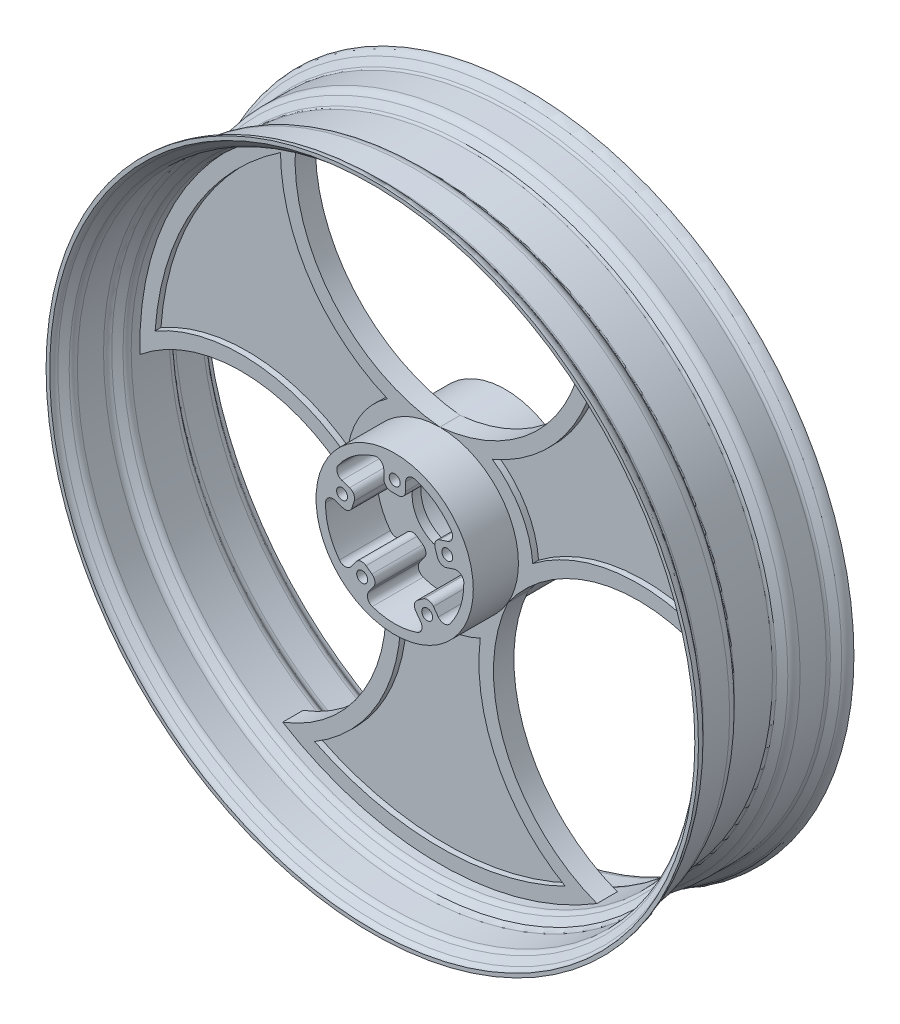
ISO-10303-21;
HEADER;
FILE_DESCRIPTION(('STEP AP214'),'2;1');
FILE_NAME('part.step','',(''),(''),'','','');
FILE_SCHEMA(('AUTOMOTIVE_DESIGN { 1 0 10303 214 1 1 1 1 }'));
ENDSEC;
DATA;
#1=APPLICATION_CONTEXT('core data for automotive mechanical design processes');
#2=APPLICATION_PROTOCOL_DEFINITION('international standard','automotive_design',2000,#1);
#3=PRODUCT_CONTEXT('',#1,'mechanical');
#4=PRODUCT('Part','Part','',(#3));
#5=PRODUCT_RELATED_PRODUCT_CATEGORY('part','',(#4));
#6=PRODUCT_DEFINITION_FORMATION('','',#4);
#7=PRODUCT_DEFINITION_CONTEXT('part definition',#1,'design');
#8=PRODUCT_DEFINITION('design','',#6,#7);
#9=PRODUCT_DEFINITION_SHAPE('','',#8);
#10=(LENGTH_UNIT() NAMED_UNIT(*) SI_UNIT(.MILLI.,.METRE.));
#11=(NAMED_UNIT(*) PLANE_ANGLE_UNIT() SI_UNIT($,.RADIAN.));
#12=(NAMED_UNIT(*) SI_UNIT($,.STERADIAN.) SOLID_ANGLE_UNIT());
#13=UNCERTAINTY_MEASURE_WITH_UNIT(LENGTH_MEASURE(1.E-05),#10,'distance_accuracy_value','');
#14=(GEOMETRIC_REPRESENTATION_CONTEXT(3) GLOBAL_UNCERTAINTY_ASSIGNED_CONTEXT((#13)) GLOBAL_UNIT_ASSIGNED_CONTEXT((#10,
#11,#12)) REPRESENTATION_CONTEXT('',''));
#15=CARTESIAN_POINT('',(0.,0.,0.));
#16=DIRECTION('',(0.,0.,1.));
#17=DIRECTION('',(1.,0.,0.));
#18=AXIS2_PLACEMENT_3D('',#15,#16,#17);
#19=CARTESIAN_POINT('',(0.,0.,-131.350288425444));
#20=DIRECTION('',(0.,0.,1.));
#21=DIRECTION('',(1.,0.,0.));
#22=AXIS2_PLACEMENT_3D('',#19,#20,#21);
#23=CYLINDRICAL_SURFACE('',#22,47.5);
#24=CARTESIAN_POINT('',(0.,0.,3.));
#25=DIRECTION('',(0.,0.,1.));
#26=DIRECTION('',(1.,0.,0.));
#27=AXIS2_PLACEMENT_3D('',#24,#25,#26);
#28=CIRCLE('',#27,47.5);
#29=CARTESIAN_POINT('',(13.9705882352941,45.3990381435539,3.));
#30=VERTEX_POINT('',#29);
#31=CARTESIAN_POINT('',(38.8599018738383,27.3158932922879,3.));
#32=VERTEX_POINT('',#31);
#33=EDGE_CURVE('E551',#30,#32,#28,.F.);
#34=ORIENTED_EDGE('',*,*,#33,.T.);
#35=DIRECTION('',(0.,0.,1.));
#36=VECTOR('',#35,1.);
#37=CARTESIAN_POINT('',(38.8599018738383,27.3158932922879,-131.350288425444));
#38=LINE('',#37,#36);
#39=CARTESIAN_POINT('',(38.8599018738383,27.3158932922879,38.));
#40=VERTEX_POINT('',#39);
#41=EDGE_CURVE('E975',#32,#40,#38,.T.);
#42=ORIENTED_EDGE('',*,*,#41,.T.);
#43=CARTESIAN_POINT('',(0.,0.,38.));
#44=DIRECTION('',(0.,0.,1.));
#45=DIRECTION('',(1.,0.,0.));
#46=AXIS2_PLACEMENT_3D('',#43,#44,#45);
#47=CIRCLE('',#46,47.5);
#48=CARTESIAN_POINT('',(13.9705882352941,45.3990381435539,38.));
#49=VERTEX_POINT('',#48);
#50=EDGE_CURVE('E1094',#40,#49,#47,.T.);
#51=ORIENTED_EDGE('',*,*,#50,.T.);
#52=DIRECTION('',(0.,0.,1.));
#53=VECTOR('',#52,1.);
#54=CARTESIAN_POINT('',(13.9705882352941,45.3990381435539,-131.350288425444));
#55=LINE('',#54,#53);
#56=EDGE_CURVE('E973',#49,#30,#55,.F.);
#57=ORIENTED_EDGE('',*,*,#56,.T.);
#58=EDGE_LOOP('',(#34,#42,#51,#57));
#59=FACE_BOUND('',#58,.T.);
#60=ADVANCED_FACE('F33',(#59),#23,.F.);
#61=CARTESIAN_POINT('',(5.28292906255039,81.7456907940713,3.));
#62=DIRECTION('',(0.,0.,1.));
#63=DIRECTION('',(1.,0.,0.));
#64=AXIS2_PLACEMENT_3D('',#61,#62,#63);
#65=PLANE('',#64);
#66=CARTESIAN_POINT('',(0.,0.,3.));
#67=DIRECTION('',(0.,0.,1.));
#68=DIRECTION('',(1.,0.,0.));
#69=AXIS2_PLACEMENT_3D('',#66,#67,#68);
#70=CIRCLE('',#69,23.);
#71=CARTESIAN_POINT('',(23.,0.,3.));
#72=VERTEX_POINT('',#71);
#73=EDGE_CURVE('E1084',#72,#72,#70,.T.);
#74=ORIENTED_EDGE('',*,*,#73,.F.);
#75=EDGE_LOOP('',(#74));
#76=FACE_BOUND('',#75,.T.);
#77=CARTESIAN_POINT('',(15.3824417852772,-44.940299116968,3.));
#78=VERTEX_POINT('',#77);
#79=CARTESIAN_POINT('',(-15.3824417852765,-44.9402991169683,3.));
#80=VERTEX_POINT('',#79);
#81=EDGE_CURVE('E1122',#78,#80,#28,.F.);
#82=ORIENTED_EDGE('',*,*,#81,.F.);
#83=CARTESIAN_POINT('',(13.763237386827,-40.2097413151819,3.));
#84=DIRECTION('',(0.,0.,1.));
#85=DIRECTION('',(1.,0.,0.));
#86=AXIS2_PLACEMENT_3D('',#83,#84,#85);
#87=CIRCLE('',#86,5.);
#88=CARTESIAN_POINT('',(17.8083223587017,-37.2708150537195,3.));
#89=VERTEX_POINT('',#88);
#90=EDGE_CURVE('E899',#78,#89,#87,.T.);
#91=ORIENTED_EDGE('',*,*,#90,.T.);
#92=DIRECTION('',(-0.58778525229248,0.809016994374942,0.));
#93=VECTOR('',#92,1.);
#94=CARTESIAN_POINT('',(11.5659301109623,-28.6788992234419,3.));
#95=LINE('',#94,#93);
#96=CARTESIAN_POINT('',(14.5048563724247,-32.7239841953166,3.));
#97=VERTEX_POINT('',#96);
#98=EDGE_CURVE('E1157',#89,#97,#95,.T.);
#99=ORIENTED_EDGE('',*,*,#98,.T.);
#100=CARTESIAN_POINT('',(18.5499413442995,-29.7850579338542,3.));
#101=DIRECTION('',(0.,0.,1.));
#102=DIRECTION('',(1.,0.,0.));
#103=AXIS2_PLACEMENT_3D('',#100,#101,#102);
#104=CIRCLE('',#103,5.);
#105=CARTESIAN_POINT('',(15.6110150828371,-25.7399729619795,3.));
#106=VERTEX_POINT('',#105);
#107=EDGE_CURVE('E1016',#97,#106,#104,.F.);
#108=ORIENTED_EDGE('',*,*,#107,.T.);
#109=DIRECTION('',(0.809016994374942,0.58778525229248,0.));
#110=VECTOR('',#109,1.);
#111=CARTESIAN_POINT('',(23.7011850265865,-19.8621204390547,3.));
#112=LINE('',#111,#110);
#113=CARTESIAN_POINT('',(19.6561000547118,-22.8010467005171,3.));
#114=VERTEX_POINT('',#113);
#115=EDGE_CURVE('E2233',#106,#114,#112,.T.);
#116=ORIENTED_EDGE('',*,*,#115,.T.);
#117=CARTESIAN_POINT('',(22.5950263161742,-26.8461316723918,3.));
#118=DIRECTION('',(0.,0.,1.));
#119=DIRECTION('',(1.,0.,0.));
#120=AXIS2_PLACEMENT_3D('',#117,#118,#119);
#121=CIRCLE('',#120,5.);
#122=CARTESIAN_POINT('',(26.6401112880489,-23.9072054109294,3.));
#123=VERTEX_POINT('',#122);
#124=EDGE_CURVE('E1020',#114,#123,#121,.F.);
#125=ORIENTED_EDGE('',*,*,#124,.T.);
#126=DIRECTION('',(-0.58778525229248,0.809016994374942,0.));
#127=VECTOR('',#126,1.);
#128=CARTESIAN_POINT('',(23.7011850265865,-19.8621204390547,3.));
#129=LINE('',#128,#127);
#130=CARTESIAN_POINT('',(29.9435772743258,-28.4540362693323,3.));
#131=VERTEX_POINT('',#130);
#132=EDGE_CURVE('E2230',#131,#123,#129,.T.);
#133=ORIENTED_EDGE('',*,*,#132,.F.);
#134=CARTESIAN_POINT('',(33.9886622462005,-25.5151100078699,3.));
#135=DIRECTION('',(0.,0.,1.));
#136=DIRECTION('',(1.,0.,0.));
#137=AXIS2_PLACEMENT_3D('',#134,#135,#136);
#138=CIRCLE('',#137,5.);
#139=CARTESIAN_POINT('',(37.9873283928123,-28.5168876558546,3.));
#140=VERTEX_POINT('',#139);
#141=EDGE_CURVE('E891',#131,#140,#138,.T.);
#142=ORIENTED_EDGE('',*,*,#141,.T.);
#143=CARTESIAN_POINT('',(47.4942002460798,0.742255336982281,3.));
#144=VERTEX_POINT('',#143);
#145=EDGE_CURVE('E519',#144,#140,#28,.F.);
#146=ORIENTED_EDGE('',*,*,#145,.F.);
#147=CARTESIAN_POINT('',(42.4948107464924,0.664123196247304,3.));
#148=DIRECTION('',(0.,0.,1.));
#149=DIRECTION('',(1.,0.,0.));
#150=AXIS2_PLACEMENT_3D('',#147,#148,#149);
#151=CIRCLE('',#150,5.);
#152=CARTESIAN_POINT('',(40.9497257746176,5.41940577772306,3.));
#153=VERTEX_POINT('',#152);
#154=EDGE_CURVE('E885',#144,#153,#151,.T.);
#155=ORIENTED_EDGE('',*,*,#154,.T.);
#156=DIRECTION('',(-0.95105651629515,-0.309016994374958,0.));
#157=VECTOR('',#156,1.);
#158=CARTESIAN_POINT('',(30.8493229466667,2.13758595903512,3.));
#159=LINE('',#158,#157);
#160=CARTESIAN_POINT('',(35.6046055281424,3.68267093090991,3.));
#161=VERTEX_POINT('',#160);
#162=EDGE_CURVE('E2258',#153,#161,#159,.T.);
#163=ORIENTED_EDGE('',*,*,#162,.T.);
#164=CARTESIAN_POINT('',(34.0595205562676,8.43795351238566,3.));
#165=DIRECTION('',(0.,0.,1.));
#166=DIRECTION('',(1.,0.,0.));
#167=AXIS2_PLACEMENT_3D('',#164,#165,#166);
#168=CIRCLE('',#167,5.);
#169=CARTESIAN_POINT('',(29.3042379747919,6.89286854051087,3.));
#170=VERTEX_POINT('',#169);
#171=EDGE_CURVE('E1036',#161,#170,#168,.F.);
#172=ORIENTED_EDGE('',*,*,#171,.T.);
#173=DIRECTION('',(-0.309016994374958,0.95105651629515,0.));
#174=VECTOR('',#173,1.);
#175=CARTESIAN_POINT('',(26.2140680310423,16.4034337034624,3.));
#176=LINE('',#175,#174);
#177=CARTESIAN_POINT('',(27.7591530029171,11.6481511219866,3.));
#178=VERTEX_POINT('',#177);
#179=EDGE_CURVE('E2261',#170,#178,#176,.T.);
#180=ORIENTED_EDGE('',*,*,#179,.T.);
#181=CARTESIAN_POINT('',(32.5144355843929,13.1932360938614,3.));
#182=DIRECTION('',(0.,0.,1.));
#183=DIRECTION('',(1.,0.,0.));
#184=AXIS2_PLACEMENT_3D('',#181,#182,#183);
#185=CIRCLE('',#184,5.);
#186=CARTESIAN_POINT('',(30.9693506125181,17.9485186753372,3.));
#187=VERTEX_POINT('',#186);
#188=EDGE_CURVE('E1038',#178,#187,#185,.F.);
#189=ORIENTED_EDGE('',*,*,#188,.T.);
#190=DIRECTION('',(-0.95105651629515,-0.309016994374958,0.));
#191=VECTOR('',#190,1.);
#192=CARTESIAN_POINT('',(26.2140680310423,16.4034337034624,3.));
#193=LINE('',#192,#191);
#194=CARTESIAN_POINT('',(36.3144708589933,19.6852535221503,3.));
#195=VERTEX_POINT('',#194);
#196=EDGE_CURVE('E2266',#195,#187,#193,.T.);
#197=ORIENTED_EDGE('',*,*,#196,.F.);
#198=CARTESIAN_POINT('',(34.7693858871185,24.4405361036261,3.));
#199=DIRECTION('',(0.,0.,1.));
#200=DIRECTION('',(1.,0.,0.));
#201=AXIS2_PLACEMENT_3D('',#198,#199,#200);
#202=CIRCLE('',#201,5.);
#203=EDGE_CURVE('E887',#195,#32,#202,.T.);
#204=ORIENTED_EDGE('',*,*,#203,.T.);
#205=ORIENTED_EDGE('',*,*,#33,.F.);
#206=CARTESIAN_POINT('',(12.5,40.6201920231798,3.));
#207=DIRECTION('',(0.,0.,1.));
#208=DIRECTION('',(1.,0.,0.));
#209=AXIS2_PLACEMENT_3D('',#206,#207,#208);
#210=CIRCLE('',#209,5.);
#211=CARTESIAN_POINT('',(7.5,40.6201920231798,3.));
#212=VERTEX_POINT('',#211);
#213=EDGE_CURVE('E881',#30,#212,#210,.T.);
#214=ORIENTED_EDGE('',*,*,#213,.T.);
#215=DIRECTION('',(0.,-1.,0.));
#216=VECTOR('',#215,1.);
#217=CARTESIAN_POINT('',(7.5,30.,3.));
#218=LINE('',#217,#216);
#219=CARTESIAN_POINT('',(7.5,35.,3.));
#220=VERTEX_POINT('',#219);
#221=EDGE_CURVE('E1053',#212,#220,#218,.T.);
#222=ORIENTED_EDGE('',*,*,#221,.T.);
#223=CARTESIAN_POINT('',(2.5,35.,3.));
#224=DIRECTION('',(0.,0.,1.));
#225=DIRECTION('',(1.,0.,0.));
#226=AXIS2_PLACEMENT_3D('',#223,#224,#225);
#227=CIRCLE('',#226,5.);
#228=CARTESIAN_POINT('',(2.5,30.,3.));
#229=VERTEX_POINT('',#228);
#230=EDGE_CURVE('E41',#220,#229,#227,.F.);
#231=ORIENTED_EDGE('',*,*,#230,.T.);
#232=DIRECTION('',(-1.,0.,0.));
#233=VECTOR('',#232,1.);
#234=CARTESIAN_POINT('',(-7.5,30.,3.));
#235=LINE('',#234,#233);
#236=CARTESIAN_POINT('',(-2.5,30.,3.));
#237=VERTEX_POINT('',#236);
#238=EDGE_CURVE('E1050',#229,#237,#235,.T.);
#239=ORIENTED_EDGE('',*,*,#238,.T.);
#240=CARTESIAN_POINT('',(-2.5,35.,3.));
#241=DIRECTION('',(0.,0.,1.));
#242=DIRECTION('',(1.,0.,0.));
#243=AXIS2_PLACEMENT_3D('',#240,#241,#242);
#244=CIRCLE('',#243,5.);
#245=CARTESIAN_POINT('',(-7.5,35.,3.));
#246=VERTEX_POINT('',#245);
#247=EDGE_CURVE('E1040',#237,#246,#244,.F.);
#248=ORIENTED_EDGE('',*,*,#247,.T.);
#249=DIRECTION('',(0.,-1.,0.));
#250=VECTOR('',#249,1.);
#251=CARTESIAN_POINT('',(-7.5,30.,3.));
#252=LINE('',#251,#250);
#253=CARTESIAN_POINT('',(-7.5,40.6201920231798,3.));
#254=VERTEX_POINT('',#253);
#255=EDGE_CURVE('E1062',#254,#246,#252,.T.);
#256=ORIENTED_EDGE('',*,*,#255,.F.);
#257=CARTESIAN_POINT('',(-12.5,40.6201920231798,3.));
#258=DIRECTION('',(0.,0.,1.));
#259=DIRECTION('',(1.,0.,0.));
#260=AXIS2_PLACEMENT_3D('',#257,#258,#259);
#261=CIRCLE('',#260,5.);
#262=CARTESIAN_POINT('',(-13.9705882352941,45.3990381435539,3.));
#263=VERTEX_POINT('',#262);
#264=EDGE_CURVE('E883',#254,#263,#261,.T.);
#265=ORIENTED_EDGE('',*,*,#264,.T.);
#266=CARTESIAN_POINT('',(-38.8599018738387,27.3158932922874,3.));
#267=VERTEX_POINT('',#266);
#268=EDGE_CURVE('E1113',#267,#263,#28,.F.);
#269=ORIENTED_EDGE('',*,*,#268,.F.);
#270=CARTESIAN_POINT('',(-34.7693858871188,24.4405361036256,3.));
#271=DIRECTION('',(0.,0.,1.));
#272=DIRECTION('',(1.,0.,0.));
#273=AXIS2_PLACEMENT_3D('',#270,#271,#272);
#274=CIRCLE('',#273,5.);
#275=CARTESIAN_POINT('',(-36.3144708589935,19.6852535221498,3.));
#276=VERTEX_POINT('',#275);
#277=EDGE_CURVE('E895',#267,#276,#274,.T.);
#278=ORIENTED_EDGE('',*,*,#277,.T.);
#279=DIRECTION('',(0.951056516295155,-0.309016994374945,0.));
#280=VECTOR('',#279,1.);
#281=CARTESIAN_POINT('',(-26.2140680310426,16.403433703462,3.));
#282=LINE('',#281,#280);
#283=CARTESIAN_POINT('',(-30.9693506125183,17.9485186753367,3.));
#284=VERTEX_POINT('',#283);
#285=EDGE_CURVE('E1178',#276,#284,#282,.T.);
#286=ORIENTED_EDGE('',*,*,#285,.T.);
#287=CARTESIAN_POINT('',(-32.514435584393,13.193236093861,3.));
#288=DIRECTION('',(0.,0.,1.));
#289=DIRECTION('',(1.,0.,0.));
#290=AXIS2_PLACEMENT_3D('',#287,#288,#289);
#291=CIRCLE('',#290,5.);
#292=CARTESIAN_POINT('',(-27.7591530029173,11.6481511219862,3.));
#293=VERTEX_POINT('',#292);
#294=EDGE_CURVE('E1030',#284,#293,#291,.F.);
#295=ORIENTED_EDGE('',*,*,#294,.T.);
#296=DIRECTION('',(-0.309016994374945,-0.951056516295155,0.));
#297=VECTOR('',#296,1.);
#298=CARTESIAN_POINT('',(-30.8493229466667,2.13758595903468,3.));
#299=LINE('',#298,#297);
#300=CARTESIAN_POINT('',(-29.304237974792,6.89286854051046,3.));
#301=VERTEX_POINT('',#300);
#302=EDGE_CURVE('E1175',#293,#301,#299,.T.);
#303=ORIENTED_EDGE('',*,*,#302,.T.);
#304=CARTESIAN_POINT('',(-34.0595205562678,8.43795351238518,3.));
#305=DIRECTION('',(0.,0.,1.));
#306=DIRECTION('',(1.,0.,0.));
#307=AXIS2_PLACEMENT_3D('',#304,#305,#306);
#308=CIRCLE('',#307,5.);
#309=CARTESIAN_POINT('',(-35.6046055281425,3.68267093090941,3.));
#310=VERTEX_POINT('',#309);
#311=EDGE_CURVE('E1028',#301,#310,#308,.F.);
#312=ORIENTED_EDGE('',*,*,#311,.T.);
#313=DIRECTION('',(0.951056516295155,-0.309016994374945,0.));
#314=VECTOR('',#313,1.);
#315=CARTESIAN_POINT('',(-30.8493229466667,2.13758595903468,3.));
#316=LINE('',#315,#314);
#317=CARTESIAN_POINT('',(-40.9497257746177,5.41940577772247,3.));
#318=VERTEX_POINT('',#317);
#319=EDGE_CURVE('E1171',#318,#310,#316,.T.);
#320=ORIENTED_EDGE('',*,*,#319,.F.);
#321=CARTESIAN_POINT('',(-42.4948107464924,0.664123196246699,3.));
#322=DIRECTION('',(0.,0.,1.));
#323=DIRECTION('',(1.,0.,0.));
#324=AXIS2_PLACEMENT_3D('',#321,#322,#323);
#325=CIRCLE('',#324,5.);
#326=CARTESIAN_POINT('',(-47.4942002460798,0.742255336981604,3.));
#327=VERTEX_POINT('',#326);
#328=EDGE_CURVE('E889',#318,#327,#325,.T.);
#329=ORIENTED_EDGE('',*,*,#328,.T.);
#330=CARTESIAN_POINT('',(-37.9873283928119,-28.5168876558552,3.));
#331=VERTEX_POINT('',#330);
#332=EDGE_CURVE('E1118',#331,#327,#28,.F.);
#333=ORIENTED_EDGE('',*,*,#332,.F.);
#334=CARTESIAN_POINT('',(-33.9886622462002,-25.5151100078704,3.));
#335=DIRECTION('',(0.,0.,1.));
#336=DIRECTION('',(1.,0.,0.));
#337=AXIS2_PLACEMENT_3D('',#334,#335,#336);
#338=CIRCLE('',#337,5.);
#339=CARTESIAN_POINT('',(-29.9435772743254,-28.4540362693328,3.));
#340=VERTEX_POINT('',#339);
#341=EDGE_CURVE('E893',#331,#340,#338,.T.);
#342=ORIENTED_EDGE('',*,*,#341,.T.);
#343=DIRECTION('',(0.587785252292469,0.809016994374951,0.));
#344=VECTOR('',#343,1.);
#345=CARTESIAN_POINT('',(-23.7011850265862,-19.862120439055,3.));
#346=LINE('',#345,#344);
#347=CARTESIAN_POINT('',(-26.6401112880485,-23.9072054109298,3.));
#348=VERTEX_POINT('',#347);
#349=EDGE_CURVE('E1161',#340,#348,#346,.T.);
#350=ORIENTED_EDGE('',*,*,#349,.T.);
#351=CARTESIAN_POINT('',(-22.5950263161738,-26.8461316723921,3.));
#352=DIRECTION('',(0.,0.,1.));
#353=DIRECTION('',(1.,0.,0.));
#354=AXIS2_PLACEMENT_3D('',#351,#352,#353);
#355=CIRCLE('',#354,5.);
#356=CARTESIAN_POINT('',(-19.6561000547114,-22.8010467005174,3.));
#357=VERTEX_POINT('',#356);
#358=EDGE_CURVE('E1022',#348,#357,#355,.F.);
#359=ORIENTED_EDGE('',*,*,#358,.T.);
#360=DIRECTION('',(0.809016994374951,-0.587785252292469,0.));
#361=VECTOR('',#360,1.);
#362=CARTESIAN_POINT('',(-11.5659301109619,-28.678899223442,3.));
#363=LINE('',#362,#361);
#364=CARTESIAN_POINT('',(-15.6110150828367,-25.7399729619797,3.));
#365=VERTEX_POINT('',#364);
#366=EDGE_CURVE('E1149',#357,#365,#363,.T.);
#367=ORIENTED_EDGE('',*,*,#366,.T.);
#368=CARTESIAN_POINT('',(-18.549941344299,-29.7850579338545,3.));
#369=DIRECTION('',(0.,0.,1.));
#370=DIRECTION('',(1.,0.,0.));
#371=AXIS2_PLACEMENT_3D('',#368,#369,#370);
#372=CIRCLE('',#371,5.);
#373=CARTESIAN_POINT('',(-14.5048563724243,-32.7239841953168,3.));
#374=VERTEX_POINT('',#373);
#375=EDGE_CURVE('E1024',#365,#374,#372,.F.);
#376=ORIENTED_EDGE('',*,*,#375,.T.);
#377=DIRECTION('',(0.587785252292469,0.809016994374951,0.));
#378=VECTOR('',#377,1.);
#379=CARTESIAN_POINT('',(-11.5659301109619,-28.678899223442,3.));
#380=LINE('',#379,#378);
#381=CARTESIAN_POINT('',(-17.8083223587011,-37.2708150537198,3.));
#382=VERTEX_POINT('',#381);
#383=EDGE_CURVE('E1146',#382,#374,#380,.T.);
#384=ORIENTED_EDGE('',*,*,#383,.F.);
#385=CARTESIAN_POINT('',(-13.7632373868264,-40.2097413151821,3.));
#386=DIRECTION('',(0.,0.,1.));
#387=DIRECTION('',(1.,0.,0.));
#388=AXIS2_PLACEMENT_3D('',#385,#386,#387);
#389=CIRCLE('',#388,5.);
#390=EDGE_CURVE('E897',#382,#80,#389,.T.);
#391=ORIENTED_EDGE('',*,*,#390,.T.);
#392=EDGE_LOOP('',(#82,#91,#99,#108,#116,#125,#133,#142,#146,#155,#163,#172,#180,#189,#197,#204,
#205,#214,#222,#231,#239,#248,#256,#265,#269,#278,#286,#295,#303,#312,#320,#329,#333,#342,#350,
#359,#367,#376,#384,#391));
#393=FACE_BOUND('',#392,.T.);
#394=ADVANCED_FACE('F1049',(#76,#393),#65,.T.);
#395=ORIENTED_EDGE('',*,*,#145,.T.);
#396=DIRECTION('',(0.,0.,1.));
#397=VECTOR('',#396,1.);
#398=CARTESIAN_POINT('',(37.9873283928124,-28.5168876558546,-131.350288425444));
#399=LINE('',#398,#397);
#400=CARTESIAN_POINT('',(37.9873283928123,-28.5168876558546,38.));
#401=VERTEX_POINT('',#400);
#402=EDGE_CURVE('E951',#140,#401,#399,.T.);
#403=ORIENTED_EDGE('',*,*,#402,.T.);
#404=CARTESIAN_POINT('',(47.4942002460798,0.742255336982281,38.));
#405=VERTEX_POINT('',#404);
#406=EDGE_CURVE('E1095',#401,#405,#47,.T.);
#407=ORIENTED_EDGE('',*,*,#406,.T.);
#408=DIRECTION('',(0.,0.,1.));
#409=VECTOR('',#408,1.);
#410=CARTESIAN_POINT('',(47.4942002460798,0.742255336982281,-131.350288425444));
#411=LINE('',#410,#409);
#412=EDGE_CURVE('E949',#405,#144,#411,.F.);
#413=ORIENTED_EDGE('',*,*,#412,.T.);
#414=EDGE_LOOP('',(#395,#403,#407,#413));
#415=FACE_BOUND('',#414,.T.);
#416=ADVANCED_FACE('F1256',(#415),#23,.F.);
#417=CARTESIAN_POINT('',(-15.3824417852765,-44.9402991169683,38.));
#418=VERTEX_POINT('',#417);
#419=CARTESIAN_POINT('',(15.3824417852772,-44.940299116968,38.));
#420=VERTEX_POINT('',#419);
#421=EDGE_CURVE('E1097',#418,#420,#47,.T.);
#422=ORIENTED_EDGE('',*,*,#421,.T.);
#423=DIRECTION('',(0.,0.,1.));
#424=VECTOR('',#423,1.);
#425=CARTESIAN_POINT('',(15.3824417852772,-44.940299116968,-131.350288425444));
#426=LINE('',#425,#424);
#427=EDGE_CURVE('E879',#420,#78,#426,.F.);
#428=ORIENTED_EDGE('',*,*,#427,.T.);
#429=ORIENTED_EDGE('',*,*,#81,.T.);
#430=DIRECTION('',(0.,0.,1.));
#431=VECTOR('',#430,1.);
#432=CARTESIAN_POINT('',(-15.3824417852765,-44.9402991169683,-131.350288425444));
#433=LINE('',#432,#431);
#434=EDGE_CURVE('E876',#80,#418,#433,.T.);
#435=ORIENTED_EDGE('',*,*,#434,.T.);
#436=EDGE_LOOP('',(#422,#428,#429,#435));
#437=FACE_BOUND('',#436,.T.);
#438=ADVANCED_FACE('F1130',(#437),#23,.F.);
#439=CARTESIAN_POINT('',(-47.4942002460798,0.742255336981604,38.));
#440=VERTEX_POINT('',#439);
#441=CARTESIAN_POINT('',(-37.9873283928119,-28.5168876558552,38.));
#442=VERTEX_POINT('',#441);
#443=EDGE_CURVE('E1102',#440,#442,#47,.T.);
#444=ORIENTED_EDGE('',*,*,#443,.T.);
#445=DIRECTION('',(0.,0.,1.));
#446=VECTOR('',#445,1.);
#447=CARTESIAN_POINT('',(-37.9873283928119,-28.5168876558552,-131.350288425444));
#448=LINE('',#447,#446);
#449=EDGE_CURVE('E924',#442,#331,#448,.F.);
#450=ORIENTED_EDGE('',*,*,#449,.T.);
#451=ORIENTED_EDGE('',*,*,#332,.T.);
#452=DIRECTION('',(0.,0.,1.));
#453=VECTOR('',#452,1.);
#454=CARTESIAN_POINT('',(-47.4942002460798,0.742255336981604,-131.350288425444));
#455=LINE('',#454,#453);
#456=EDGE_CURVE('E921',#327,#440,#455,.T.);
#457=ORIENTED_EDGE('',*,*,#456,.T.);
#458=EDGE_LOOP('',(#444,#450,#451,#457));
#459=FACE_BOUND('',#458,.T.);
#460=ADVANCED_FACE('F1224',(#459),#23,.F.);
#461=CARTESIAN_POINT('',(-13.9705882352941,45.3990381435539,38.));
#462=VERTEX_POINT('',#461);
#463=CARTESIAN_POINT('',(-38.8599018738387,27.3158932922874,38.));
#464=VERTEX_POINT('',#463);
#465=EDGE_CURVE('E1103',#462,#464,#47,.T.);
#466=ORIENTED_EDGE('',*,*,#465,.T.);
#467=DIRECTION('',(0.,0.,1.));
#468=VECTOR('',#467,1.);
#469=CARTESIAN_POINT('',(-38.8599018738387,27.3158932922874,-131.350288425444));
#470=LINE('',#469,#468);
#471=EDGE_CURVE('E914',#464,#267,#470,.F.);
#472=ORIENTED_EDGE('',*,*,#471,.T.);
#473=ORIENTED_EDGE('',*,*,#268,.T.);
#474=DIRECTION('',(0.,0.,1.));
#475=VECTOR('',#474,1.);
#476=CARTESIAN_POINT('',(-13.9705882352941,45.3990381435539,-131.350288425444));
#477=LINE('',#476,#475);
#478=EDGE_CURVE('E911',#263,#462,#477,.T.);
#479=ORIENTED_EDGE('',*,*,#478,.T.);
#480=EDGE_LOOP('',(#466,#472,#473,#479));
#481=FACE_BOUND('',#480,.T.);
#482=ADVANCED_FACE('F1257',(#481),#23,.F.);
#483=CARTESIAN_POINT('',(0.,206.,-7.));
#484=DIRECTION('',(0.,0.,1.));
#485=DIRECTION('',(1.,0.,0.));
#486=AXIS2_PLACEMENT_3D('',#483,#484,#485);
#487=PLANE('',#486);
#488=CARTESIAN_POINT('',(-146.870618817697,-72.5953892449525,-7.));
#489=DIRECTION('',(0.,0.,1.));
#490=DIRECTION('',(1.,0.,0.));
#491=AXIS2_PLACEMENT_3D('',#488,#489,#490);
#492=CIRCLE('',#491,110.);
#493=CARTESIAN_POINT('',(-107.920361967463,-175.468502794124,-6.99999999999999));
#494=VERTEX_POINT('',#493);
#495=CARTESIAN_POINT('',(-46.7653718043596,-27.0000000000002,-7.00000000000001));
#496=VERTEX_POINT('',#495);
#497=EDGE_CURVE('E694',#494,#496,#492,.T.);
#498=ORIENTED_EDGE('',*,*,#497,.T.);
#499=CARTESIAN_POINT('',(0.,0.,-7.00000000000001));
#500=DIRECTION('',(0.,0.,1.));
#501=DIRECTION('',(1.,0.,0.));
#502=AXIS2_PLACEMENT_3D('',#499,#500,#501);
#503=CIRCLE('',#502,54.);
#504=CARTESIAN_POINT('',(46.7653718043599,-26.9999999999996,-7.00000000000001));
#505=VERTEX_POINT('',#504);
#506=EDGE_CURVE('E760',#496,#505,#503,.T.);
#507=ORIENTED_EDGE('',*,*,#506,.T.);
#508=CARTESIAN_POINT('',(146.870618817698,-72.5953892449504,-7.));
#509=DIRECTION('',(0.,0.,1.));
#510=DIRECTION('',(1.,0.,0.));
#511=AXIS2_PLACEMENT_3D('',#508,#509,#510);
#512=CIRCLE('',#511,110.);
#513=CARTESIAN_POINT('',(107.920361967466,-175.468502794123,-6.99999999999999));
#514=VERTEX_POINT('',#513);
#515=EDGE_CURVE('E716',#514,#505,#512,.F.);
#516=ORIENTED_EDGE('',*,*,#515,.F.);
#517=CARTESIAN_POINT('',(0.,0.,-6.99999999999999));
#518=DIRECTION('',(0.,0.,1.));
#519=DIRECTION('',(1.,0.,0.));
#520=AXIS2_PLACEMENT_3D('',#517,#518,#519);
#521=CIRCLE('',#520,206.);
#522=EDGE_CURVE('E765',#494,#514,#521,.T.);
#523=ORIENTED_EDGE('',*,*,#522,.F.);
#524=EDGE_LOOP('',(#498,#507,#516,#523));
#525=FACE_BOUND('',#524,.T.);
#526=CARTESIAN_POINT('',(-146.870618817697,-72.5953892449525,-7.));
#527=DIRECTION('',(0.,0.,-1.));
#528=DIRECTION('',(-0.500000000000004,0.866025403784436,0.));
#529=AXIS2_PLACEMENT_3D('',#526,#527,#528);
#530=CIRCLE('',#529,120.);
#531=CARTESIAN_POINT('',(-27.8056809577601,-57.644115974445,-7.));
#532=VERTEX_POINT('',#531);
#533=CARTESIAN_POINT('',(-86.1059434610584,-176.073185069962,-7.));
#534=VERTEX_POINT('',#533);
#535=EDGE_CURVE('E509',#532,#534,#530,.T.);
#536=ORIENTED_EDGE('',*,*,#535,.T.);
#537=CARTESIAN_POINT('',(0.,0.,-7.));
#538=DIRECTION('',(0.,0.,1.));
#539=DIRECTION('',(-0.500000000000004,0.866025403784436,0.));
#540=AXIS2_PLACEMENT_3D('',#537,#538,#539);
#541=CIRCLE('',#540,196.);
#542=CARTESIAN_POINT('',(86.1059434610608,-176.073185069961,-7.));
#543=VERTEX_POINT('',#542);
#544=EDGE_CURVE('E513',#534,#543,#541,.T.);
#545=ORIENTED_EDGE('',*,*,#544,.T.);
#546=CARTESIAN_POINT('',(146.870618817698,-72.5953892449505,-7.));
#547=DIRECTION('',(0.,0.,-1.));
#548=DIRECTION('',(-0.500000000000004,0.866025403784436,0.));
#549=AXIS2_PLACEMENT_3D('',#546,#547,#548);
#550=CIRCLE('',#549,120.);
#551=CARTESIAN_POINT('',(27.805680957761,-57.6441159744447,-7.));
#552=VERTEX_POINT('',#551);
#553=EDGE_CURVE('E516',#543,#552,#550,.T.);
#554=ORIENTED_EDGE('',*,*,#553,.T.);
#555=CARTESIAN_POINT('',(0.,0.,-7.));
#556=DIRECTION('',(0.,0.,-1.));
#557=DIRECTION('',(-0.500000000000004,0.866025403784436,0.));
#558=AXIS2_PLACEMENT_3D('',#555,#556,#557);
#559=CIRCLE('',#558,64.0000000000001);
#560=EDGE_CURVE('E525',#552,#532,#559,.T.);
#561=ORIENTED_EDGE('',*,*,#560,.T.);
#562=EDGE_LOOP('',(#536,#545,#554,#561));
#563=FACE_BOUND('',#562,.T.);
#564=ADVANCED_FACE('F1266',(#525,#563),#487,.F.);
#565=CARTESIAN_POINT('',(136.304760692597,-90.8959923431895,-7.));
#566=DIRECTION('',(0.,0.,1.));
#567=DIRECTION('',(1.,0.,0.));
#568=AXIS2_PLACEMENT_3D('',#565,#566,#567);
#569=CIRCLE('',#568,110.);
#570=CARTESIAN_POINT('',(205.920361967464,-5.72752365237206,-6.99999999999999));
#571=VERTEX_POINT('',#570);
#572=EDGE_CURVE('E687',#571,#505,#569,.T.);
#573=ORIENTED_EDGE('',*,*,#572,.T.);
#574=CARTESIAN_POINT('',(0.,54.,-7.));
#575=VERTEX_POINT('',#574);
#576=EDGE_CURVE('E755',#505,#575,#503,.T.);
#577=ORIENTED_EDGE('',*,*,#576,.T.);
#578=CARTESIAN_POINT('',(-10.5658581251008,163.491381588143,-7.));
#579=DIRECTION('',(0.,0.,1.));
#580=DIRECTION('',(1.,0.,0.));
#581=AXIS2_PLACEMENT_3D('',#578,#579,#580);
#582=CIRCLE('',#581,110.);
#583=CARTESIAN_POINT('',(98.,181.196026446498,-6.99999999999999));
#584=VERTEX_POINT('',#583);
#585=EDGE_CURVE('E732',#584,#575,#582,.F.);
#586=ORIENTED_EDGE('',*,*,#585,.F.);
#587=EDGE_CURVE('E759',#571,#584,#521,.T.);
#588=ORIENTED_EDGE('',*,*,#587,.F.);
#589=EDGE_LOOP('',(#573,#577,#586,#588));
#590=FACE_BOUND('',#589,.T.);
#591=CARTESIAN_POINT('',(136.304760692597,-90.8959923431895,-7.));
#592=DIRECTION('',(0.,0.,-1.));
#593=DIRECTION('',(-0.499999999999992,-0.866025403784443,0.));
#594=AXIS2_PLACEMENT_3D('',#591,#592,#593);
#595=CIRCLE('',#594,120.);
#596=CARTESIAN_POINT('',(63.8241092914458,4.7416319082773,-7.));
#597=VERTEX_POINT('',#596);
#598=CARTESIAN_POINT('',(195.536822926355,13.4666580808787,-7.));
#599=VERTEX_POINT('',#598);
#600=EDGE_CURVE('E547',#597,#599,#595,.T.);
#601=ORIENTED_EDGE('',*,*,#600,.T.);
#602=CARTESIAN_POINT('',(0.,0.,-7.));
#603=DIRECTION('',(0.,0.,1.));
#604=DIRECTION('',(-0.499999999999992,-0.866025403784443,0.));
#605=AXIS2_PLACEMENT_3D('',#602,#603,#604);
#606=CIRCLE('',#605,196.);
#607=CARTESIAN_POINT('',(109.430879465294,162.606526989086,-7.));
#608=VERTEX_POINT('',#607);
#609=EDGE_CURVE('E540',#599,#608,#606,.T.);
#610=ORIENTED_EDGE('',*,*,#609,.T.);
#611=CARTESIAN_POINT('',(-10.565858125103,163.491381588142,-7.));
#612=DIRECTION('',(0.,0.,-1.));
#613=DIRECTION('',(-0.499999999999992,-0.866025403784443,0.));
#614=AXIS2_PLACEMENT_3D('',#611,#612,#613);
#615=CIRCLE('',#614,120.);
#616=CARTESIAN_POINT('',(36.0184283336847,52.9024840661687,-7.));
#617=VERTEX_POINT('',#616);
#618=EDGE_CURVE('E554',#608,#617,#615,.T.);
#619=ORIENTED_EDGE('',*,*,#618,.T.);
#620=CARTESIAN_POINT('',(0.,0.,-7.));
#621=DIRECTION('',(0.,0.,-1.));
#622=DIRECTION('',(-0.499999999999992,-0.866025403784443,0.));
#623=AXIS2_PLACEMENT_3D('',#620,#621,#622);
#624=CIRCLE('',#623,64.0000000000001);
#625=EDGE_CURVE('E550',#617,#597,#624,.T.);
#626=ORIENTED_EDGE('',*,*,#625,.T.);
#627=EDGE_LOOP('',(#601,#610,#619,#626));
#628=FACE_BOUND('',#627,.T.);
#629=ADVANCED_FACE('F1271',(#590,#628),#487,.F.);
#630=EDGE_CURVE('E756',#575,#496,#503,.T.);
#631=ORIENTED_EDGE('',*,*,#630,.T.);
#632=CARTESIAN_POINT('',(-136.304760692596,-90.8959923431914,-7.));
#633=DIRECTION('',(0.,0.,1.));
#634=DIRECTION('',(1.,0.,0.));
#635=AXIS2_PLACEMENT_3D('',#632,#633,#634);
#636=CIRCLE('',#635,110.);
#637=CARTESIAN_POINT('',(-205.920361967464,-5.72752365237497,-6.99999999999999));
#638=VERTEX_POINT('',#637);
#639=EDGE_CURVE('E697',#638,#496,#636,.F.);
#640=ORIENTED_EDGE('',*,*,#639,.F.);
#641=CARTESIAN_POINT('',(-98.,181.196026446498,-7.));
#642=VERTEX_POINT('',#641);
#643=EDGE_CURVE('E761',#642,#638,#521,.T.);
#644=ORIENTED_EDGE('',*,*,#643,.F.);
#645=CARTESIAN_POINT('',(10.5658581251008,163.491381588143,-7.));
#646=DIRECTION('',(0.,0.,1.));
#647=DIRECTION('',(1.,0.,0.));
#648=AXIS2_PLACEMENT_3D('',#645,#646,#647);
#649=CIRCLE('',#648,110.);
#650=EDGE_CURVE('E709',#642,#575,#649,.T.);
#651=ORIENTED_EDGE('',*,*,#650,.T.);
#652=EDGE_LOOP('',(#631,#640,#644,#651));
#653=FACE_BOUND('',#652,.T.);
#654=CARTESIAN_POINT('',(10.5658581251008,163.491381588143,-7.));
#655=DIRECTION('',(0.,0.,-1.));
#656=DIRECTION('',(1.,0.,0.));
#657=AXIS2_PLACEMENT_3D('',#654,#655,#656);
#658=CIRCLE('',#657,120.);
#659=CARTESIAN_POINT('',(-36.0184283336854,52.9024840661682,-7.));
#660=VERTEX_POINT('',#659);
#661=CARTESIAN_POINT('',(-109.430879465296,162.606526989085,-7.));
#662=VERTEX_POINT('',#661);
#663=EDGE_CURVE('E532',#660,#662,#658,.T.);
#664=ORIENTED_EDGE('',*,*,#663,.T.);
#665=CARTESIAN_POINT('',(0.,0.,-7.));
#666=DIRECTION('',(0.,0.,1.));
#667=DIRECTION('',(1.,0.,0.));
#668=AXIS2_PLACEMENT_3D('',#665,#666,#667);
#669=CIRCLE('',#668,196.);
#670=CARTESIAN_POINT('',(-195.536822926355,13.466658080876,-7.));
#671=VERTEX_POINT('',#670);
#672=EDGE_CURVE('E571',#662,#671,#669,.T.);
#673=ORIENTED_EDGE('',*,*,#672,.T.);
#674=CARTESIAN_POINT('',(-136.304760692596,-90.8959923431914,-7.));
#675=DIRECTION('',(0.,0.,-1.));
#676=DIRECTION('',(1.,0.,0.));
#677=AXIS2_PLACEMENT_3D('',#674,#675,#676);
#678=CIRCLE('',#677,120.);
#679=CARTESIAN_POINT('',(-63.8241092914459,4.74163190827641,-7.));
#680=VERTEX_POINT('',#679);
#681=EDGE_CURVE('E583',#671,#680,#678,.T.);
#682=ORIENTED_EDGE('',*,*,#681,.T.);
#683=CARTESIAN_POINT('',(0.,0.,-7.));
#684=DIRECTION('',(0.,0.,-1.));
#685=DIRECTION('',(1.,0.,0.));
#686=AXIS2_PLACEMENT_3D('',#683,#684,#685);
#687=CIRCLE('',#686,64.0000000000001);
#688=EDGE_CURVE('E580',#680,#660,#687,.T.);
#689=ORIENTED_EDGE('',*,*,#688,.T.);
#690=EDGE_LOOP('',(#664,#673,#682,#689));
#691=FACE_BOUND('',#690,.T.);
#692=ADVANCED_FACE('F1274',(#653,#691),#487,.F.);
#693=CARTESIAN_POINT('',(0.,206.,7.));
#694=DIRECTION('',(0.,0.,-1.));
#695=DIRECTION('',(-1.,0.,0.));
#696=AXIS2_PLACEMENT_3D('',#693,#694,#695);
#697=PLANE('',#696);
#698=CARTESIAN_POINT('',(0.,0.,7.));
#699=DIRECTION('',(0.,0.,1.));
#700=DIRECTION('',(-0.500000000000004,0.866025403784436,0.));
#701=AXIS2_PLACEMENT_3D('',#698,#699,#700);
#702=CIRCLE('',#701,196.);
#703=CARTESIAN_POINT('',(-86.1059434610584,-176.073185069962,7.));
#704=VERTEX_POINT('',#703);
#705=CARTESIAN_POINT('',(86.1059434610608,-176.073185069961,7.));
#706=VERTEX_POINT('',#705);
#707=EDGE_CURVE('E614',#704,#706,#702,.T.);
#708=ORIENTED_EDGE('',*,*,#707,.F.);
#709=CARTESIAN_POINT('',(-146.870618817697,-72.5953892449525,7.));
#710=DIRECTION('',(0.,0.,-1.));
#711=DIRECTION('',(-0.500000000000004,0.866025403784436,0.));
#712=AXIS2_PLACEMENT_3D('',#709,#710,#711);
#713=CIRCLE('',#712,120.);
#714=CARTESIAN_POINT('',(-27.8056809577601,-57.644115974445,7.));
#715=VERTEX_POINT('',#714);
#716=EDGE_CURVE('E612',#715,#704,#713,.T.);
#717=ORIENTED_EDGE('',*,*,#716,.F.);
#718=CARTESIAN_POINT('',(0.,0.,7.));
#719=DIRECTION('',(0.,0.,-1.));
#720=DIRECTION('',(-0.500000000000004,0.866025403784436,0.));
#721=AXIS2_PLACEMENT_3D('',#718,#719,#720);
#722=CIRCLE('',#721,64.0000000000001);
#723=CARTESIAN_POINT('',(27.805680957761,-57.6441159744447,7.));
#724=VERTEX_POINT('',#723);
#725=EDGE_CURVE('E602',#724,#715,#722,.T.);
#726=ORIENTED_EDGE('',*,*,#725,.F.);
#727=CARTESIAN_POINT('',(146.870618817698,-72.5953892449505,7.));
#728=DIRECTION('',(0.,0.,-1.));
#729=DIRECTION('',(-0.500000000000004,0.866025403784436,0.));
#730=AXIS2_PLACEMENT_3D('',#727,#728,#729);
#731=CIRCLE('',#730,120.);
#732=EDGE_CURVE('E618',#706,#724,#731,.T.);
#733=ORIENTED_EDGE('',*,*,#732,.F.);
#734=EDGE_LOOP('',(#708,#717,#726,#733));
#735=FACE_BOUND('',#734,.T.);
#736=CARTESIAN_POINT('',(-146.870618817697,-72.5953892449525,7.));
#737=DIRECTION('',(0.,0.,-1.));
#738=DIRECTION('',(0.500000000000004,-0.866025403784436,0.));
#739=AXIS2_PLACEMENT_3D('',#736,#737,#738);
#740=CIRCLE('',#739,110.);
#741=CARTESIAN_POINT('',(-46.7653718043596,-27.0000000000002,7.));
#742=VERTEX_POINT('',#741);
#743=CARTESIAN_POINT('',(-107.920361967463,-175.468502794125,7.));
#744=VERTEX_POINT('',#743);
#745=EDGE_CURVE('E703',#742,#744,#740,.T.);
#746=ORIENTED_EDGE('',*,*,#745,.T.);
#747=CARTESIAN_POINT('',(0.,0.,6.99999999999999));
#748=DIRECTION('',(0.,0.,1.));
#749=DIRECTION('',(1.,0.,0.));
#750=AXIS2_PLACEMENT_3D('',#747,#748,#749);
#751=CIRCLE('',#750,206.);
#752=CARTESIAN_POINT('',(107.920361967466,-175.468502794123,6.99999999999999));
#753=VERTEX_POINT('',#752);
#754=EDGE_CURVE('E866',#744,#753,#751,.T.);
#755=ORIENTED_EDGE('',*,*,#754,.T.);
#756=CARTESIAN_POINT('',(146.870618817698,-72.5953892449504,7.));
#757=DIRECTION('',(0.,0.,1.));
#758=DIRECTION('',(-0.499999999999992,-0.866025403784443,0.));
#759=AXIS2_PLACEMENT_3D('',#756,#757,#758);
#760=CIRCLE('',#759,110.);
#761=CARTESIAN_POINT('',(46.7653718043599,-26.9999999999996,7.));
#762=VERTEX_POINT('',#761);
#763=EDGE_CURVE('E719',#762,#753,#760,.T.);
#764=ORIENTED_EDGE('',*,*,#763,.F.);
#765=CARTESIAN_POINT('',(0.,0.,7.00000000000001));
#766=DIRECTION('',(0.,0.,1.));
#767=DIRECTION('',(1.,0.,0.));
#768=AXIS2_PLACEMENT_3D('',#765,#766,#767);
#769=CIRCLE('',#768,54.);
#770=EDGE_CURVE('E871',#742,#762,#769,.T.);
#771=ORIENTED_EDGE('',*,*,#770,.F.);
#772=EDGE_LOOP('',(#746,#755,#764,#771));
#773=FACE_BOUND('',#772,.T.);
#774=ADVANCED_FACE('F1606',(#735,#773),#697,.F.);
#775=CARTESIAN_POINT('',(0.,0.,7.));
#776=DIRECTION('',(0.,0.,1.));
#777=DIRECTION('',(-0.499999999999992,-0.866025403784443,0.));
#778=AXIS2_PLACEMENT_3D('',#775,#776,#777);
#779=CIRCLE('',#778,196.);
#780=CARTESIAN_POINT('',(195.536822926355,13.4666580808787,7.));
#781=VERTEX_POINT('',#780);
#782=CARTESIAN_POINT('',(109.430879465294,162.606526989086,7.));
#783=VERTEX_POINT('',#782);
#784=EDGE_CURVE('E647',#781,#783,#779,.T.);
#785=ORIENTED_EDGE('',*,*,#784,.F.);
#786=CARTESIAN_POINT('',(136.304760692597,-90.8959923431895,7.));
#787=DIRECTION('',(0.,0.,-1.));
#788=DIRECTION('',(-0.499999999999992,-0.866025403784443,0.));
#789=AXIS2_PLACEMENT_3D('',#786,#787,#788);
#790=CIRCLE('',#789,120.);
#791=CARTESIAN_POINT('',(63.8241092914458,4.7416319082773,7.));
#792=VERTEX_POINT('',#791);
#793=EDGE_CURVE('E591',#792,#781,#790,.T.);
#794=ORIENTED_EDGE('',*,*,#793,.F.);
#795=CARTESIAN_POINT('',(0.,0.,7.));
#796=DIRECTION('',(0.,0.,-1.));
#797=DIRECTION('',(-0.499999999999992,-0.866025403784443,0.));
#798=AXIS2_PLACEMENT_3D('',#795,#796,#797);
#799=CIRCLE('',#798,64.0000000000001);
#800=CARTESIAN_POINT('',(36.0184283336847,52.9024840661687,7.));
#801=VERTEX_POINT('',#800);
#802=EDGE_CURVE('E636',#801,#792,#799,.T.);
#803=ORIENTED_EDGE('',*,*,#802,.F.);
#804=CARTESIAN_POINT('',(-10.565858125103,163.491381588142,7.));
#805=DIRECTION('',(0.,0.,-1.));
#806=DIRECTION('',(-0.499999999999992,-0.866025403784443,0.));
#807=AXIS2_PLACEMENT_3D('',#804,#805,#806);
#808=CIRCLE('',#807,120.);
#809=EDGE_CURVE('E650',#783,#801,#808,.T.);
#810=ORIENTED_EDGE('',*,*,#809,.F.);
#811=EDGE_LOOP('',(#785,#794,#803,#810));
#812=FACE_BOUND('',#811,.T.);
#813=CARTESIAN_POINT('',(136.304760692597,-90.8959923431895,7.));
#814=DIRECTION('',(0.,0.,-1.));
#815=DIRECTION('',(0.499999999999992,0.866025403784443,0.));
#816=AXIS2_PLACEMENT_3D('',#813,#814,#815);
#817=CIRCLE('',#816,110.);
#818=CARTESIAN_POINT('',(205.920361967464,-5.7275236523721,7.));
#819=VERTEX_POINT('',#818);
#820=EDGE_CURVE('E721',#762,#819,#817,.T.);
#821=ORIENTED_EDGE('',*,*,#820,.T.);
#822=CARTESIAN_POINT('',(98.,181.196026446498,7.));
#823=VERTEX_POINT('',#822);
#824=EDGE_CURVE('E861',#819,#823,#751,.T.);
#825=ORIENTED_EDGE('',*,*,#824,.T.);
#826=CARTESIAN_POINT('',(-10.5658581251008,163.491381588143,7.));
#827=DIRECTION('',(0.,0.,1.));
#828=DIRECTION('',(1.,0.,0.));
#829=AXIS2_PLACEMENT_3D('',#826,#827,#828);
#830=CIRCLE('',#829,110.);
#831=CARTESIAN_POINT('',(0.,54.,7.));
#832=VERTEX_POINT('',#831);
#833=EDGE_CURVE('E735',#832,#823,#830,.T.);
#834=ORIENTED_EDGE('',*,*,#833,.F.);
#835=EDGE_CURVE('E865',#762,#832,#769,.T.);
#836=ORIENTED_EDGE('',*,*,#835,.F.);
#837=EDGE_LOOP('',(#821,#825,#834,#836));
#838=FACE_BOUND('',#837,.T.);
#839=ADVANCED_FACE('F1726',(#812,#838),#697,.F.);
#840=CARTESIAN_POINT('',(0.,0.,7.));
#841=DIRECTION('',(0.,0.,1.));
#842=DIRECTION('',(1.,0.,0.));
#843=AXIS2_PLACEMENT_3D('',#840,#841,#842);
#844=CIRCLE('',#843,196.);
#845=CARTESIAN_POINT('',(-109.430879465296,162.606526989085,7.));
#846=VERTEX_POINT('',#845);
#847=CARTESIAN_POINT('',(-195.536822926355,13.466658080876,7.));
#848=VERTEX_POINT('',#847);
#849=EDGE_CURVE('E677',#846,#848,#844,.T.);
#850=ORIENTED_EDGE('',*,*,#849,.F.);
#851=CARTESIAN_POINT('',(10.5658581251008,163.491381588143,7.));
#852=DIRECTION('',(0.,0.,-1.));
#853=DIRECTION('',(1.,0.,0.));
#854=AXIS2_PLACEMENT_3D('',#851,#852,#853);
#855=CIRCLE('',#854,120.);
#856=CARTESIAN_POINT('',(-36.0184283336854,52.9024840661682,7.));
#857=VERTEX_POINT('',#856);
#858=EDGE_CURVE('E625',#857,#846,#855,.T.);
#859=ORIENTED_EDGE('',*,*,#858,.F.);
#860=CARTESIAN_POINT('',(0.,0.,7.));
#861=DIRECTION('',(0.,0.,-1.));
#862=DIRECTION('',(1.,0.,0.));
#863=AXIS2_PLACEMENT_3D('',#860,#861,#862);
#864=CIRCLE('',#863,64.0000000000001);
#865=CARTESIAN_POINT('',(-63.8241092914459,4.74163190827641,7.));
#866=VERTEX_POINT('',#865);
#867=EDGE_CURVE('E666',#866,#857,#864,.T.);
#868=ORIENTED_EDGE('',*,*,#867,.F.);
#869=CARTESIAN_POINT('',(-136.304760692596,-90.8959923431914,7.));
#870=DIRECTION('',(0.,0.,-1.));
#871=DIRECTION('',(1.,0.,0.));
#872=AXIS2_PLACEMENT_3D('',#869,#870,#871);
#873=CIRCLE('',#872,120.);
#874=EDGE_CURVE('E680',#848,#866,#873,.T.);
#875=ORIENTED_EDGE('',*,*,#874,.F.);
#876=EDGE_LOOP('',(#850,#859,#868,#875));
#877=FACE_BOUND('',#876,.T.);
#878=CARTESIAN_POINT('',(-98.,181.196026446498,7.));
#879=VERTEX_POINT('',#878);
#880=CARTESIAN_POINT('',(-205.920361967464,-5.72752365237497,6.99999999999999));
#881=VERTEX_POINT('',#880);
#882=EDGE_CURVE('E862',#879,#881,#751,.T.);
#883=ORIENTED_EDGE('',*,*,#882,.T.);
#884=CARTESIAN_POINT('',(-136.304760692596,-90.8959923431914,7.));
#885=DIRECTION('',(0.,0.,1.));
#886=DIRECTION('',(-0.500000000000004,0.866025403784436,0.));
#887=AXIS2_PLACEMENT_3D('',#884,#885,#886);
#888=CIRCLE('',#887,110.);
#889=EDGE_CURVE('E701',#742,#881,#888,.T.);
#890=ORIENTED_EDGE('',*,*,#889,.F.);
#891=EDGE_CURVE('E867',#832,#742,#769,.T.);
#892=ORIENTED_EDGE('',*,*,#891,.F.);
#893=CARTESIAN_POINT('',(10.5658581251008,163.491381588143,7.));
#894=DIRECTION('',(0.,0.,-1.));
#895=DIRECTION('',(-1.,0.,0.));
#896=AXIS2_PLACEMENT_3D('',#893,#894,#895);
#897=CIRCLE('',#896,110.);
#898=EDGE_CURVE('E738',#832,#879,#897,.T.);
#899=ORIENTED_EDGE('',*,*,#898,.T.);
#900=EDGE_LOOP('',(#883,#890,#892,#899));
#901=FACE_BOUND('',#900,.T.);
#902=ADVANCED_FACE('F1731',(#877,#901),#697,.F.);
#903=CARTESIAN_POINT('',(0.,0.,82.2600523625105));
#904=DIRECTION('',(0.,0.,1.));
#905=DIRECTION('',(1.,0.,0.));
#906=AXIS2_PLACEMENT_3D('',#903,#904,#905);
#907=CYLINDRICAL_SURFACE('',#906,54.);
#908=CARTESIAN_POINT('',(0.,0.,38.));
#909=DIRECTION('',(0.,0.,1.));
#910=DIRECTION('',(1.,0.,0.));
#911=AXIS2_PLACEMENT_3D('',#908,#909,#910);
#912=CIRCLE('',#911,54.);
#913=CARTESIAN_POINT('',(54.,0.,38.));
#914=VERTEX_POINT('',#913);
#915=EDGE_CURVE('E745',#914,#914,#912,.T.);
#916=ORIENTED_EDGE('',*,*,#915,.F.);
#917=EDGE_LOOP('',(#916));
#918=FACE_BOUND('',#917,.T.);
#919=ORIENTED_EDGE('',*,*,#891,.T.);
#920=ORIENTED_EDGE('',*,*,#770,.T.);
#921=ORIENTED_EDGE('',*,*,#835,.T.);
#922=EDGE_LOOP('',(#919,#920,#921));
#923=FACE_BOUND('',#922,.T.);
#924=ADVANCED_FACE('F1800',(#918,#923),#907,.T.);
#925=CARTESIAN_POINT('',(0.,0.,13.));
#926=DIRECTION('',(0.,0.,1.));
#927=DIRECTION('',(1.,0.,0.));
#928=AXIS2_PLACEMENT_3D('',#925,#926,#927);
#929=TOROIDAL_SURFACE('',#928,211.,4.99999999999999);
#930=CARTESIAN_POINT('',(0.,0.,13.));
#931=DIRECTION('',(0.,0.,1.));
#932=DIRECTION('',(1.,0.,0.));
#933=AXIS2_PLACEMENT_3D('',#930,#931,#932);
#934=CIRCLE('',#933,206.);
#935=CARTESIAN_POINT('',(206.,0.,13.));
#936=VERTEX_POINT('',#935);
#937=EDGE_CURVE('E858',#936,#936,#934,.T.);
#938=ORIENTED_EDGE('',*,*,#937,.F.);
#939=EDGE_LOOP('',(#938));
#940=FACE_BOUND('',#939,.T.);
#941=CARTESIAN_POINT('',(0.,0.,16.8302222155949));
#942=DIRECTION('',(0.,0.,1.));
#943=DIRECTION('',(1.,0.,0.));
#944=AXIS2_PLACEMENT_3D('',#941,#942,#943);
#945=CIRCLE('',#944,207.786061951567);
#946=CARTESIAN_POINT('',(207.786061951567,0.,16.8302222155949));
#947=VERTEX_POINT('',#946);
#948=EDGE_CURVE('E855',#947,#947,#945,.T.);
#949=ORIENTED_EDGE('',*,*,#948,.T.);
#950=EDGE_LOOP('',(#949));
#951=FACE_BOUND('',#950,.T.);
#952=ADVANCED_FACE('F1869',(#940,#951),#929,.T.);
#953=CARTESIAN_POINT('',(0.,0.,20.3655540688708));
#954=DIRECTION('',(0.,0.,1.));
#955=DIRECTION('',(1.,0.,0.));
#956=AXIS2_PLACEMENT_3D('',#953,#954,#955);
#957=CONICAL_SURFACE('',#956,211.999306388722,0.872664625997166);
#958=ORIENTED_EDGE('',*,*,#948,.F.);
#959=EDGE_LOOP('',(#958));
#960=FACE_BOUND('',#959,.T.);
#961=CARTESIAN_POINT('',(0.,0.,20.3655540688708));
#962=DIRECTION('',(0.,0.,1.));
#963=DIRECTION('',(1.,0.,0.));
#964=AXIS2_PLACEMENT_3D('',#961,#962,#963);
#965=CIRCLE('',#964,211.999306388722);
#966=CARTESIAN_POINT('',(211.999306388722,0.,20.3655540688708));
#967=VERTEX_POINT('',#966);
#968=EDGE_CURVE('E852',#967,#967,#965,.T.);
#969=ORIENTED_EDGE('',*,*,#968,.T.);
#970=EDGE_LOOP('',(#969));
#971=FACE_BOUND('',#970,.T.);
#972=ADVANCED_FACE('F2180',(#960,#971),#957,.F.);
#973=CARTESIAN_POINT('',(0.,0.,24.1957762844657));
#974=DIRECTION('',(0.,0.,1.));
#975=DIRECTION('',(1.,0.,0.));
#976=AXIS2_PLACEMENT_3D('',#973,#974,#975);
#977=TOROIDAL_SURFACE('',#976,208.785368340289,5.00000000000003);
#978=ORIENTED_EDGE('',*,*,#968,.F.);
#979=EDGE_LOOP('',(#978));
#980=FACE_BOUND('',#979,.T.);
#981=CARTESIAN_POINT('',(0.,0.,24.1957762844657));
#982=DIRECTION('',(0.,0.,1.));
#983=DIRECTION('',(1.,0.,0.));
#984=AXIS2_PLACEMENT_3D('',#981,#982,#983);
#985=CIRCLE('',#984,213.785368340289);
#986=CARTESIAN_POINT('',(213.785368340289,0.,24.1957762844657));
#987=VERTEX_POINT('',#986);
#988=EDGE_CURVE('E849',#987,#987,#985,.T.);
#989=ORIENTED_EDGE('',*,*,#988,.T.);
#990=EDGE_LOOP('',(#989));
#991=FACE_BOUND('',#990,.T.);
#992=ADVANCED_FACE('F2170',(#980,#991),#977,.F.);
#993=CARTESIAN_POINT('',(0.,0.,82.2600523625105));
#994=DIRECTION('',(0.,0.,1.));
#995=DIRECTION('',(1.,0.,0.));
#996=AXIS2_PLACEMENT_3D('',#993,#994,#995);
#997=CYLINDRICAL_SURFACE('',#996,213.785368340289);
#998=ORIENTED_EDGE('',*,*,#988,.F.);
#999=EDGE_LOOP('',(#998));
#1000=FACE_BOUND('',#999,.T.);
#1001=CARTESIAN_POINT('',(0.,0.,42.1957762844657));
#1002=DIRECTION('',(0.,0.,1.));
#1003=DIRECTION('',(1.,0.,0.));
#1004=AXIS2_PLACEMENT_3D('',#1001,#1002,#1003);
#1005=CIRCLE('',#1004,213.785368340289);
#1006=CARTESIAN_POINT('',(213.785368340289,0.,42.1957762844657));
#1007=VERTEX_POINT('',#1006);
#1008=EDGE_CURVE('E846',#1007,#1007,#1005,.T.);
#1009=ORIENTED_EDGE('',*,*,#1008,.T.);
#1010=EDGE_LOOP('',(#1009));
#1011=FACE_BOUND('',#1010,.T.);
#1012=ADVANCED_FACE('F2160',(#1000,#1011),#997,.F.);
#1013=CARTESIAN_POINT('',(0.,0.,42.1957762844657));
#1014=DIRECTION('',(0.,0.,1.));
#1015=DIRECTION('',(1.,0.,0.));
#1016=AXIS2_PLACEMENT_3D('',#1013,#1014,#1015);
#1017=TOROIDAL_SURFACE('',#1016,218.785368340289,4.99999999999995);
#1018=ORIENTED_EDGE('',*,*,#1008,.F.);
#1019=EDGE_LOOP('',(#1018));
#1020=FACE_BOUND('',#1019,.T.);
#1021=CARTESIAN_POINT('',(0.,0.,46.0259985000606));
#1022=DIRECTION('',(0.,0.,1.));
#1023=DIRECTION('',(1.,0.,0.));
#1024=AXIS2_PLACEMENT_3D('',#1021,#1022,#1023);
#1025=CIRCLE('',#1024,215.571430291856);
#1026=CARTESIAN_POINT('',(215.571430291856,0.,46.0259985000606));
#1027=VERTEX_POINT('',#1026);
#1028=EDGE_CURVE('E843',#1027,#1027,#1025,.T.);
#1029=ORIENTED_EDGE('',*,*,#1028,.T.);
#1030=EDGE_LOOP('',(#1029));
#1031=FACE_BOUND('',#1030,.T.);
#1032=ADVANCED_FACE('F2150',(#1020,#1031),#1017,.T.);
#1033=CARTESIAN_POINT('',(0.,0.,49.5613303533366));
#1034=DIRECTION('',(0.,0.,1.));
#1035=DIRECTION('',(1.,0.,0.));
#1036=AXIS2_PLACEMENT_3D('',#1033,#1034,#1035);
#1037=CONICAL_SURFACE('',#1036,219.784674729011,0.872664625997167);
#1038=ORIENTED_EDGE('',*,*,#1028,.F.);
#1039=EDGE_LOOP('',(#1038));
#1040=FACE_BOUND('',#1039,.T.);
#1041=CARTESIAN_POINT('',(0.,0.,49.5613303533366));
#1042=DIRECTION('',(0.,0.,1.));
#1043=DIRECTION('',(1.,0.,0.));
#1044=AXIS2_PLACEMENT_3D('',#1041,#1042,#1043);
#1045=CIRCLE('',#1044,219.784674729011);
#1046=CARTESIAN_POINT('',(219.784674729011,0.,49.5613303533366));
#1047=VERTEX_POINT('',#1046);
#1048=EDGE_CURVE('E840',#1047,#1047,#1045,.T.);
#1049=ORIENTED_EDGE('',*,*,#1048,.T.);
#1050=EDGE_LOOP('',(#1049));
#1051=FACE_BOUND('',#1050,.T.);
#1052=ADVANCED_FACE('F2140',(#1040,#1051),#1037,.F.);
#1053=CARTESIAN_POINT('',(0.,0.,53.3915525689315));
#1054=DIRECTION('',(0.,0.,1.));
#1055=DIRECTION('',(1.,0.,0.));
#1056=AXIS2_PLACEMENT_3D('',#1053,#1054,#1055);
#1057=TOROIDAL_SURFACE('',#1056,216.570736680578,5.00000000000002);
#1058=ORIENTED_EDGE('',*,*,#1048,.F.);
#1059=EDGE_LOOP('',(#1058));
#1060=FACE_BOUND('',#1059,.T.);
#1061=CARTESIAN_POINT('',(0.,0.,53.3915525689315));
#1062=DIRECTION('',(0.,0.,1.));
#1063=DIRECTION('',(1.,0.,0.));
#1064=AXIS2_PLACEMENT_3D('',#1061,#1062,#1063);
#1065=CIRCLE('',#1064,221.570736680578);
#1066=CARTESIAN_POINT('',(221.570736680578,0.,53.3915525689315));
#1067=VERTEX_POINT('',#1066);
#1068=EDGE_CURVE('E837',#1067,#1067,#1065,.T.);
#1069=ORIENTED_EDGE('',*,*,#1068,.T.);
#1070=EDGE_LOOP('',(#1069));
#1071=FACE_BOUND('',#1070,.T.);
#1072=ADVANCED_FACE('F2130',(#1060,#1071),#1057,.F.);
#1073=CARTESIAN_POINT('',(0.,221.570736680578,53.3915525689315));
#1074=DIRECTION('',(0.,0.,-1.));
#1075=DIRECTION('',(-1.,0.,0.));
#1076=AXIS2_PLACEMENT_3D('',#1073,#1074,#1075);
#1077=PLANE('',#1076);
#1078=ORIENTED_EDGE('',*,*,#1068,.F.);
#1079=EDGE_LOOP('',(#1078));
#1080=FACE_BOUND('',#1079,.T.);
#1081=CARTESIAN_POINT('',(0.,0.,53.3915525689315));
#1082=DIRECTION('',(0.,0.,1.));
#1083=DIRECTION('',(1.,0.,0.));
#1084=AXIS2_PLACEMENT_3D('',#1081,#1082,#1083);
#1085=CIRCLE('',#1084,224.070736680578);
#1086=CARTESIAN_POINT('',(224.070736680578,0.,53.3915525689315));
#1087=VERTEX_POINT('',#1086);
#1088=EDGE_CURVE('E834',#1087,#1087,#1085,.T.);
#1089=ORIENTED_EDGE('',*,*,#1088,.T.);
#1090=EDGE_LOOP('',(#1089));
#1091=FACE_BOUND('',#1090,.T.);
#1092=ADVANCED_FACE('F2120',(#1080,#1091),#1077,.F.);
#1093=CARTESIAN_POINT('',(0.,0.,53.3915525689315));
#1094=DIRECTION('',(0.,0.,1.));
#1095=DIRECTION('',(1.,0.,0.));
#1096=AXIS2_PLACEMENT_3D('',#1093,#1094,#1095);
#1097=TOROIDAL_SURFACE('',#1096,216.570736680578,7.50000000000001);
#1098=ORIENTED_EDGE('',*,*,#1088,.F.);
#1099=EDGE_LOOP('',(#1098));
#1100=FACE_BOUND('',#1099,.T.);
#1101=CARTESIAN_POINT('',(0.,0.,47.6462192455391));
#1102=DIRECTION('',(0.,0.,1.));
#1103=DIRECTION('',(1.,0.,0.));
#1104=AXIS2_PLACEMENT_3D('',#1101,#1102,#1103);
#1105=CIRCLE('',#1104,221.391643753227);
#1106=CARTESIAN_POINT('',(221.391643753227,0.,47.6462192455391));
#1107=VERTEX_POINT('',#1106);
#1108=EDGE_CURVE('E831',#1107,#1107,#1105,.T.);
#1109=ORIENTED_EDGE('',*,*,#1108,.T.);
#1110=EDGE_LOOP('',(#1109));
#1111=FACE_BOUND('',#1110,.T.);
#1112=ADVANCED_FACE('F2110',(#1100,#1111),#1097,.T.);
#1113=CARTESIAN_POINT('',(0.,0.,44.1108873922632));
#1114=DIRECTION('',(0.,0.,1.));
#1115=DIRECTION('',(1.,0.,0.));
#1116=AXIS2_PLACEMENT_3D('',#1113,#1114,#1115);
#1117=CONICAL_SURFACE('',#1116,217.178399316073,0.872664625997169);
#1118=ORIENTED_EDGE('',*,*,#1108,.F.);
#1119=EDGE_LOOP('',(#1118));
#1120=FACE_BOUND('',#1119,.T.);
#1121=CARTESIAN_POINT('',(0.,0.,44.1108873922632));
#1122=DIRECTION('',(0.,0.,1.));
#1123=DIRECTION('',(1.,0.,0.));
#1124=AXIS2_PLACEMENT_3D('',#1121,#1122,#1123);
#1125=CIRCLE('',#1124,217.178399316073);
#1126=CARTESIAN_POINT('',(217.178399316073,0.,44.1108873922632));
#1127=VERTEX_POINT('',#1126);
#1128=EDGE_CURVE('E828',#1127,#1127,#1125,.T.);
#1129=ORIENTED_EDGE('',*,*,#1128,.T.);
#1130=EDGE_LOOP('',(#1129));
#1131=FACE_BOUND('',#1130,.T.);
#1132=ADVANCED_FACE('F2100',(#1120,#1131),#1117,.T.);
#1133=CARTESIAN_POINT('',(0.,0.,42.1957762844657));
#1134=DIRECTION('',(0.,0.,1.));
#1135=DIRECTION('',(1.,0.,0.));
#1136=AXIS2_PLACEMENT_3D('',#1133,#1134,#1135);
#1137=TOROIDAL_SURFACE('',#1136,218.785368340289,2.49999999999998);
#1138=ORIENTED_EDGE('',*,*,#1128,.F.);
#1139=EDGE_LOOP('',(#1138));
#1140=FACE_BOUND('',#1139,.T.);
#1141=CARTESIAN_POINT('',(0.,0.,42.1957762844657));
#1142=DIRECTION('',(0.,0.,1.));
#1143=DIRECTION('',(1.,0.,0.));
#1144=AXIS2_PLACEMENT_3D('',#1141,#1142,#1143);
#1145=CIRCLE('',#1144,216.285368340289);
#1146=CARTESIAN_POINT('',(216.285368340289,0.,42.1957762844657));
#1147=VERTEX_POINT('',#1146);
#1148=EDGE_CURVE('E825',#1147,#1147,#1145,.T.);
#1149=ORIENTED_EDGE('',*,*,#1148,.T.);
#1150=EDGE_LOOP('',(#1149));
#1151=FACE_BOUND('',#1150,.T.);
#1152=ADVANCED_FACE('F2090',(#1140,#1151),#1137,.F.);
#1153=CARTESIAN_POINT('',(0.,0.,82.2600523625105));
#1154=DIRECTION('',(0.,0.,1.));
#1155=DIRECTION('',(1.,0.,0.));
#1156=AXIS2_PLACEMENT_3D('',#1153,#1154,#1155);
#1157=CYLINDRICAL_SURFACE('',#1156,216.285368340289);
#1158=ORIENTED_EDGE('',*,*,#1148,.F.);
#1159=EDGE_LOOP('',(#1158));
#1160=FACE_BOUND('',#1159,.T.);
#1161=CARTESIAN_POINT('',(0.,0.,24.1957762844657));
#1162=DIRECTION('',(0.,0.,1.));
#1163=DIRECTION('',(1.,0.,0.));
#1164=AXIS2_PLACEMENT_3D('',#1161,#1162,#1163);
#1165=CIRCLE('',#1164,216.285368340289);
#1166=CARTESIAN_POINT('',(216.285368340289,0.,24.1957762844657));
#1167=VERTEX_POINT('',#1166);
#1168=EDGE_CURVE('E822',#1167,#1167,#1165,.T.);
#1169=ORIENTED_EDGE('',*,*,#1168,.T.);
#1170=EDGE_LOOP('',(#1169));
#1171=FACE_BOUND('',#1170,.T.);
#1172=ADVANCED_FACE('F2080',(#1160,#1171),#1157,.T.);
#1173=CARTESIAN_POINT('',(0.,0.,24.1957762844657));
#1174=DIRECTION('',(0.,0.,1.));
#1175=DIRECTION('',(1.,0.,0.));
#1176=AXIS2_PLACEMENT_3D('',#1173,#1174,#1175);
#1177=TOROIDAL_SURFACE('',#1176,208.785368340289,7.50000000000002);
#1178=ORIENTED_EDGE('',*,*,#1168,.F.);
#1179=EDGE_LOOP('',(#1178));
#1180=FACE_BOUND('',#1179,.T.);
#1181=CARTESIAN_POINT('',(0.,0.,18.4504429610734));
#1182=DIRECTION('',(0.,0.,1.));
#1183=DIRECTION('',(1.,0.,0.));
#1184=AXIS2_PLACEMENT_3D('',#1181,#1182,#1183);
#1185=CIRCLE('',#1184,213.606275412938);
#1186=CARTESIAN_POINT('',(213.606275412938,0.,18.4504429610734));
#1187=VERTEX_POINT('',#1186);
#1188=EDGE_CURVE('E819',#1187,#1187,#1185,.T.);
#1189=ORIENTED_EDGE('',*,*,#1188,.T.);
#1190=EDGE_LOOP('',(#1189));
#1191=FACE_BOUND('',#1190,.T.);
#1192=ADVANCED_FACE('F2070',(#1180,#1191),#1177,.T.);
#1193=CARTESIAN_POINT('',(0.,0.,14.9151111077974));
#1194=DIRECTION('',(0.,0.,1.));
#1195=DIRECTION('',(1.,0.,0.));
#1196=AXIS2_PLACEMENT_3D('',#1193,#1194,#1195);
#1197=CONICAL_SURFACE('',#1196,209.393030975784,0.872664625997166);
#1198=ORIENTED_EDGE('',*,*,#1188,.F.);
#1199=EDGE_LOOP('',(#1198));
#1200=FACE_BOUND('',#1199,.T.);
#1201=CARTESIAN_POINT('',(0.,0.,14.9151111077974));
#1202=DIRECTION('',(0.,0.,1.));
#1203=DIRECTION('',(1.,0.,0.));
#1204=AXIS2_PLACEMENT_3D('',#1201,#1202,#1203);
#1205=CIRCLE('',#1204,209.393030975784);
#1206=CARTESIAN_POINT('',(209.393030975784,0.,14.9151111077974));
#1207=VERTEX_POINT('',#1206);
#1208=EDGE_CURVE('E816',#1207,#1207,#1205,.T.);
#1209=ORIENTED_EDGE('',*,*,#1208,.T.);
#1210=EDGE_LOOP('',(#1209));
#1211=FACE_BOUND('',#1210,.T.);
#1212=ADVANCED_FACE('F2059',(#1200,#1211),#1197,.T.);
#1213=CARTESIAN_POINT('',(0.,0.,13.));
#1214=DIRECTION('',(0.,0.,1.));
#1215=DIRECTION('',(1.,0.,0.));
#1216=AXIS2_PLACEMENT_3D('',#1213,#1214,#1215);
#1217=TOROIDAL_SURFACE('',#1216,211.,2.49999999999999);
#1218=ORIENTED_EDGE('',*,*,#1208,.F.);
#1219=EDGE_LOOP('',(#1218));
#1220=FACE_BOUND('',#1219,.T.);
#1221=CARTESIAN_POINT('',(0.,0.,13.));
#1222=DIRECTION('',(0.,0.,1.));
#1223=DIRECTION('',(1.,0.,0.));
#1224=AXIS2_PLACEMENT_3D('',#1221,#1222,#1223);
#1225=CIRCLE('',#1224,208.5);
#1226=CARTESIAN_POINT('',(208.5,0.,13.));
#1227=VERTEX_POINT('',#1226);
#1228=EDGE_CURVE('E813',#1227,#1227,#1225,.T.);
#1229=ORIENTED_EDGE('',*,*,#1228,.T.);
#1230=EDGE_LOOP('',(#1229));
#1231=FACE_BOUND('',#1230,.T.);
#1232=ADVANCED_FACE('F2048',(#1220,#1231),#1217,.F.);
#1233=CARTESIAN_POINT('',(0.,0.,82.2600523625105));
#1234=DIRECTION('',(0.,0.,1.));
#1235=DIRECTION('',(1.,0.,0.));
#1236=AXIS2_PLACEMENT_3D('',#1233,#1234,#1235);
#1237=CYLINDRICAL_SURFACE('',#1236,208.5);
#1238=ORIENTED_EDGE('',*,*,#1228,.F.);
#1239=EDGE_LOOP('',(#1238));
#1240=FACE_BOUND('',#1239,.T.);
#1241=CARTESIAN_POINT('',(0.,0.,-13.));
#1242=DIRECTION('',(0.,0.,1.));
#1243=DIRECTION('',(1.,0.,0.));
#1244=AXIS2_PLACEMENT_3D('',#1241,#1242,#1243);
#1245=CIRCLE('',#1244,208.5);
#1246=CARTESIAN_POINT('',(208.5,0.,-13.));
#1247=VERTEX_POINT('',#1246);
#1248=EDGE_CURVE('E810',#1247,#1247,#1245,.T.);
#1249=ORIENTED_EDGE('',*,*,#1248,.T.);
#1250=EDGE_LOOP('',(#1249));
#1251=FACE_BOUND('',#1250,.T.);
#1252=ADVANCED_FACE('F2038',(#1240,#1251),#1237,.T.);
#1253=CARTESIAN_POINT('',(0.,0.,-13.));
#1254=DIRECTION('',(0.,0.,1.));
#1255=DIRECTION('',(1.,0.,0.));
#1256=AXIS2_PLACEMENT_3D('',#1253,#1254,#1255);
#1257=TOROIDAL_SURFACE('',#1256,211.,2.49999999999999);
#1258=ORIENTED_EDGE('',*,*,#1248,.F.);
#1259=EDGE_LOOP('',(#1258));
#1260=FACE_BOUND('',#1259,.T.);
#1261=CARTESIAN_POINT('',(0.,0.,-14.9151111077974));
#1262=DIRECTION('',(0.,0.,1.));
#1263=DIRECTION('',(1.,0.,0.));
#1264=AXIS2_PLACEMENT_3D('',#1261,#1262,#1263);
#1265=CIRCLE('',#1264,209.393030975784);
#1266=CARTESIAN_POINT('',(209.393030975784,0.,-14.9151111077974));
#1267=VERTEX_POINT('',#1266);
#1268=EDGE_CURVE('E807',#1267,#1267,#1265,.T.);
#1269=ORIENTED_EDGE('',*,*,#1268,.T.);
#1270=EDGE_LOOP('',(#1269));
#1271=FACE_BOUND('',#1270,.T.);
#1272=ADVANCED_FACE('F2028',(#1260,#1271),#1257,.F.);
#1273=CARTESIAN_POINT('',(0.,0.,-18.4504429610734));
#1274=DIRECTION('',(0.,0.,-1.));
#1275=DIRECTION('',(-1.,0.,0.));
#1276=AXIS2_PLACEMENT_3D('',#1273,#1274,#1275);
#1277=CONICAL_SURFACE('',#1276,213.606275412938,0.872664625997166);
#1278=ORIENTED_EDGE('',*,*,#1268,.F.);
#1279=EDGE_LOOP('',(#1278));
#1280=FACE_BOUND('',#1279,.T.);
#1281=CARTESIAN_POINT('',(0.,0.,-18.4504429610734));
#1282=DIRECTION('',(0.,0.,1.));
#1283=DIRECTION('',(1.,0.,0.));
#1284=AXIS2_PLACEMENT_3D('',#1281,#1282,#1283);
#1285=CIRCLE('',#1284,213.606275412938);
#1286=CARTESIAN_POINT('',(213.606275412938,0.,-18.4504429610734));
#1287=VERTEX_POINT('',#1286);
#1288=EDGE_CURVE('E804',#1287,#1287,#1285,.T.);
#1289=ORIENTED_EDGE('',*,*,#1288,.T.);
#1290=EDGE_LOOP('',(#1289));
#1291=FACE_BOUND('',#1290,.T.);
#1292=ADVANCED_FACE('F2018',(#1280,#1291),#1277,.T.);
#1293=CARTESIAN_POINT('',(0.,0.,-24.1957762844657));
#1294=DIRECTION('',(0.,0.,1.));
#1295=DIRECTION('',(1.,0.,0.));
#1296=AXIS2_PLACEMENT_3D('',#1293,#1294,#1295);
#1297=TOROIDAL_SURFACE('',#1296,208.785368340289,7.50000000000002);
#1298=ORIENTED_EDGE('',*,*,#1288,.F.);
#1299=EDGE_LOOP('',(#1298));
#1300=FACE_BOUND('',#1299,.T.);
#1301=CARTESIAN_POINT('',(0.,0.,-24.1957762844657));
#1302=DIRECTION('',(0.,0.,1.));
#1303=DIRECTION('',(1.,0.,0.));
#1304=AXIS2_PLACEMENT_3D('',#1301,#1302,#1303);
#1305=CIRCLE('',#1304,216.285368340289);
#1306=CARTESIAN_POINT('',(216.285368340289,0.,-24.1957762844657));
#1307=VERTEX_POINT('',#1306);
#1308=EDGE_CURVE('E801',#1307,#1307,#1305,.T.);
#1309=ORIENTED_EDGE('',*,*,#1308,.T.);
#1310=EDGE_LOOP('',(#1309));
#1311=FACE_BOUND('',#1310,.T.);
#1312=ADVANCED_FACE('F2008',(#1300,#1311),#1297,.T.);
#1313=CARTESIAN_POINT('',(0.,0.,82.2600523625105));
#1314=DIRECTION('',(0.,0.,1.));
#1315=DIRECTION('',(1.,0.,0.));
#1316=AXIS2_PLACEMENT_3D('',#1313,#1314,#1315);
#1317=CYLINDRICAL_SURFACE('',#1316,216.285368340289);
#1318=ORIENTED_EDGE('',*,*,#1308,.F.);
#1319=EDGE_LOOP('',(#1318));
#1320=FACE_BOUND('',#1319,.T.);
#1321=CARTESIAN_POINT('',(0.,0.,-42.1957762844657));
#1322=DIRECTION('',(0.,0.,1.));
#1323=DIRECTION('',(1.,0.,0.));
#1324=AXIS2_PLACEMENT_3D('',#1321,#1322,#1323);
#1325=CIRCLE('',#1324,216.285368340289);
#1326=CARTESIAN_POINT('',(216.285368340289,0.,-42.1957762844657));
#1327=VERTEX_POINT('',#1326);
#1328=EDGE_CURVE('E798',#1327,#1327,#1325,.T.);
#1329=ORIENTED_EDGE('',*,*,#1328,.T.);
#1330=EDGE_LOOP('',(#1329));
#1331=FACE_BOUND('',#1330,.T.);
#1332=ADVANCED_FACE('F1998',(#1320,#1331),#1317,.T.);
#1333=CARTESIAN_POINT('',(0.,0.,-42.1957762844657));
#1334=DIRECTION('',(0.,0.,1.));
#1335=DIRECTION('',(1.,0.,0.));
#1336=AXIS2_PLACEMENT_3D('',#1333,#1334,#1335);
#1337=TOROIDAL_SURFACE('',#1336,218.785368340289,2.49999999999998);
#1338=ORIENTED_EDGE('',*,*,#1328,.F.);
#1339=EDGE_LOOP('',(#1338));
#1340=FACE_BOUND('',#1339,.T.);
#1341=CARTESIAN_POINT('',(0.,0.,-44.1108873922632));
#1342=DIRECTION('',(0.,0.,1.));
#1343=DIRECTION('',(1.,0.,0.));
#1344=AXIS2_PLACEMENT_3D('',#1341,#1342,#1343);
#1345=CIRCLE('',#1344,217.178399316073);
#1346=CARTESIAN_POINT('',(217.178399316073,0.,-44.1108873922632));
#1347=VERTEX_POINT('',#1346);
#1348=EDGE_CURVE('E795',#1347,#1347,#1345,.T.);
#1349=ORIENTED_EDGE('',*,*,#1348,.T.);
#1350=EDGE_LOOP('',(#1349));
#1351=FACE_BOUND('',#1350,.T.);
#1352=ADVANCED_FACE('F1988',(#1340,#1351),#1337,.F.);
#1353=CARTESIAN_POINT('',(0.,0.,-47.6462192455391));
#1354=DIRECTION('',(0.,0.,-1.));
#1355=DIRECTION('',(-1.,0.,0.));
#1356=AXIS2_PLACEMENT_3D('',#1353,#1354,#1355);
#1357=CONICAL_SURFACE('',#1356,221.391643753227,0.872664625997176);
#1358=ORIENTED_EDGE('',*,*,#1348,.F.);
#1359=EDGE_LOOP('',(#1358));
#1360=FACE_BOUND('',#1359,.T.);
#1361=CARTESIAN_POINT('',(0.,0.,-47.6462192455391));
#1362=DIRECTION('',(0.,0.,1.));
#1363=DIRECTION('',(1.,0.,0.));
#1364=AXIS2_PLACEMENT_3D('',#1361,#1362,#1363);
#1365=CIRCLE('',#1364,221.391643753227);
#1366=CARTESIAN_POINT('',(221.391643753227,0.,-47.6462192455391));
#1367=VERTEX_POINT('',#1366);
#1368=EDGE_CURVE('E792',#1367,#1367,#1365,.T.);
#1369=ORIENTED_EDGE('',*,*,#1368,.T.);
#1370=EDGE_LOOP('',(#1369));
#1371=FACE_BOUND('',#1370,.T.);
#1372=ADVANCED_FACE('F1978',(#1360,#1371),#1357,.T.);
#1373=CARTESIAN_POINT('',(0.,0.,-53.3915525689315));
#1374=DIRECTION('',(0.,0.,1.));
#1375=DIRECTION('',(1.,0.,0.));
#1376=AXIS2_PLACEMENT_3D('',#1373,#1374,#1375);
#1377=TOROIDAL_SURFACE('',#1376,216.570736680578,7.50000000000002);
#1378=ORIENTED_EDGE('',*,*,#1368,.F.);
#1379=EDGE_LOOP('',(#1378));
#1380=FACE_BOUND('',#1379,.T.);
#1381=CARTESIAN_POINT('',(0.,0.,-53.3915525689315));
#1382=DIRECTION('',(0.,0.,1.));
#1383=DIRECTION('',(1.,0.,0.));
#1384=AXIS2_PLACEMENT_3D('',#1381,#1382,#1383);
#1385=CIRCLE('',#1384,224.070736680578);
#1386=CARTESIAN_POINT('',(224.070736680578,0.,-53.3915525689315));
#1387=VERTEX_POINT('',#1386);
#1388=EDGE_CURVE('E789',#1387,#1387,#1385,.T.);
#1389=ORIENTED_EDGE('',*,*,#1388,.T.);
#1390=EDGE_LOOP('',(#1389));
#1391=FACE_BOUND('',#1390,.T.);
#1392=ADVANCED_FACE('F1968',(#1380,#1391),#1377,.T.);
#1393=CARTESIAN_POINT('',(0.,221.570736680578,-53.3915525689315));
#1394=DIRECTION('',(0.,0.,1.));
#1395=DIRECTION('',(1.,0.,0.));
#1396=AXIS2_PLACEMENT_3D('',#1393,#1394,#1395);
#1397=PLANE('',#1396);
#1398=ORIENTED_EDGE('',*,*,#1388,.F.);
#1399=EDGE_LOOP('',(#1398));
#1400=FACE_BOUND('',#1399,.T.);
#1401=CARTESIAN_POINT('',(0.,0.,-53.3915525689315));
#1402=DIRECTION('',(0.,0.,1.));
#1403=DIRECTION('',(1.,0.,0.));
#1404=AXIS2_PLACEMENT_3D('',#1401,#1402,#1403);
#1405=CIRCLE('',#1404,221.570736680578);
#1406=CARTESIAN_POINT('',(221.570736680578,0.,-53.3915525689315));
#1407=VERTEX_POINT('',#1406);
#1408=EDGE_CURVE('E786',#1407,#1407,#1405,.T.);
#1409=ORIENTED_EDGE('',*,*,#1408,.T.);
#1410=EDGE_LOOP('',(#1409));
#1411=FACE_BOUND('',#1410,.T.);
#1412=ADVANCED_FACE('F1958',(#1400,#1411),#1397,.F.);
#1413=CARTESIAN_POINT('',(0.,0.,-53.3915525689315));
#1414=DIRECTION('',(0.,0.,1.));
#1415=DIRECTION('',(1.,0.,0.));
#1416=AXIS2_PLACEMENT_3D('',#1413,#1414,#1415);
#1417=TOROIDAL_SURFACE('',#1416,216.570736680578,5.00000000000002);
#1418=ORIENTED_EDGE('',*,*,#1408,.F.);
#1419=EDGE_LOOP('',(#1418));
#1420=FACE_BOUND('',#1419,.T.);
#1421=CARTESIAN_POINT('',(0.,0.,-49.5613303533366));
#1422=DIRECTION('',(0.,0.,1.));
#1423=DIRECTION('',(1.,0.,0.));
#1424=AXIS2_PLACEMENT_3D('',#1421,#1422,#1423);
#1425=CIRCLE('',#1424,219.784674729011);
#1426=CARTESIAN_POINT('',(219.784674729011,0.,-49.5613303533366));
#1427=VERTEX_POINT('',#1426);
#1428=EDGE_CURVE('E783',#1427,#1427,#1425,.T.);
#1429=ORIENTED_EDGE('',*,*,#1428,.T.);
#1430=EDGE_LOOP('',(#1429));
#1431=FACE_BOUND('',#1430,.T.);
#1432=ADVANCED_FACE('F1948',(#1420,#1431),#1417,.F.);
#1433=CARTESIAN_POINT('',(0.,0.,-46.0259985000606));
#1434=DIRECTION('',(0.,0.,-1.));
#1435=DIRECTION('',(-1.,0.,0.));
#1436=AXIS2_PLACEMENT_3D('',#1433,#1434,#1435);
#1437=CONICAL_SURFACE('',#1436,215.571430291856,0.872664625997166);
#1438=ORIENTED_EDGE('',*,*,#1428,.F.);
#1439=EDGE_LOOP('',(#1438));
#1440=FACE_BOUND('',#1439,.T.);
#1441=CARTESIAN_POINT('',(0.,0.,-46.0259985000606));
#1442=DIRECTION('',(0.,0.,1.));
#1443=DIRECTION('',(1.,0.,0.));
#1444=AXIS2_PLACEMENT_3D('',#1441,#1442,#1443);
#1445=CIRCLE('',#1444,215.571430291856);
#1446=CARTESIAN_POINT('',(215.571430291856,0.,-46.0259985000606));
#1447=VERTEX_POINT('',#1446);
#1448=EDGE_CURVE('E780',#1447,#1447,#1445,.T.);
#1449=ORIENTED_EDGE('',*,*,#1448,.T.);
#1450=EDGE_LOOP('',(#1449));
#1451=FACE_BOUND('',#1450,.T.);
#1452=ADVANCED_FACE('F1938',(#1440,#1451),#1437,.F.);
#1453=CARTESIAN_POINT('',(0.,0.,-42.1957762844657));
#1454=DIRECTION('',(0.,0.,1.));
#1455=DIRECTION('',(1.,0.,0.));
#1456=AXIS2_PLACEMENT_3D('',#1453,#1454,#1455);
#1457=TOROIDAL_SURFACE('',#1456,218.785368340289,4.99999999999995);
#1458=ORIENTED_EDGE('',*,*,#1448,.F.);
#1459=EDGE_LOOP('',(#1458));
#1460=FACE_BOUND('',#1459,.T.);
#1461=CARTESIAN_POINT('',(0.,0.,-42.1957762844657));
#1462=DIRECTION('',(0.,0.,1.));
#1463=DIRECTION('',(1.,0.,0.));
#1464=AXIS2_PLACEMENT_3D('',#1461,#1462,#1463);
#1465=CIRCLE('',#1464,213.785368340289);
#1466=CARTESIAN_POINT('',(213.785368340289,0.,-42.1957762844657));
#1467=VERTEX_POINT('',#1466);
#1468=EDGE_CURVE('E777',#1467,#1467,#1465,.T.);
#1469=ORIENTED_EDGE('',*,*,#1468,.T.);
#1470=EDGE_LOOP('',(#1469));
#1471=FACE_BOUND('',#1470,.T.);
#1472=ADVANCED_FACE('F1928',(#1460,#1471),#1457,.T.);
#1473=CARTESIAN_POINT('',(0.,0.,82.2600523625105));
#1474=DIRECTION('',(0.,0.,1.));
#1475=DIRECTION('',(1.,0.,0.));
#1476=AXIS2_PLACEMENT_3D('',#1473,#1474,#1475);
#1477=CYLINDRICAL_SURFACE('',#1476,213.785368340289);
#1478=ORIENTED_EDGE('',*,*,#1468,.F.);
#1479=EDGE_LOOP('',(#1478));
#1480=FACE_BOUND('',#1479,.T.);
#1481=CARTESIAN_POINT('',(0.,0.,-24.1957762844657));
#1482=DIRECTION('',(0.,0.,1.));
#1483=DIRECTION('',(1.,0.,0.));
#1484=AXIS2_PLACEMENT_3D('',#1481,#1482,#1483);
#1485=CIRCLE('',#1484,213.785368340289);
#1486=CARTESIAN_POINT('',(213.785368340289,0.,-24.1957762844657));
#1487=VERTEX_POINT('',#1486);
#1488=EDGE_CURVE('E774',#1487,#1487,#1485,.T.);
#1489=ORIENTED_EDGE('',*,*,#1488,.T.);
#1490=EDGE_LOOP('',(#1489));
#1491=FACE_BOUND('',#1490,.T.);
#1492=ADVANCED_FACE('F1918',(#1480,#1491),#1477,.F.);
#1493=CARTESIAN_POINT('',(0.,0.,-24.1957762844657));
#1494=DIRECTION('',(0.,0.,1.));
#1495=DIRECTION('',(1.,0.,0.));
#1496=AXIS2_PLACEMENT_3D('',#1493,#1494,#1495);
#1497=TOROIDAL_SURFACE('',#1496,208.785368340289,5.00000000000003);
#1498=ORIENTED_EDGE('',*,*,#1488,.F.);
#1499=EDGE_LOOP('',(#1498));
#1500=FACE_BOUND('',#1499,.T.);
#1501=CARTESIAN_POINT('',(0.,0.,-20.3655540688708));
#1502=DIRECTION('',(0.,0.,1.));
#1503=DIRECTION('',(1.,0.,0.));
#1504=AXIS2_PLACEMENT_3D('',#1501,#1502,#1503);
#1505=CIRCLE('',#1504,211.999306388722);
#1506=CARTESIAN_POINT('',(211.999306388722,0.,-20.3655540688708));
#1507=VERTEX_POINT('',#1506);
#1508=EDGE_CURVE('E771',#1507,#1507,#1505,.T.);
#1509=ORIENTED_EDGE('',*,*,#1508,.T.);
#1510=EDGE_LOOP('',(#1509));
#1511=FACE_BOUND('',#1510,.T.);
#1512=ADVANCED_FACE('F1908',(#1500,#1511),#1497,.F.);
#1513=CARTESIAN_POINT('',(0.,0.,-16.8302222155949));
#1514=DIRECTION('',(0.,0.,-1.));
#1515=DIRECTION('',(-1.,0.,0.));
#1516=AXIS2_PLACEMENT_3D('',#1513,#1514,#1515);
#1517=CONICAL_SURFACE('',#1516,207.786061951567,0.872664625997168);
#1518=ORIENTED_EDGE('',*,*,#1508,.F.);
#1519=EDGE_LOOP('',(#1518));
#1520=FACE_BOUND('',#1519,.T.);
#1521=CARTESIAN_POINT('',(0.,0.,-16.8302222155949));
#1522=DIRECTION('',(0.,0.,1.));
#1523=DIRECTION('',(1.,0.,0.));
#1524=AXIS2_PLACEMENT_3D('',#1521,#1522,#1523);
#1525=CIRCLE('',#1524,207.786061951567);
#1526=CARTESIAN_POINT('',(207.786061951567,0.,-16.8302222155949));
#1527=VERTEX_POINT('',#1526);
#1528=EDGE_CURVE('E768',#1527,#1527,#1525,.T.);
#1529=ORIENTED_EDGE('',*,*,#1528,.T.);
#1530=EDGE_LOOP('',(#1529));
#1531=FACE_BOUND('',#1530,.T.);
#1532=ADVANCED_FACE('F1898',(#1520,#1531),#1517,.F.);
#1533=CARTESIAN_POINT('',(0.,0.,-13.));
#1534=DIRECTION('',(0.,0.,1.));
#1535=DIRECTION('',(1.,0.,0.));
#1536=AXIS2_PLACEMENT_3D('',#1533,#1534,#1535);
#1537=TOROIDAL_SURFACE('',#1536,211.,4.99999999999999);
#1538=ORIENTED_EDGE('',*,*,#1528,.F.);
#1539=EDGE_LOOP('',(#1538));
#1540=FACE_BOUND('',#1539,.T.);
#1541=CARTESIAN_POINT('',(0.,0.,-13.));
#1542=DIRECTION('',(0.,0.,1.));
#1543=DIRECTION('',(1.,0.,0.));
#1544=AXIS2_PLACEMENT_3D('',#1541,#1542,#1543);
#1545=CIRCLE('',#1544,206.);
#1546=CARTESIAN_POINT('',(206.,0.,-13.));
#1547=VERTEX_POINT('',#1546);
#1548=EDGE_CURVE('E764',#1547,#1547,#1545,.T.);
#1549=ORIENTED_EDGE('',*,*,#1548,.T.);
#1550=EDGE_LOOP('',(#1549));
#1551=FACE_BOUND('',#1550,.T.);
#1552=ADVANCED_FACE('F1859',(#1540,#1551),#1537,.T.);
#1553=CARTESIAN_POINT('',(0.,0.,82.2600523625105));
#1554=DIRECTION('',(0.,0.,1.));
#1555=DIRECTION('',(1.,0.,0.));
#1556=AXIS2_PLACEMENT_3D('',#1553,#1554,#1555);
#1557=CYLINDRICAL_SURFACE('',#1556,206.);
#1558=DIRECTION('',(0.,0.,1.));
#1559=VECTOR('',#1558,1.);
#1560=CARTESIAN_POINT('',(-107.920361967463,-175.468502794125,-53.3925525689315));
#1561=LINE('',#1560,#1559);
#1562=EDGE_CURVE('E710',#494,#744,#1561,.T.);
#1563=ORIENTED_EDGE('',*,*,#1562,.F.);
#1564=ORIENTED_EDGE('',*,*,#522,.T.);
#1565=DIRECTION('',(0.,0.,1.));
#1566=VECTOR('',#1565,1.);
#1567=CARTESIAN_POINT('',(107.920361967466,-175.468502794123,-53.3925525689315));
#1568=LINE('',#1567,#1566);
#1569=EDGE_CURVE('E724',#514,#753,#1568,.T.);
#1570=ORIENTED_EDGE('',*,*,#1569,.T.);
#1571=ORIENTED_EDGE('',*,*,#754,.F.);
#1572=EDGE_LOOP('',(#1563,#1564,#1570,#1571));
#1573=FACE_BOUND('',#1572,.T.);
#1574=DIRECTION('',(0.,0.,1.));
#1575=VECTOR('',#1574,1.);
#1576=CARTESIAN_POINT('',(205.920361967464,-5.7275236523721,-53.3925525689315));
#1577=LINE('',#1576,#1575);
#1578=EDGE_CURVE('E726',#571,#819,#1577,.T.);
#1579=ORIENTED_EDGE('',*,*,#1578,.F.);
#1580=ORIENTED_EDGE('',*,*,#587,.T.);
#1581=DIRECTION('',(0.,0.,1.));
#1582=VECTOR('',#1581,1.);
#1583=CARTESIAN_POINT('',(98.,181.196026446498,-53.3925525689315));
#1584=LINE('',#1583,#1582);
#1585=EDGE_CURVE('E741',#584,#823,#1584,.T.);
#1586=ORIENTED_EDGE('',*,*,#1585,.T.);
#1587=ORIENTED_EDGE('',*,*,#824,.F.);
#1588=EDGE_LOOP('',(#1579,#1580,#1586,#1587));
#1589=FACE_BOUND('',#1588,.T.);
#1590=ORIENTED_EDGE('',*,*,#1548,.F.);
#1591=EDGE_LOOP('',(#1590));
#1592=FACE_BOUND('',#1591,.T.);
#1593=ORIENTED_EDGE('',*,*,#643,.T.);
#1594=DIRECTION('',(0.,0.,1.));
#1595=VECTOR('',#1594,1.);
#1596=CARTESIAN_POINT('',(-205.920361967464,-5.72752365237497,-53.3925525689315));
#1597=LINE('',#1596,#1595);
#1598=EDGE_CURVE('E706',#638,#881,#1597,.T.);
#1599=ORIENTED_EDGE('',*,*,#1598,.T.);
#1600=ORIENTED_EDGE('',*,*,#882,.F.);
#1601=DIRECTION('',(0.,0.,1.));
#1602=VECTOR('',#1601,1.);
#1603=CARTESIAN_POINT('',(-98.,181.196026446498,-53.3925525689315));
#1604=LINE('',#1603,#1602);
#1605=EDGE_CURVE('E746',#642,#879,#1604,.T.);
#1606=ORIENTED_EDGE('',*,*,#1605,.F.);
#1607=EDGE_LOOP('',(#1593,#1599,#1600,#1606));
#1608=FACE_BOUND('',#1607,.T.);
#1609=ORIENTED_EDGE('',*,*,#937,.T.);
#1610=EDGE_LOOP('',(#1609));
#1611=FACE_BOUND('',#1610,.T.);
#1612=ADVANCED_FACE('F1849',(#1573,#1589,#1592,#1608,#1611),#1557,.F.);
#1613=CARTESIAN_POINT('',(0.,0.,82.2600523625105));
#1614=DIRECTION('',(0.,0.,1.));
#1615=DIRECTION('',(1.,0.,0.));
#1616=AXIS2_PLACEMENT_3D('',#1613,#1614,#1615);
#1617=CYLINDRICAL_SURFACE('',#1616,54.);
#1618=ORIENTED_EDGE('',*,*,#630,.F.);
#1619=ORIENTED_EDGE('',*,*,#576,.F.);
#1620=ORIENTED_EDGE('',*,*,#506,.F.);
#1621=EDGE_LOOP('',(#1618,#1619,#1620));
#1622=FACE_BOUND('',#1621,.T.);
#1623=CARTESIAN_POINT('',(0.,0.,-38.));
#1624=DIRECTION('',(0.,0.,1.));
#1625=DIRECTION('',(1.,0.,0.));
#1626=AXIS2_PLACEMENT_3D('',#1623,#1624,#1625);
#1627=CIRCLE('',#1626,54.);
#1628=CARTESIAN_POINT('',(54.,0.,-38.));
#1629=VERTEX_POINT('',#1628);
#1630=EDGE_CURVE('E752',#1629,#1629,#1627,.T.);
#1631=ORIENTED_EDGE('',*,*,#1630,.T.);
#1632=EDGE_LOOP('',(#1631));
#1633=FACE_BOUND('',#1632,.T.);
#1634=ADVANCED_FACE('F1448',(#1622,#1633),#1617,.T.);
#1635=CARTESIAN_POINT('',(0.,54.,-38.));
#1636=DIRECTION('',(0.,0.,1.));
#1637=DIRECTION('',(1.,0.,0.));
#1638=AXIS2_PLACEMENT_3D('',#1635,#1636,#1637);
#1639=PLANE('',#1638);
#1640=CARTESIAN_POINT('',(0.,0.,-38.));
#1641=DIRECTION('',(0.,0.,1.));
#1642=DIRECTION('',(1.,0.,0.));
#1643=AXIS2_PLACEMENT_3D('',#1640,#1641,#1642);
#1644=CIRCLE('',#1643,47.5);
#1645=CARTESIAN_POINT('',(47.5,0.,-38.));
#1646=VERTEX_POINT('',#1645);
#1647=EDGE_CURVE('E1087',#1646,#1646,#1644,.T.);
#1648=ORIENTED_EDGE('',*,*,#1647,.T.);
#1649=EDGE_LOOP('',(#1648));
#1650=FACE_BOUND('',#1649,.T.);
#1651=ORIENTED_EDGE('',*,*,#1630,.F.);
#1652=EDGE_LOOP('',(#1651));
#1653=FACE_BOUND('',#1652,.T.);
#1654=ADVANCED_FACE('F1443',(#1650,#1653),#1639,.F.);
#1655=CARTESIAN_POINT('',(0.,0.,38.));
#1656=DIRECTION('',(0.,0.,-1.));
#1657=DIRECTION('',(-1.,0.,0.));
#1658=AXIS2_PLACEMENT_3D('',#1655,#1656,#1657);
#1659=PLANE('',#1658);
#1660=CARTESIAN_POINT('',(-36.1401476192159,11.7426457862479,38.));
#1661=DIRECTION('',(0.,0.,1.));
#1662=DIRECTION('',(0.309016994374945,0.951056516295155,0.));
#1663=AXIS2_PLACEMENT_3D('',#1660,#1661,#1662);
#1664=CIRCLE('',#1663,3.75);
#1665=CARTESIAN_POINT('',(-34.9813338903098,15.3091077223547,38.));
#1666=VERTEX_POINT('',#1665);
#1667=EDGE_CURVE('E2299',#1666,#1666,#1664,.T.);
#1668=ORIENTED_EDGE('',*,*,#1667,.F.);
#1669=EDGE_LOOP('',(#1668));
#1670=FACE_BOUND('',#1669,.T.);
#1671=CARTESIAN_POINT('',(-22.3358395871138,-30.7426457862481,38.));
#1672=DIRECTION('',(0.,0.,1.));
#1673=DIRECTION('',(-0.809016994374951,0.587785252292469,0.));
#1674=AXIS2_PLACEMENT_3D('',#1671,#1672,#1673);
#1675=CIRCLE('',#1674,3.75);
#1676=CARTESIAN_POINT('',(-25.3696533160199,-28.5384510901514,38.));
#1677=VERTEX_POINT('',#1676);
#1678=EDGE_CURVE('E2293',#1677,#1677,#1675,.T.);
#1679=ORIENTED_EDGE('',*,*,#1678,.F.);
#1680=EDGE_LOOP('',(#1679));
#1681=FACE_BOUND('',#1680,.T.);
#1682=CARTESIAN_POINT('',(22.3358395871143,-30.7426457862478,38.));
#1683=DIRECTION('',(0.,0.,1.));
#1684=DIRECTION('',(-0.809016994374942,-0.58778525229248,0.));
#1685=AXIS2_PLACEMENT_3D('',#1682,#1683,#1684);
#1686=CIRCLE('',#1685,3.75);
#1687=CARTESIAN_POINT('',(19.3020258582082,-32.9468404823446,38.));
#1688=VERTEX_POINT('',#1687);
#1689=EDGE_CURVE('E2287',#1688,#1688,#1686,.T.);
#1690=ORIENTED_EDGE('',*,*,#1689,.F.);
#1691=EDGE_LOOP('',(#1690));
#1692=FACE_BOUND('',#1691,.T.);
#1693=CARTESIAN_POINT('',(36.1401476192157,11.7426457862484,38.));
#1694=DIRECTION('',(0.,0.,1.));
#1695=DIRECTION('',(0.309016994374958,-0.95105651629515,0.));
#1696=AXIS2_PLACEMENT_3D('',#1693,#1694,#1695);
#1697=CIRCLE('',#1696,3.75);
#1698=CARTESIAN_POINT('',(37.2989613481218,8.1761838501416,38.));
#1699=VERTEX_POINT('',#1698);
#1700=EDGE_CURVE('E2281',#1699,#1699,#1697,.T.);
#1701=ORIENTED_EDGE('',*,*,#1700,.F.);
#1702=EDGE_LOOP('',(#1701));
#1703=FACE_BOUND('',#1702,.T.);
#1704=CARTESIAN_POINT('',(0.,38.,38.));
#1705=DIRECTION('',(0.,0.,1.));
#1706=DIRECTION('',(1.,0.,0.));
#1707=AXIS2_PLACEMENT_3D('',#1704,#1705,#1706);
#1708=CIRCLE('',#1707,3.75);
#1709=CARTESIAN_POINT('',(3.75,38.,38.));
#1710=VERTEX_POINT('',#1709);
#1711=EDGE_CURVE('E1181',#1710,#1710,#1708,.T.);
#1712=ORIENTED_EDGE('',*,*,#1711,.F.);
#1713=EDGE_LOOP('',(#1712));
#1714=FACE_BOUND('',#1713,.T.);
#1715=DIRECTION('',(-0.809016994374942,-0.58778525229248,0.));
#1716=VECTOR('',#1715,1.);
#1717=CARTESIAN_POINT('',(23.7011850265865,-19.8621204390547,38.));
#1718=LINE('',#1717,#1716);
#1719=CARTESIAN_POINT('',(19.6561000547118,-22.8010467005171,38.));
#1720=VERTEX_POINT('',#1719);
#1721=CARTESIAN_POINT('',(15.6110150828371,-25.7399729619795,38.));
#1722=VERTEX_POINT('',#1721);
#1723=EDGE_CURVE('E2245',#1720,#1722,#1718,.T.);
#1724=ORIENTED_EDGE('',*,*,#1723,.T.);
#1725=CARTESIAN_POINT('',(18.5499413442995,-29.7850579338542,38.));
#1726=DIRECTION('',(0.,0.,-1.));
#1727=DIRECTION('',(-1.,0.,0.));
#1728=AXIS2_PLACEMENT_3D('',#1725,#1726,#1727);
#1729=CIRCLE('',#1728,5.);
#1730=CARTESIAN_POINT('',(14.5048563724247,-32.7239841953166,38.));
#1731=VERTEX_POINT('',#1730);
#1732=EDGE_CURVE('E947',#1722,#1731,#1729,.F.);
#1733=ORIENTED_EDGE('',*,*,#1732,.T.);
#1734=DIRECTION('',(0.58778525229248,-0.809016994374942,0.));
#1735=VECTOR('',#1734,1.);
#1736=CARTESIAN_POINT('',(11.5659301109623,-28.6788992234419,38.));
#1737=LINE('',#1736,#1735);
#1738=CARTESIAN_POINT('',(17.8083223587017,-37.2708150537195,38.));
#1739=VERTEX_POINT('',#1738);
#1740=EDGE_CURVE('E2242',#1731,#1739,#1737,.T.);
#1741=ORIENTED_EDGE('',*,*,#1740,.T.);
#1742=CARTESIAN_POINT('',(13.763237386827,-40.2097413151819,38.));
#1743=DIRECTION('',(0.,0.,-1.));
#1744=DIRECTION('',(-1.,0.,0.));
#1745=AXIS2_PLACEMENT_3D('',#1742,#1743,#1744);
#1746=CIRCLE('',#1745,5.);
#1747=EDGE_CURVE('E1008',#1739,#420,#1746,.T.);
#1748=ORIENTED_EDGE('',*,*,#1747,.T.);
#1749=ORIENTED_EDGE('',*,*,#421,.F.);
#1750=CARTESIAN_POINT('',(-13.7632373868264,-40.2097413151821,38.));
#1751=DIRECTION('',(0.,0.,-1.));
#1752=DIRECTION('',(-1.,0.,0.));
#1753=AXIS2_PLACEMENT_3D('',#1750,#1751,#1752);
#1754=CIRCLE('',#1753,5.);
#1755=CARTESIAN_POINT('',(-17.8083223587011,-37.2708150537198,38.));
#1756=VERTEX_POINT('',#1755);
#1757=EDGE_CURVE('E1010',#418,#1756,#1754,.T.);
#1758=ORIENTED_EDGE('',*,*,#1757,.T.);
#1759=DIRECTION('',(-0.587785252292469,-0.809016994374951,0.));
#1760=VECTOR('',#1759,1.);
#1761=CARTESIAN_POINT('',(-11.5659301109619,-28.678899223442,38.));
#1762=LINE('',#1761,#1760);
#1763=CARTESIAN_POINT('',(-14.5048563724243,-32.7239841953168,38.));
#1764=VERTEX_POINT('',#1763);
#1765=EDGE_CURVE('E1140',#1764,#1756,#1762,.T.);
#1766=ORIENTED_EDGE('',*,*,#1765,.F.);
#1767=CARTESIAN_POINT('',(-18.549941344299,-29.7850579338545,38.));
#1768=DIRECTION('',(0.,0.,-1.));
#1769=DIRECTION('',(-1.,0.,0.));
#1770=AXIS2_PLACEMENT_3D('',#1767,#1768,#1769);
#1771=CIRCLE('',#1770,5.);
#1772=CARTESIAN_POINT('',(-15.6110150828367,-25.7399729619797,38.));
#1773=VERTEX_POINT('',#1772);
#1774=EDGE_CURVE('E941',#1764,#1773,#1771,.F.);
#1775=ORIENTED_EDGE('',*,*,#1774,.T.);
#1776=DIRECTION('',(-0.809016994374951,0.587785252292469,0.));
#1777=VECTOR('',#1776,1.);
#1778=CARTESIAN_POINT('',(-11.5659301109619,-28.678899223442,38.));
#1779=LINE('',#1778,#1777);
#1780=CARTESIAN_POINT('',(-19.6561000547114,-22.8010467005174,38.));
#1781=VERTEX_POINT('',#1780);
#1782=EDGE_CURVE('E1152',#1773,#1781,#1779,.T.);
#1783=ORIENTED_EDGE('',*,*,#1782,.T.);
#1784=CARTESIAN_POINT('',(-22.5950263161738,-26.8461316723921,38.));
#1785=DIRECTION('',(0.,0.,-1.));
#1786=DIRECTION('',(-1.,0.,0.));
#1787=AXIS2_PLACEMENT_3D('',#1784,#1785,#1786);
#1788=CIRCLE('',#1787,5.);
#1789=CARTESIAN_POINT('',(-26.6401112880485,-23.9072054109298,38.));
#1790=VERTEX_POINT('',#1789);
#1791=EDGE_CURVE('E943',#1781,#1790,#1788,.F.);
#1792=ORIENTED_EDGE('',*,*,#1791,.T.);
#1793=DIRECTION('',(-0.587785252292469,-0.809016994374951,0.));
#1794=VECTOR('',#1793,1.);
#1795=CARTESIAN_POINT('',(-23.7011850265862,-19.862120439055,38.));
#1796=LINE('',#1795,#1794);
#1797=CARTESIAN_POINT('',(-29.9435772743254,-28.4540362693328,38.));
#1798=VERTEX_POINT('',#1797);
#1799=EDGE_CURVE('E1147',#1790,#1798,#1796,.T.);
#1800=ORIENTED_EDGE('',*,*,#1799,.T.);
#1801=CARTESIAN_POINT('',(-33.9886622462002,-25.5151100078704,38.));
#1802=DIRECTION('',(0.,0.,-1.));
#1803=DIRECTION('',(-1.,0.,0.));
#1804=AXIS2_PLACEMENT_3D('',#1801,#1802,#1803);
#1805=CIRCLE('',#1804,5.);
#1806=EDGE_CURVE('E1014',#1798,#442,#1805,.T.);
#1807=ORIENTED_EDGE('',*,*,#1806,.T.);
#1808=ORIENTED_EDGE('',*,*,#443,.F.);
#1809=CARTESIAN_POINT('',(-42.4948107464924,0.664123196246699,38.));
#1810=DIRECTION('',(0.,0.,-1.));
#1811=DIRECTION('',(-1.,0.,0.));
#1812=AXIS2_PLACEMENT_3D('',#1809,#1810,#1811);
#1813=CIRCLE('',#1812,5.);
#1814=CARTESIAN_POINT('',(-40.9497257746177,5.41940577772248,38.));
#1815=VERTEX_POINT('',#1814);
#1816=EDGE_CURVE('E1026',#440,#1815,#1813,.T.);
#1817=ORIENTED_EDGE('',*,*,#1816,.T.);
#1818=DIRECTION('',(-0.951056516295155,0.309016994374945,0.));
#1819=VECTOR('',#1818,1.);
#1820=CARTESIAN_POINT('',(-30.8493229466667,2.13758595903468,38.));
#1821=LINE('',#1820,#1819);
#1822=CARTESIAN_POINT('',(-35.6046055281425,3.68267093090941,38.));
#1823=VERTEX_POINT('',#1822);
#1824=EDGE_CURVE('E1168',#1823,#1815,#1821,.T.);
#1825=ORIENTED_EDGE('',*,*,#1824,.F.);
#1826=CARTESIAN_POINT('',(-34.0595205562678,8.43795351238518,38.));
#1827=DIRECTION('',(0.,0.,-1.));
#1828=DIRECTION('',(-1.,0.,0.));
#1829=AXIS2_PLACEMENT_3D('',#1826,#1827,#1828);
#1830=CIRCLE('',#1829,5.);
#1831=CARTESIAN_POINT('',(-29.304237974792,6.89286854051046,38.));
#1832=VERTEX_POINT('',#1831);
#1833=EDGE_CURVE('E56',#1823,#1832,#1830,.F.);
#1834=ORIENTED_EDGE('',*,*,#1833,.T.);
#1835=DIRECTION('',(0.309016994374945,0.951056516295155,0.));
#1836=VECTOR('',#1835,1.);
#1837=CARTESIAN_POINT('',(-30.8493229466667,2.13758595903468,38.));
#1838=LINE('',#1837,#1836);
#1839=CARTESIAN_POINT('',(-27.7591530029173,11.6481511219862,38.));
#1840=VERTEX_POINT('',#1839);
#1841=EDGE_CURVE('E1164',#1832,#1840,#1838,.T.);
#1842=ORIENTED_EDGE('',*,*,#1841,.T.);
#1843=CARTESIAN_POINT('',(-32.514435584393,13.193236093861,38.));
#1844=DIRECTION('',(0.,0.,-1.));
#1845=DIRECTION('',(-1.,0.,0.));
#1846=AXIS2_PLACEMENT_3D('',#1843,#1844,#1845);
#1847=CIRCLE('',#1846,5.);
#1848=CARTESIAN_POINT('',(-30.9693506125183,17.9485186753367,38.));
#1849=VERTEX_POINT('',#1848);
#1850=EDGE_CURVE('E48',#1840,#1849,#1847,.F.);
#1851=ORIENTED_EDGE('',*,*,#1850,.T.);
#1852=DIRECTION('',(-0.951056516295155,0.309016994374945,0.));
#1853=VECTOR('',#1852,1.);
#1854=CARTESIAN_POINT('',(-26.2140680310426,16.403433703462,38.));
#1855=LINE('',#1854,#1853);
#1856=CARTESIAN_POINT('',(-36.3144708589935,19.6852535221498,38.));
#1857=VERTEX_POINT('',#1856);
#1858=EDGE_CURVE('E1165',#1849,#1857,#1855,.T.);
#1859=ORIENTED_EDGE('',*,*,#1858,.T.);
#1860=CARTESIAN_POINT('',(-34.7693858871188,24.4405361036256,38.));
#1861=DIRECTION('',(0.,0.,-1.));
#1862=DIRECTION('',(-1.,0.,0.));
#1863=AXIS2_PLACEMENT_3D('',#1860,#1861,#1862);
#1864=CIRCLE('',#1863,5.);
#1865=EDGE_CURVE('E1012',#1857,#464,#1864,.T.);
#1866=ORIENTED_EDGE('',*,*,#1865,.T.);
#1867=ORIENTED_EDGE('',*,*,#465,.F.);
#1868=CARTESIAN_POINT('',(-12.5,40.6201920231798,38.));
#1869=DIRECTION('',(0.,0.,-1.));
#1870=DIRECTION('',(-1.,0.,0.));
#1871=AXIS2_PLACEMENT_3D('',#1868,#1869,#1870);
#1872=CIRCLE('',#1871,5.);
#1873=CARTESIAN_POINT('',(-7.5,40.6201920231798,38.));
#1874=VERTEX_POINT('',#1873);
#1875=EDGE_CURVE('E1042',#462,#1874,#1872,.T.);
#1876=ORIENTED_EDGE('',*,*,#1875,.T.);
#1877=DIRECTION('',(0.,1.,0.));
#1878=VECTOR('',#1877,1.);
#1879=CARTESIAN_POINT('',(-7.5,30.,38.));
#1880=LINE('',#1879,#1878);
#1881=CARTESIAN_POINT('',(-7.5,35.,38.));
#1882=VERTEX_POINT('',#1881);
#1883=EDGE_CURVE('E1075',#1882,#1874,#1880,.T.);
#1884=ORIENTED_EDGE('',*,*,#1883,.F.);
#1885=CARTESIAN_POINT('',(-2.5,35.,38.));
#1886=DIRECTION('',(0.,0.,-1.));
#1887=DIRECTION('',(-1.,0.,0.));
#1888=AXIS2_PLACEMENT_3D('',#1885,#1886,#1887);
#1889=CIRCLE('',#1888,5.);
#1890=CARTESIAN_POINT('',(-2.5,30.,38.));
#1891=VERTEX_POINT('',#1890);
#1892=EDGE_CURVE('E933',#1882,#1891,#1889,.F.);
#1893=ORIENTED_EDGE('',*,*,#1892,.T.);
#1894=DIRECTION('',(1.,0.,0.));
#1895=VECTOR('',#1894,1.);
#1896=CARTESIAN_POINT('',(-7.5,30.,38.));
#1897=LINE('',#1896,#1895);
#1898=CARTESIAN_POINT('',(2.5,30.,38.));
#1899=VERTEX_POINT('',#1898);
#1900=EDGE_CURVE('E1071',#1891,#1899,#1897,.T.);
#1901=ORIENTED_EDGE('',*,*,#1900,.T.);
#1902=CARTESIAN_POINT('',(2.5,35.,38.));
#1903=DIRECTION('',(0.,0.,-1.));
#1904=DIRECTION('',(-1.,0.,0.));
#1905=AXIS2_PLACEMENT_3D('',#1902,#1903,#1904);
#1906=CIRCLE('',#1905,5.);
#1907=CARTESIAN_POINT('',(7.5,35.,38.));
#1908=VERTEX_POINT('',#1907);
#1909=EDGE_CURVE('E931',#1899,#1908,#1906,.F.);
#1910=ORIENTED_EDGE('',*,*,#1909,.T.);
#1911=DIRECTION('',(0.,1.,0.));
#1912=VECTOR('',#1911,1.);
#1913=CARTESIAN_POINT('',(7.5,30.,38.));
#1914=LINE('',#1913,#1912);
#1915=CARTESIAN_POINT('',(7.5,40.6201920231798,38.));
#1916=VERTEX_POINT('',#1915);
#1917=EDGE_CURVE('E1070',#1908,#1916,#1914,.T.);
#1918=ORIENTED_EDGE('',*,*,#1917,.T.);
#1919=CARTESIAN_POINT('',(12.5,40.6201920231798,38.));
#1920=DIRECTION('',(0.,0.,-1.));
#1921=DIRECTION('',(-1.,0.,0.));
#1922=AXIS2_PLACEMENT_3D('',#1919,#1920,#1921);
#1923=CIRCLE('',#1922,5.);
#1924=EDGE_CURVE('E11',#1916,#49,#1923,.T.);
#1925=ORIENTED_EDGE('',*,*,#1924,.T.);
#1926=ORIENTED_EDGE('',*,*,#50,.F.);
#1927=CARTESIAN_POINT('',(34.7693858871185,24.4405361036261,38.));
#1928=DIRECTION('',(0.,0.,-1.));
#1929=DIRECTION('',(-1.,0.,0.));
#1930=AXIS2_PLACEMENT_3D('',#1927,#1928,#1929);
#1931=CIRCLE('',#1930,5.);
#1932=CARTESIAN_POINT('',(36.3144708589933,19.6852535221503,38.));
#1933=VERTEX_POINT('',#1932);
#1934=EDGE_CURVE('E1032',#40,#1933,#1931,.T.);
#1935=ORIENTED_EDGE('',*,*,#1934,.T.);
#1936=DIRECTION('',(0.95105651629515,0.309016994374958,0.));
#1937=VECTOR('',#1936,1.);
#1938=CARTESIAN_POINT('',(26.2140680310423,16.4034337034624,38.));
#1939=LINE('',#1938,#1937);
#1940=CARTESIAN_POINT('',(30.9693506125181,17.9485186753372,38.));
#1941=VERTEX_POINT('',#1940);
#1942=EDGE_CURVE('E2271',#1941,#1933,#1939,.T.);
#1943=ORIENTED_EDGE('',*,*,#1942,.F.);
#1944=CARTESIAN_POINT('',(32.5144355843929,13.1932360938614,38.));
#1945=DIRECTION('',(0.,0.,-1.));
#1946=DIRECTION('',(-1.,0.,0.));
#1947=AXIS2_PLACEMENT_3D('',#1944,#1945,#1946);
#1948=CIRCLE('',#1947,5.);
#1949=CARTESIAN_POINT('',(27.7591530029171,11.6481511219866,38.));
#1950=VERTEX_POINT('',#1949);
#1951=EDGE_CURVE('E935',#1941,#1950,#1948,.F.);
#1952=ORIENTED_EDGE('',*,*,#1951,.T.);
#1953=DIRECTION('',(0.309016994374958,-0.95105651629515,0.));
#1954=VECTOR('',#1953,1.);
#1955=CARTESIAN_POINT('',(26.2140680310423,16.4034337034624,38.));
#1956=LINE('',#1955,#1954);
#1957=CARTESIAN_POINT('',(29.3042379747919,6.89286854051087,38.));
#1958=VERTEX_POINT('',#1957);
#1959=EDGE_CURVE('E2272',#1950,#1958,#1956,.T.);
#1960=ORIENTED_EDGE('',*,*,#1959,.T.);
#1961=CARTESIAN_POINT('',(34.0595205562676,8.43795351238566,38.));
#1962=DIRECTION('',(0.,0.,-1.));
#1963=DIRECTION('',(-1.,0.,0.));
#1964=AXIS2_PLACEMENT_3D('',#1961,#1962,#1963);
#1965=CIRCLE('',#1964,5.);
#1966=CARTESIAN_POINT('',(35.6046055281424,3.68267093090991,38.));
#1967=VERTEX_POINT('',#1966);
#1968=EDGE_CURVE('E937',#1958,#1967,#1965,.F.);
#1969=ORIENTED_EDGE('',*,*,#1968,.T.);
#1970=DIRECTION('',(0.95105651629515,0.309016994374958,0.));
#1971=VECTOR('',#1970,1.);
#1972=CARTESIAN_POINT('',(30.8493229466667,2.13758595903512,38.));
#1973=LINE('',#1972,#1971);
#1974=CARTESIAN_POINT('',(40.9497257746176,5.41940577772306,38.));
#1975=VERTEX_POINT('',#1974);
#1976=EDGE_CURVE('E2275',#1967,#1975,#1973,.T.);
#1977=ORIENTED_EDGE('',*,*,#1976,.T.);
#1978=CARTESIAN_POINT('',(42.4948107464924,0.664123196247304,38.));
#1979=DIRECTION('',(0.,0.,-1.));
#1980=DIRECTION('',(-1.,0.,0.));
#1981=AXIS2_PLACEMENT_3D('',#1978,#1979,#1980);
#1982=CIRCLE('',#1981,5.);
#1983=EDGE_CURVE('E1034',#1975,#405,#1982,.T.);
#1984=ORIENTED_EDGE('',*,*,#1983,.T.);
#1985=ORIENTED_EDGE('',*,*,#406,.F.);
#1986=CARTESIAN_POINT('',(33.9886622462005,-25.5151100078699,38.));
#1987=DIRECTION('',(0.,0.,-1.));
#1988=DIRECTION('',(-1.,0.,0.));
#1989=AXIS2_PLACEMENT_3D('',#1986,#1987,#1988);
#1990=CIRCLE('',#1989,5.);
#1991=CARTESIAN_POINT('',(29.9435772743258,-28.4540362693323,38.));
#1992=VERTEX_POINT('',#1991);
#1993=EDGE_CURVE('E1018',#401,#1992,#1990,.T.);
#1994=ORIENTED_EDGE('',*,*,#1993,.T.);
#1995=DIRECTION('',(0.58778525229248,-0.809016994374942,0.));
#1996=VECTOR('',#1995,1.);
#1997=CARTESIAN_POINT('',(23.7011850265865,-19.8621204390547,38.));
#1998=LINE('',#1997,#1996);
#1999=CARTESIAN_POINT('',(26.6401112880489,-23.9072054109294,38.));
#2000=VERTEX_POINT('',#1999);
#2001=EDGE_CURVE('E2239',#2000,#1992,#1998,.T.);
#2002=ORIENTED_EDGE('',*,*,#2001,.F.);
#2003=CARTESIAN_POINT('',(22.5950263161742,-26.8461316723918,38.));
#2004=DIRECTION('',(0.,0.,-1.));
#2005=DIRECTION('',(-1.,0.,0.));
#2006=AXIS2_PLACEMENT_3D('',#2003,#2004,#2005);
#2007=CIRCLE('',#2006,5.);
#2008=EDGE_CURVE('E945',#2000,#1720,#2007,.F.);
#2009=ORIENTED_EDGE('',*,*,#2008,.T.);
#2010=EDGE_LOOP('',(#1724,#1733,#1741,#1748,#1749,#1758,#1766,#1775,#1783,#1792,#1800,#1807,
#1808,#1817,#1825,#1834,#1842,#1851,#1859,#1866,#1867,#1876,#1884,#1893,#1901,#1910,#1918,#1925,
#1926,#1935,#1943,#1952,#1960,#1969,#1977,#1984,#1985,#1994,#2002,#2009));
#2011=FACE_BOUND('',#2010,.T.);
#2012=ORIENTED_EDGE('',*,*,#915,.T.);
#2013=EDGE_LOOP('',(#2012));
#2014=FACE_BOUND('',#2013,.T.);
#2015=ADVANCED_FACE('F1068',(#1670,#1681,#1692,#1703,#1714,#2011,#2014),#1659,.F.);
#2016=CARTESIAN_POINT('',(-10.5658581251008,163.491381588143,-53.3925525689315));
#2017=DIRECTION('',(0.,0.,1.));
#2018=DIRECTION('',(1.,0.,0.));
#2019=AXIS2_PLACEMENT_3D('',#2016,#2017,#2018);
#2020=CYLINDRICAL_SURFACE('',#2019,110.);
#2021=ORIENTED_EDGE('',*,*,#585,.T.);
#2022=DIRECTION('',(0.,0.,1.));
#2023=VECTOR('',#2022,1.);
#2024=CARTESIAN_POINT('',(0.,54.,-53.3925525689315));
#2025=LINE('',#2024,#2023);
#2026=EDGE_CURVE('E742',#575,#832,#2025,.T.);
#2027=ORIENTED_EDGE('',*,*,#2026,.T.);
#2028=ORIENTED_EDGE('',*,*,#833,.T.);
#2029=ORIENTED_EDGE('',*,*,#1585,.F.);
#2030=EDGE_LOOP('',(#2021,#2027,#2028,#2029));
#2031=FACE_BOUND('',#2030,.T.);
#2032=ADVANCED_FACE('F1879',(#2031),#2020,.F.);
#2033=CARTESIAN_POINT('',(10.5658581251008,163.491381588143,-53.3925525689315));
#2034=DIRECTION('',(0.,0.,1.));
#2035=DIRECTION('',(1.,0.,0.));
#2036=AXIS2_PLACEMENT_3D('',#2033,#2034,#2035);
#2037=CYLINDRICAL_SURFACE('',#2036,110.);
#2038=ORIENTED_EDGE('',*,*,#1605,.T.);
#2039=ORIENTED_EDGE('',*,*,#898,.F.);
#2040=ORIENTED_EDGE('',*,*,#2026,.F.);
#2041=ORIENTED_EDGE('',*,*,#650,.F.);
#2042=EDGE_LOOP('',(#2038,#2039,#2040,#2041));
#2043=FACE_BOUND('',#2042,.T.);
#2044=ADVANCED_FACE('F1839',(#2043),#2037,.F.);
#2045=CARTESIAN_POINT('',(146.870618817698,-72.5953892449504,-53.3925525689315));
#2046=DIRECTION('',(0.,0.,1.));
#2047=DIRECTION('',(1.,0.,0.));
#2048=AXIS2_PLACEMENT_3D('',#2045,#2046,#2047);
#2049=CYLINDRICAL_SURFACE('',#2048,110.);
#2050=ORIENTED_EDGE('',*,*,#515,.T.);
#2051=DIRECTION('',(0.,0.,1.));
#2052=VECTOR('',#2051,1.);
#2053=CARTESIAN_POINT('',(46.7653718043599,-26.9999999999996,-53.3925525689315));
#2054=LINE('',#2053,#2052);
#2055=EDGE_CURVE('E698',#505,#762,#2054,.T.);
#2056=ORIENTED_EDGE('',*,*,#2055,.T.);
#2057=ORIENTED_EDGE('',*,*,#763,.T.);
#2058=ORIENTED_EDGE('',*,*,#1569,.F.);
#2059=EDGE_LOOP('',(#2050,#2056,#2057,#2058));
#2060=FACE_BOUND('',#2059,.T.);
#2061=ADVANCED_FACE('F1829',(#2060),#2049,.F.);
#2062=CARTESIAN_POINT('',(136.304760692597,-90.8959923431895,-53.3925525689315));
#2063=DIRECTION('',(0.,0.,1.));
#2064=DIRECTION('',(1.,0.,0.));
#2065=AXIS2_PLACEMENT_3D('',#2062,#2063,#2064);
#2066=CYLINDRICAL_SURFACE('',#2065,110.);
#2067=ORIENTED_EDGE('',*,*,#1578,.T.);
#2068=ORIENTED_EDGE('',*,*,#820,.F.);
#2069=ORIENTED_EDGE('',*,*,#2055,.F.);
#2070=ORIENTED_EDGE('',*,*,#572,.F.);
#2071=EDGE_LOOP('',(#2067,#2068,#2069,#2070));
#2072=FACE_BOUND('',#2071,.T.);
#2073=ADVANCED_FACE('F1819',(#2072),#2066,.F.);
#2074=CARTESIAN_POINT('',(-136.304760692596,-90.8959923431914,-53.3925525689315));
#2075=DIRECTION('',(0.,0.,1.));
#2076=DIRECTION('',(1.,0.,0.));
#2077=AXIS2_PLACEMENT_3D('',#2074,#2075,#2076);
#2078=CYLINDRICAL_SURFACE('',#2077,110.);
#2079=ORIENTED_EDGE('',*,*,#639,.T.);
#2080=DIRECTION('',(0.,0.,1.));
#2081=VECTOR('',#2080,1.);
#2082=CARTESIAN_POINT('',(-46.7653718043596,-27.0000000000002,-53.3925525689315));
#2083=LINE('',#2082,#2081);
#2084=EDGE_CURVE('E707',#496,#742,#2083,.T.);
#2085=ORIENTED_EDGE('',*,*,#2084,.T.);
#2086=ORIENTED_EDGE('',*,*,#889,.T.);
#2087=ORIENTED_EDGE('',*,*,#1598,.F.);
#2088=EDGE_LOOP('',(#2079,#2085,#2086,#2087));
#2089=FACE_BOUND('',#2088,.T.);
#2090=ADVANCED_FACE('F1809',(#2089),#2078,.F.);
#2091=CARTESIAN_POINT('',(-146.870618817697,-72.5953892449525,-53.3925525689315));
#2092=DIRECTION('',(0.,0.,1.));
#2093=DIRECTION('',(1.,0.,0.));
#2094=AXIS2_PLACEMENT_3D('',#2091,#2092,#2093);
#2095=CYLINDRICAL_SURFACE('',#2094,110.);
#2096=ORIENTED_EDGE('',*,*,#1562,.T.);
#2097=ORIENTED_EDGE('',*,*,#745,.F.);
#2098=ORIENTED_EDGE('',*,*,#2084,.F.);
#2099=ORIENTED_EDGE('',*,*,#497,.F.);
#2100=EDGE_LOOP('',(#2096,#2097,#2098,#2099));
#2101=FACE_BOUND('',#2100,.T.);
#2102=ADVANCED_FACE('F1789',(#2101),#2095,.F.);
#2103=CARTESIAN_POINT('',(10.5658581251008,163.491381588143,3.));
#2104=DIRECTION('',(0.,0.,1.));
#2105=DIRECTION('',(1.,0.,0.));
#2106=AXIS2_PLACEMENT_3D('',#2103,#2104,#2105);
#2107=CYLINDRICAL_SURFACE('',#2106,120.);
#2108=ORIENTED_EDGE('',*,*,#858,.T.);
#2109=DIRECTION('',(0.,0.,1.));
#2110=VECTOR('',#2109,1.);
#2111=CARTESIAN_POINT('',(-109.430879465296,162.606526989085,3.));
#2112=LINE('',#2111,#2110);
#2113=CARTESIAN_POINT('',(-109.430879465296,162.606526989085,3.));
#2114=VERTEX_POINT('',#2113);
#2115=EDGE_CURVE('E675',#2114,#846,#2112,.T.);
#2116=ORIENTED_EDGE('',*,*,#2115,.F.);
#2117=CARTESIAN_POINT('',(10.5658581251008,163.491381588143,3.));
#2118=DIRECTION('',(0.,0.,-1.));
#2119=DIRECTION('',(1.,0.,0.));
#2120=AXIS2_PLACEMENT_3D('',#2117,#2118,#2119);
#2121=CIRCLE('',#2120,120.);
#2122=CARTESIAN_POINT('',(-36.0184283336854,52.9024840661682,3.));
#2123=VERTEX_POINT('',#2122);
#2124=EDGE_CURVE('E662',#2123,#2114,#2121,.T.);
#2125=ORIENTED_EDGE('',*,*,#2124,.F.);
#2126=DIRECTION('',(0.,0.,1.));
#2127=VECTOR('',#2126,1.);
#2128=CARTESIAN_POINT('',(-36.0184283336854,52.9024840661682,3.));
#2129=LINE('',#2128,#2127);
#2130=EDGE_CURVE('E685',#2123,#857,#2129,.T.);
#2131=ORIENTED_EDGE('',*,*,#2130,.T.);
#2132=EDGE_LOOP('',(#2108,#2116,#2125,#2131));
#2133=FACE_BOUND('',#2132,.T.);
#2134=ADVANCED_FACE('F1779',(#2133),#2107,.T.);
#2135=CARTESIAN_POINT('',(0.,0.,3.));
#2136=DIRECTION('',(0.,0.,1.));
#2137=DIRECTION('',(1.,0.,0.));
#2138=AXIS2_PLACEMENT_3D('',#2135,#2136,#2137);
#2139=CYLINDRICAL_SURFACE('',#2138,64.0000000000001);
#2140=ORIENTED_EDGE('',*,*,#867,.T.);
#2141=ORIENTED_EDGE('',*,*,#2130,.F.);
#2142=CARTESIAN_POINT('',(0.,0.,3.));
#2143=DIRECTION('',(0.,0.,-1.));
#2144=DIRECTION('',(1.,0.,0.));
#2145=AXIS2_PLACEMENT_3D('',#2142,#2143,#2144);
#2146=CIRCLE('',#2145,64.0000000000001);
#2147=CARTESIAN_POINT('',(-63.8241092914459,4.74163190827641,3.));
#2148=VERTEX_POINT('',#2147);
#2149=EDGE_CURVE('E672',#2148,#2123,#2146,.T.);
#2150=ORIENTED_EDGE('',*,*,#2149,.F.);
#2151=DIRECTION('',(0.,0.,1.));
#2152=VECTOR('',#2151,1.);
#2153=CARTESIAN_POINT('',(-63.8241092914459,4.74163190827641,3.));
#2154=LINE('',#2153,#2152);
#2155=EDGE_CURVE('E688',#2148,#866,#2154,.T.);
#2156=ORIENTED_EDGE('',*,*,#2155,.T.);
#2157=EDGE_LOOP('',(#2140,#2141,#2150,#2156));
#2158=FACE_BOUND('',#2157,.T.);
#2159=ADVANCED_FACE('F1769',(#2158),#2139,.T.);
#2160=CARTESIAN_POINT('',(-136.304760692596,-90.8959923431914,3.));
#2161=DIRECTION('',(0.,0.,1.));
#2162=DIRECTION('',(1.,0.,0.));
#2163=AXIS2_PLACEMENT_3D('',#2160,#2161,#2162);
#2164=CYLINDRICAL_SURFACE('',#2163,120.);
#2165=ORIENTED_EDGE('',*,*,#874,.T.);
#2166=ORIENTED_EDGE('',*,*,#2155,.F.);
#2167=CARTESIAN_POINT('',(-136.304760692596,-90.8959923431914,3.));
#2168=DIRECTION('',(0.,0.,-1.));
#2169=DIRECTION('',(1.,0.,0.));
#2170=AXIS2_PLACEMENT_3D('',#2167,#2168,#2169);
#2171=CIRCLE('',#2170,120.);
#2172=CARTESIAN_POINT('',(-195.536822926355,13.466658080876,3.));
#2173=VERTEX_POINT('',#2172);
#2174=EDGE_CURVE('E669',#2173,#2148,#2171,.T.);
#2175=ORIENTED_EDGE('',*,*,#2174,.F.);
#2176=DIRECTION('',(0.,0.,1.));
#2177=VECTOR('',#2176,1.);
#2178=CARTESIAN_POINT('',(-195.536822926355,13.466658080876,3.));
#2179=LINE('',#2178,#2177);
#2180=EDGE_CURVE('E690',#2173,#848,#2179,.T.);
#2181=ORIENTED_EDGE('',*,*,#2180,.T.);
#2182=EDGE_LOOP('',(#2165,#2166,#2175,#2181));
#2183=FACE_BOUND('',#2182,.T.);
#2184=ADVANCED_FACE('F1759',(#2183),#2164,.T.);
#2185=CARTESIAN_POINT('',(0.,0.,3.));
#2186=DIRECTION('',(0.,0.,1.));
#2187=DIRECTION('',(1.,0.,0.));
#2188=AXIS2_PLACEMENT_3D('',#2185,#2186,#2187);
#2189=CYLINDRICAL_SURFACE('',#2188,196.);
#2190=ORIENTED_EDGE('',*,*,#849,.T.);
#2191=ORIENTED_EDGE('',*,*,#2180,.F.);
#2192=CARTESIAN_POINT('',(0.,0.,3.));
#2193=DIRECTION('',(0.,0.,1.));
#2194=DIRECTION('',(1.,0.,0.));
#2195=AXIS2_PLACEMENT_3D('',#2192,#2193,#2194);
#2196=CIRCLE('',#2195,196.);
#2197=EDGE_CURVE('E665',#2114,#2173,#2196,.T.);
#2198=ORIENTED_EDGE('',*,*,#2197,.F.);
#2199=ORIENTED_EDGE('',*,*,#2115,.T.);
#2200=EDGE_LOOP('',(#2190,#2191,#2198,#2199));
#2201=FACE_BOUND('',#2200,.T.);
#2202=ADVANCED_FACE('F1749',(#2201),#2189,.F.);
#2203=CARTESIAN_POINT('',(5.28292906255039,81.7456907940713,3.));
#2204=DIRECTION('',(0.,0.,1.));
#2205=DIRECTION('',(1.,0.,0.));
#2206=AXIS2_PLACEMENT_3D('',#2203,#2204,#2205);
#2207=PLANE('',#2206);
#2208=ORIENTED_EDGE('',*,*,#2124,.T.);
#2209=ORIENTED_EDGE('',*,*,#2197,.T.);
#2210=ORIENTED_EDGE('',*,*,#2174,.T.);
#2211=ORIENTED_EDGE('',*,*,#2149,.T.);
#2212=EDGE_LOOP('',(#2208,#2209,#2210,#2211));
#2213=FACE_BOUND('',#2212,.T.);
#2214=ADVANCED_FACE('F1718',(#2213),#2207,.T.);
#2215=CARTESIAN_POINT('',(136.304760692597,-90.8959923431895,3.));
#2216=DIRECTION('',(0.,0.,1.));
#2217=DIRECTION('',(1.,0.,0.));
#2218=AXIS2_PLACEMENT_3D('',#2215,#2216,#2217);
#2219=CYLINDRICAL_SURFACE('',#2218,120.);
#2220=ORIENTED_EDGE('',*,*,#793,.T.);
#2221=DIRECTION('',(0.,0.,1.));
#2222=VECTOR('',#2221,1.);
#2223=CARTESIAN_POINT('',(195.536822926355,13.4666580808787,3.));
#2224=LINE('',#2223,#2222);
#2225=CARTESIAN_POINT('',(195.536822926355,13.4666580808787,3.));
#2226=VERTEX_POINT('',#2225);
#2227=EDGE_CURVE('E645',#2226,#781,#2224,.T.);
#2228=ORIENTED_EDGE('',*,*,#2227,.F.);
#2229=CARTESIAN_POINT('',(136.304760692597,-90.8959923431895,3.));
#2230=DIRECTION('',(0.,0.,-1.));
#2231=DIRECTION('',(-0.499999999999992,-0.866025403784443,0.));
#2232=AXIS2_PLACEMENT_3D('',#2229,#2230,#2231);
#2233=CIRCLE('',#2232,120.);
#2234=CARTESIAN_POINT('',(63.8241092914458,4.7416319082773,3.));
#2235=VERTEX_POINT('',#2234);
#2236=EDGE_CURVE('E632',#2235,#2226,#2233,.T.);
#2237=ORIENTED_EDGE('',*,*,#2236,.F.);
#2238=DIRECTION('',(0.,0.,1.));
#2239=VECTOR('',#2238,1.);
#2240=CARTESIAN_POINT('',(63.8241092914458,4.7416319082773,3.));
#2241=LINE('',#2240,#2239);
#2242=EDGE_CURVE('E615',#2235,#792,#2241,.T.);
#2243=ORIENTED_EDGE('',*,*,#2242,.T.);
#2244=EDGE_LOOP('',(#2220,#2228,#2237,#2243));
#2245=FACE_BOUND('',#2244,.T.);
#2246=ADVANCED_FACE('F1708',(#2245),#2219,.T.);
#2247=CARTESIAN_POINT('',(0.,0.,3.));
#2248=DIRECTION('',(0.,0.,1.));
#2249=DIRECTION('',(1.,0.,0.));
#2250=AXIS2_PLACEMENT_3D('',#2247,#2248,#2249);
#2251=CYLINDRICAL_SURFACE('',#2250,64.0000000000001);
#2252=ORIENTED_EDGE('',*,*,#802,.T.);
#2253=ORIENTED_EDGE('',*,*,#2242,.F.);
#2254=CARTESIAN_POINT('',(0.,0.,3.));
#2255=DIRECTION('',(0.,0.,-1.));
#2256=DIRECTION('',(-0.499999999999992,-0.866025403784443,0.));
#2257=AXIS2_PLACEMENT_3D('',#2254,#2255,#2256);
#2258=CIRCLE('',#2257,64.0000000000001);
#2259=CARTESIAN_POINT('',(36.0184283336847,52.9024840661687,3.));
#2260=VERTEX_POINT('',#2259);
#2261=EDGE_CURVE('E642',#2260,#2235,#2258,.T.);
#2262=ORIENTED_EDGE('',*,*,#2261,.F.);
#2263=DIRECTION('',(0.,0.,1.));
#2264=VECTOR('',#2263,1.);
#2265=CARTESIAN_POINT('',(36.0184283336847,52.9024840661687,3.));
#2266=LINE('',#2265,#2264);
#2267=EDGE_CURVE('E656',#2260,#801,#2266,.T.);
#2268=ORIENTED_EDGE('',*,*,#2267,.T.);
#2269=EDGE_LOOP('',(#2252,#2253,#2262,#2268));
#2270=FACE_BOUND('',#2269,.T.);
#2271=ADVANCED_FACE('F1698',(#2270),#2251,.T.);
#2272=CARTESIAN_POINT('',(-10.565858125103,163.491381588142,3.));
#2273=DIRECTION('',(0.,0.,1.));
#2274=DIRECTION('',(1.,0.,0.));
#2275=AXIS2_PLACEMENT_3D('',#2272,#2273,#2274);
#2276=CYLINDRICAL_SURFACE('',#2275,120.);
#2277=ORIENTED_EDGE('',*,*,#809,.T.);
#2278=ORIENTED_EDGE('',*,*,#2267,.F.);
#2279=CARTESIAN_POINT('',(-10.565858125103,163.491381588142,3.));
#2280=DIRECTION('',(0.,0.,-1.));
#2281=DIRECTION('',(-0.499999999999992,-0.866025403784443,0.));
#2282=AXIS2_PLACEMENT_3D('',#2279,#2280,#2281);
#2283=CIRCLE('',#2282,120.);
#2284=CARTESIAN_POINT('',(109.430879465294,162.606526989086,3.));
#2285=VERTEX_POINT('',#2284);
#2286=EDGE_CURVE('E639',#2285,#2260,#2283,.T.);
#2287=ORIENTED_EDGE('',*,*,#2286,.F.);
#2288=DIRECTION('',(0.,0.,1.));
#2289=VECTOR('',#2288,1.);
#2290=CARTESIAN_POINT('',(109.430879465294,162.606526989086,3.));
#2291=LINE('',#2290,#2289);
#2292=EDGE_CURVE('E658',#2285,#783,#2291,.T.);
#2293=ORIENTED_EDGE('',*,*,#2292,.T.);
#2294=EDGE_LOOP('',(#2277,#2278,#2287,#2293));
#2295=FACE_BOUND('',#2294,.T.);
#2296=ADVANCED_FACE('F1688',(#2295),#2276,.T.);
#2297=CARTESIAN_POINT('',(0.,0.,3.));
#2298=DIRECTION('',(0.,0.,1.));
#2299=DIRECTION('',(1.,0.,0.));
#2300=AXIS2_PLACEMENT_3D('',#2297,#2298,#2299);
#2301=CYLINDRICAL_SURFACE('',#2300,196.);
#2302=ORIENTED_EDGE('',*,*,#784,.T.);
#2303=ORIENTED_EDGE('',*,*,#2292,.F.);
#2304=CARTESIAN_POINT('',(0.,0.,3.));
#2305=DIRECTION('',(0.,0.,1.));
#2306=DIRECTION('',(-0.499999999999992,-0.866025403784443,0.));
#2307=AXIS2_PLACEMENT_3D('',#2304,#2305,#2306);
#2308=CIRCLE('',#2307,196.);
#2309=EDGE_CURVE('E635',#2226,#2285,#2308,.T.);
#2310=ORIENTED_EDGE('',*,*,#2309,.F.);
#2311=ORIENTED_EDGE('',*,*,#2227,.T.);
#2312=EDGE_LOOP('',(#2302,#2303,#2310,#2311));
#2313=FACE_BOUND('',#2312,.T.);
#2314=ADVANCED_FACE('F1678',(#2313),#2301,.F.);
#2315=CARTESIAN_POINT('',(68.1523803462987,-45.4479961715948,3.));
#2316=DIRECTION('',(0.,0.,1.));
#2317=DIRECTION('',(-0.499999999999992,-0.866025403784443,0.));
#2318=AXIS2_PLACEMENT_3D('',#2315,#2316,#2317);
#2319=PLANE('',#2318);
#2320=ORIENTED_EDGE('',*,*,#2236,.T.);
#2321=ORIENTED_EDGE('',*,*,#2309,.T.);
#2322=ORIENTED_EDGE('',*,*,#2286,.T.);
#2323=ORIENTED_EDGE('',*,*,#2261,.T.);
#2324=EDGE_LOOP('',(#2320,#2321,#2322,#2323));
#2325=FACE_BOUND('',#2324,.T.);
#2326=ADVANCED_FACE('F1668',(#2325),#2319,.T.);
#2327=CARTESIAN_POINT('',(-146.870618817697,-72.5953892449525,3.));
#2328=DIRECTION('',(0.,0.,1.));
#2329=DIRECTION('',(1.,0.,0.));
#2330=AXIS2_PLACEMENT_3D('',#2327,#2328,#2329);
#2331=CYLINDRICAL_SURFACE('',#2330,120.);
#2332=ORIENTED_EDGE('',*,*,#716,.T.);
#2333=DIRECTION('',(0.,0.,1.));
#2334=VECTOR('',#2333,1.);
#2335=CARTESIAN_POINT('',(-86.1059434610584,-176.073185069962,3.));
#2336=LINE('',#2335,#2334);
#2337=CARTESIAN_POINT('',(-86.1059434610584,-176.073185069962,3.));
#2338=VERTEX_POINT('',#2337);
#2339=EDGE_CURVE('E611',#2338,#704,#2336,.T.);
#2340=ORIENTED_EDGE('',*,*,#2339,.F.);
#2341=CARTESIAN_POINT('',(-146.870618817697,-72.5953892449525,3.));
#2342=DIRECTION('',(0.,0.,-1.));
#2343=DIRECTION('',(-0.500000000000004,0.866025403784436,0.));
#2344=AXIS2_PLACEMENT_3D('',#2341,#2342,#2343);
#2345=CIRCLE('',#2344,120.);
#2346=CARTESIAN_POINT('',(-27.8056809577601,-57.644115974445,3.));
#2347=VERTEX_POINT('',#2346);
#2348=EDGE_CURVE('E598',#2347,#2338,#2345,.T.);
#2349=ORIENTED_EDGE('',*,*,#2348,.F.);
#2350=DIRECTION('',(0.,0.,1.));
#2351=VECTOR('',#2350,1.);
#2352=CARTESIAN_POINT('',(-27.8056809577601,-57.644115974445,3.));
#2353=LINE('',#2352,#2351);
#2354=EDGE_CURVE('E623',#2347,#715,#2353,.T.);
#2355=ORIENTED_EDGE('',*,*,#2354,.T.);
#2356=EDGE_LOOP('',(#2332,#2340,#2349,#2355));
#2357=FACE_BOUND('',#2356,.T.);
#2358=ADVANCED_FACE('F1658',(#2357),#2331,.T.);
#2359=CARTESIAN_POINT('',(0.,0.,3.));
#2360=DIRECTION('',(0.,0.,1.));
#2361=DIRECTION('',(1.,0.,0.));
#2362=AXIS2_PLACEMENT_3D('',#2359,#2360,#2361);
#2363=CYLINDRICAL_SURFACE('',#2362,64.0000000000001);
#2364=ORIENTED_EDGE('',*,*,#725,.T.);
#2365=ORIENTED_EDGE('',*,*,#2354,.F.);
#2366=CARTESIAN_POINT('',(0.,0.,3.));
#2367=DIRECTION('',(0.,0.,-1.));
#2368=DIRECTION('',(-0.500000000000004,0.866025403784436,0.));
#2369=AXIS2_PLACEMENT_3D('',#2366,#2367,#2368);
#2370=CIRCLE('',#2369,64.0000000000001);
#2371=CARTESIAN_POINT('',(27.805680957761,-57.6441159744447,3.));
#2372=VERTEX_POINT('',#2371);
#2373=EDGE_CURVE('E608',#2372,#2347,#2370,.T.);
#2374=ORIENTED_EDGE('',*,*,#2373,.F.);
#2375=DIRECTION('',(0.,0.,1.));
#2376=VECTOR('',#2375,1.);
#2377=CARTESIAN_POINT('',(27.805680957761,-57.6441159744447,3.));
#2378=LINE('',#2377,#2376);
#2379=EDGE_CURVE('E626',#2372,#724,#2378,.T.);
#2380=ORIENTED_EDGE('',*,*,#2379,.T.);
#2381=EDGE_LOOP('',(#2364,#2365,#2374,#2380));
#2382=FACE_BOUND('',#2381,.T.);
#2383=ADVANCED_FACE('F1648',(#2382),#2363,.T.);
#2384=CARTESIAN_POINT('',(146.870618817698,-72.5953892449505,3.));
#2385=DIRECTION('',(0.,0.,1.));
#2386=DIRECTION('',(1.,0.,0.));
#2387=AXIS2_PLACEMENT_3D('',#2384,#2385,#2386);
#2388=CYLINDRICAL_SURFACE('',#2387,120.);
#2389=ORIENTED_EDGE('',*,*,#732,.T.);
#2390=ORIENTED_EDGE('',*,*,#2379,.F.);
#2391=CARTESIAN_POINT('',(146.870618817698,-72.5953892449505,3.));
#2392=DIRECTION('',(0.,0.,-1.));
#2393=DIRECTION('',(-0.500000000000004,0.866025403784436,0.));
#2394=AXIS2_PLACEMENT_3D('',#2391,#2392,#2393);
#2395=CIRCLE('',#2394,120.);
#2396=CARTESIAN_POINT('',(86.1059434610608,-176.073185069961,3.));
#2397=VERTEX_POINT('',#2396);
#2398=EDGE_CURVE('E605',#2397,#2372,#2395,.T.);
#2399=ORIENTED_EDGE('',*,*,#2398,.F.);
#2400=DIRECTION('',(0.,0.,1.));
#2401=VECTOR('',#2400,1.);
#2402=CARTESIAN_POINT('',(86.1059434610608,-176.073185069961,3.));
#2403=LINE('',#2402,#2401);
#2404=EDGE_CURVE('E628',#2397,#706,#2403,.T.);
#2405=ORIENTED_EDGE('',*,*,#2404,.T.);
#2406=EDGE_LOOP('',(#2389,#2390,#2399,#2405));
#2407=FACE_BOUND('',#2406,.T.);
#2408=ADVANCED_FACE('F1638',(#2407),#2388,.T.);
#2409=CARTESIAN_POINT('',(0.,0.,3.));
#2410=DIRECTION('',(0.,0.,1.));
#2411=DIRECTION('',(1.,0.,0.));
#2412=AXIS2_PLACEMENT_3D('',#2409,#2410,#2411);
#2413=CYLINDRICAL_SURFACE('',#2412,196.);
#2414=ORIENTED_EDGE('',*,*,#707,.T.);
#2415=ORIENTED_EDGE('',*,*,#2404,.F.);
#2416=CARTESIAN_POINT('',(0.,0.,3.));
#2417=DIRECTION('',(0.,0.,1.));
#2418=DIRECTION('',(-0.500000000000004,0.866025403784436,0.));
#2419=AXIS2_PLACEMENT_3D('',#2416,#2417,#2418);
#2420=CIRCLE('',#2419,196.);
#2421=EDGE_CURVE('E601',#2338,#2397,#2420,.T.);
#2422=ORIENTED_EDGE('',*,*,#2421,.F.);
#2423=ORIENTED_EDGE('',*,*,#2339,.T.);
#2424=EDGE_LOOP('',(#2414,#2415,#2422,#2423));
#2425=FACE_BOUND('',#2424,.T.);
#2426=ADVANCED_FACE('F1628',(#2425),#2413,.F.);
#2427=CARTESIAN_POINT('',(-73.4353094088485,-36.2976946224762,3.));
#2428=DIRECTION('',(0.,0.,1.));
#2429=DIRECTION('',(-0.500000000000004,0.866025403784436,0.));
#2430=AXIS2_PLACEMENT_3D('',#2427,#2428,#2429);
#2431=PLANE('',#2430);
#2432=ORIENTED_EDGE('',*,*,#2348,.T.);
#2433=ORIENTED_EDGE('',*,*,#2421,.T.);
#2434=ORIENTED_EDGE('',*,*,#2398,.T.);
#2435=ORIENTED_EDGE('',*,*,#2373,.T.);
#2436=EDGE_LOOP('',(#2432,#2433,#2434,#2435));
#2437=FACE_BOUND('',#2436,.T.);
#2438=ADVANCED_FACE('F1594',(#2437),#2431,.T.);
#2439=CARTESIAN_POINT('',(10.5658581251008,163.491381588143,-3.));
#2440=DIRECTION('',(0.,0.,-1.));
#2441=DIRECTION('',(-1.,0.,0.));
#2442=AXIS2_PLACEMENT_3D('',#2439,#2440,#2441);
#2443=CYLINDRICAL_SURFACE('',#2442,120.);
#2444=ORIENTED_EDGE('',*,*,#663,.F.);
#2445=DIRECTION('',(0.,0.,-1.));
#2446=VECTOR('',#2445,1.);
#2447=CARTESIAN_POINT('',(-36.0184283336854,52.9024840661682,-3.));
#2448=LINE('',#2447,#2446);
#2449=CARTESIAN_POINT('',(-36.0184283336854,52.9024840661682,-3.));
#2450=VERTEX_POINT('',#2449);
#2451=EDGE_CURVE('E577',#2450,#660,#2448,.T.);
#2452=ORIENTED_EDGE('',*,*,#2451,.F.);
#2453=CARTESIAN_POINT('',(10.5658581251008,163.491381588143,-3.));
#2454=DIRECTION('',(0.,0.,-1.));
#2455=DIRECTION('',(1.,0.,0.));
#2456=AXIS2_PLACEMENT_3D('',#2453,#2454,#2455);
#2457=CIRCLE('',#2456,120.);
#2458=CARTESIAN_POINT('',(-109.430879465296,162.606526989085,-3.));
#2459=VERTEX_POINT('',#2458);
#2460=EDGE_CURVE('E567',#2450,#2459,#2457,.T.);
#2461=ORIENTED_EDGE('',*,*,#2460,.T.);
#2462=DIRECTION('',(0.,0.,-1.));
#2463=VECTOR('',#2462,1.);
#2464=CARTESIAN_POINT('',(-109.430879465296,162.606526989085,-3.));
#2465=LINE('',#2464,#2463);
#2466=EDGE_CURVE('E588',#2459,#662,#2465,.T.);
#2467=ORIENTED_EDGE('',*,*,#2466,.T.);
#2468=EDGE_LOOP('',(#2444,#2452,#2461,#2467));
#2469=FACE_BOUND('',#2468,.T.);
#2470=ADVANCED_FACE('F1584',(#2469),#2443,.T.);
#2471=CARTESIAN_POINT('',(0.,0.,-3.));
#2472=DIRECTION('',(0.,0.,-1.));
#2473=DIRECTION('',(-1.,0.,0.));
#2474=AXIS2_PLACEMENT_3D('',#2471,#2472,#2473);
#2475=CYLINDRICAL_SURFACE('',#2474,196.);
#2476=ORIENTED_EDGE('',*,*,#672,.F.);
#2477=ORIENTED_EDGE('',*,*,#2466,.F.);
#2478=CARTESIAN_POINT('',(0.,0.,-3.));
#2479=DIRECTION('',(0.,0.,1.));
#2480=DIRECTION('',(1.,0.,0.));
#2481=AXIS2_PLACEMENT_3D('',#2478,#2479,#2480);
#2482=CIRCLE('',#2481,196.);
#2483=CARTESIAN_POINT('',(-195.536822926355,13.466658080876,-3.));
#2484=VERTEX_POINT('',#2483);
#2485=EDGE_CURVE('E575',#2459,#2484,#2482,.T.);
#2486=ORIENTED_EDGE('',*,*,#2485,.T.);
#2487=DIRECTION('',(0.,0.,-1.));
#2488=VECTOR('',#2487,1.);
#2489=CARTESIAN_POINT('',(-195.536822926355,13.466658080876,-3.));
#2490=LINE('',#2489,#2488);
#2491=EDGE_CURVE('E592',#2484,#671,#2490,.T.);
#2492=ORIENTED_EDGE('',*,*,#2491,.T.);
#2493=EDGE_LOOP('',(#2476,#2477,#2486,#2492));
#2494=FACE_BOUND('',#2493,.T.);
#2495=ADVANCED_FACE('F1574',(#2494),#2475,.F.);
#2496=CARTESIAN_POINT('',(-136.304760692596,-90.8959923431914,-3.));
#2497=DIRECTION('',(0.,0.,-1.));
#2498=DIRECTION('',(-1.,0.,0.));
#2499=AXIS2_PLACEMENT_3D('',#2496,#2497,#2498);
#2500=CYLINDRICAL_SURFACE('',#2499,120.);
#2501=ORIENTED_EDGE('',*,*,#681,.F.);
#2502=ORIENTED_EDGE('',*,*,#2491,.F.);
#2503=CARTESIAN_POINT('',(-136.304760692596,-90.8959923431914,-3.));
#2504=DIRECTION('',(0.,0.,-1.));
#2505=DIRECTION('',(1.,0.,0.));
#2506=AXIS2_PLACEMENT_3D('',#2503,#2504,#2505);
#2507=CIRCLE('',#2506,120.);
#2508=CARTESIAN_POINT('',(-63.8241092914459,4.74163190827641,-3.));
#2509=VERTEX_POINT('',#2508);
#2510=EDGE_CURVE('E573',#2484,#2509,#2507,.T.);
#2511=ORIENTED_EDGE('',*,*,#2510,.T.);
#2512=DIRECTION('',(0.,0.,-1.));
#2513=VECTOR('',#2512,1.);
#2514=CARTESIAN_POINT('',(-63.8241092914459,4.74163190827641,-3.));
#2515=LINE('',#2514,#2513);
#2516=EDGE_CURVE('E594',#2509,#680,#2515,.T.);
#2517=ORIENTED_EDGE('',*,*,#2516,.T.);
#2518=EDGE_LOOP('',(#2501,#2502,#2511,#2517));
#2519=FACE_BOUND('',#2518,.T.);
#2520=ADVANCED_FACE('F1564',(#2519),#2500,.T.);
#2521=CARTESIAN_POINT('',(0.,0.,-3.));
#2522=DIRECTION('',(0.,0.,-1.));
#2523=DIRECTION('',(-1.,0.,0.));
#2524=AXIS2_PLACEMENT_3D('',#2521,#2522,#2523);
#2525=CYLINDRICAL_SURFACE('',#2524,64.0000000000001);
#2526=ORIENTED_EDGE('',*,*,#688,.F.);
#2527=ORIENTED_EDGE('',*,*,#2516,.F.);
#2528=CARTESIAN_POINT('',(0.,0.,-3.));
#2529=DIRECTION('',(0.,0.,-1.));
#2530=DIRECTION('',(1.,0.,0.));
#2531=AXIS2_PLACEMENT_3D('',#2528,#2529,#2530);
#2532=CIRCLE('',#2531,64.0000000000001);
#2533=EDGE_CURVE('E570',#2509,#2450,#2532,.T.);
#2534=ORIENTED_EDGE('',*,*,#2533,.T.);
#2535=ORIENTED_EDGE('',*,*,#2451,.T.);
#2536=EDGE_LOOP('',(#2526,#2527,#2534,#2535));
#2537=FACE_BOUND('',#2536,.T.);
#2538=ADVANCED_FACE('F1554',(#2537),#2525,.T.);
#2539=CARTESIAN_POINT('',(5.28292906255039,81.7456907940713,-3.));
#2540=DIRECTION('',(0.,0.,-1.));
#2541=DIRECTION('',(1.,0.,0.));
#2542=AXIS2_PLACEMENT_3D('',#2539,#2540,#2541);
#2543=PLANE('',#2542);
#2544=ORIENTED_EDGE('',*,*,#2460,.F.);
#2545=ORIENTED_EDGE('',*,*,#2533,.F.);
#2546=ORIENTED_EDGE('',*,*,#2510,.F.);
#2547=ORIENTED_EDGE('',*,*,#2485,.F.);
#2548=EDGE_LOOP('',(#2544,#2545,#2546,#2547));
#2549=FACE_BOUND('',#2548,.T.);
#2550=ADVANCED_FACE('F1544',(#2549),#2543,.T.);
#2551=CARTESIAN_POINT('',(136.304760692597,-90.8959923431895,-3.));
#2552=DIRECTION('',(0.,0.,-1.));
#2553=DIRECTION('',(-1.,0.,0.));
#2554=AXIS2_PLACEMENT_3D('',#2551,#2552,#2553);
#2555=CYLINDRICAL_SURFACE('',#2554,120.);
#2556=ORIENTED_EDGE('',*,*,#600,.F.);
#2557=DIRECTION('',(0.,0.,-1.));
#2558=VECTOR('',#2557,1.);
#2559=CARTESIAN_POINT('',(63.8241092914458,4.7416319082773,-3.));
#2560=LINE('',#2559,#2558);
#2561=CARTESIAN_POINT('',(63.8241092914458,4.7416319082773,-3.));
#2562=VERTEX_POINT('',#2561);
#2563=EDGE_CURVE('E546',#2562,#597,#2560,.T.);
#2564=ORIENTED_EDGE('',*,*,#2563,.F.);
#2565=CARTESIAN_POINT('',(136.304760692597,-90.8959923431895,-3.));
#2566=DIRECTION('',(0.,0.,-1.));
#2567=DIRECTION('',(-0.499999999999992,-0.866025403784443,0.));
#2568=AXIS2_PLACEMENT_3D('',#2565,#2566,#2567);
#2569=CIRCLE('',#2568,120.);
#2570=CARTESIAN_POINT('',(195.536822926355,13.4666580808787,-3.));
#2571=VERTEX_POINT('',#2570);
#2572=EDGE_CURVE('E536',#2562,#2571,#2569,.T.);
#2573=ORIENTED_EDGE('',*,*,#2572,.T.);
#2574=DIRECTION('',(0.,0.,-1.));
#2575=VECTOR('',#2574,1.);
#2576=CARTESIAN_POINT('',(195.536822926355,13.4666580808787,-3.));
#2577=LINE('',#2576,#2575);
#2578=EDGE_CURVE('E526',#2571,#599,#2577,.T.);
#2579=ORIENTED_EDGE('',*,*,#2578,.T.);
#2580=EDGE_LOOP('',(#2556,#2564,#2573,#2579));
#2581=FACE_BOUND('',#2580,.T.);
#2582=ADVANCED_FACE('F1534',(#2581),#2555,.T.);
#2583=CARTESIAN_POINT('',(0.,0.,-3.));
#2584=DIRECTION('',(0.,0.,-1.));
#2585=DIRECTION('',(-1.,0.,0.));
#2586=AXIS2_PLACEMENT_3D('',#2583,#2584,#2585);
#2587=CYLINDRICAL_SURFACE('',#2586,196.);
#2588=ORIENTED_EDGE('',*,*,#609,.F.);
#2589=ORIENTED_EDGE('',*,*,#2578,.F.);
#2590=CARTESIAN_POINT('',(0.,0.,-3.));
#2591=DIRECTION('',(0.,0.,1.));
#2592=DIRECTION('',(-0.499999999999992,-0.866025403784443,0.));
#2593=AXIS2_PLACEMENT_3D('',#2590,#2591,#2592);
#2594=CIRCLE('',#2593,196.);
#2595=CARTESIAN_POINT('',(109.430879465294,162.606526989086,-3.));
#2596=VERTEX_POINT('',#2595);
#2597=EDGE_CURVE('E544',#2571,#2596,#2594,.T.);
#2598=ORIENTED_EDGE('',*,*,#2597,.T.);
#2599=DIRECTION('',(0.,0.,-1.));
#2600=VECTOR('',#2599,1.);
#2601=CARTESIAN_POINT('',(109.430879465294,162.606526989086,-3.));
#2602=LINE('',#2601,#2600);
#2603=EDGE_CURVE('E561',#2596,#608,#2602,.T.);
#2604=ORIENTED_EDGE('',*,*,#2603,.T.);
#2605=EDGE_LOOP('',(#2588,#2589,#2598,#2604));
#2606=FACE_BOUND('',#2605,.T.);
#2607=ADVANCED_FACE('F1524',(#2606),#2587,.F.);
#2608=CARTESIAN_POINT('',(-10.565858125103,163.491381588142,-3.));
#2609=DIRECTION('',(0.,0.,-1.));
#2610=DIRECTION('',(-1.,0.,0.));
#2611=AXIS2_PLACEMENT_3D('',#2608,#2609,#2610);
#2612=CYLINDRICAL_SURFACE('',#2611,120.);
#2613=ORIENTED_EDGE('',*,*,#618,.F.);
#2614=ORIENTED_EDGE('',*,*,#2603,.F.);
#2615=CARTESIAN_POINT('',(-10.565858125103,163.491381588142,-3.));
#2616=DIRECTION('',(0.,0.,-1.));
#2617=DIRECTION('',(-0.499999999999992,-0.866025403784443,0.));
#2618=AXIS2_PLACEMENT_3D('',#2615,#2616,#2617);
#2619=CIRCLE('',#2618,120.);
#2620=CARTESIAN_POINT('',(36.0184283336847,52.9024840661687,-3.));
#2621=VERTEX_POINT('',#2620);
#2622=EDGE_CURVE('E542',#2596,#2621,#2619,.T.);
#2623=ORIENTED_EDGE('',*,*,#2622,.T.);
#2624=DIRECTION('',(0.,0.,-1.));
#2625=VECTOR('',#2624,1.);
#2626=CARTESIAN_POINT('',(36.0184283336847,52.9024840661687,-3.));
#2627=LINE('',#2626,#2625);
#2628=EDGE_CURVE('E563',#2621,#617,#2627,.T.);
#2629=ORIENTED_EDGE('',*,*,#2628,.T.);
#2630=EDGE_LOOP('',(#2613,#2614,#2623,#2629));
#2631=FACE_BOUND('',#2630,.T.);
#2632=ADVANCED_FACE('F1514',(#2631),#2612,.T.);
#2633=CARTESIAN_POINT('',(0.,0.,-3.));
#2634=DIRECTION('',(0.,0.,-1.));
#2635=DIRECTION('',(-1.,0.,0.));
#2636=AXIS2_PLACEMENT_3D('',#2633,#2634,#2635);
#2637=CYLINDRICAL_SURFACE('',#2636,64.0000000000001);
#2638=ORIENTED_EDGE('',*,*,#625,.F.);
#2639=ORIENTED_EDGE('',*,*,#2628,.F.);
#2640=CARTESIAN_POINT('',(0.,0.,-3.));
#2641=DIRECTION('',(0.,0.,-1.));
#2642=DIRECTION('',(-0.499999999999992,-0.866025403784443,0.));
#2643=AXIS2_PLACEMENT_3D('',#2640,#2641,#2642);
#2644=CIRCLE('',#2643,64.0000000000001);
#2645=EDGE_CURVE('E539',#2621,#2562,#2644,.T.);
#2646=ORIENTED_EDGE('',*,*,#2645,.T.);
#2647=ORIENTED_EDGE('',*,*,#2563,.T.);
#2648=EDGE_LOOP('',(#2638,#2639,#2646,#2647));
#2649=FACE_BOUND('',#2648,.T.);
#2650=ADVANCED_FACE('F1504',(#2649),#2637,.T.);
#2651=CARTESIAN_POINT('',(68.1523803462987,-45.4479961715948,-3.));
#2652=DIRECTION('',(0.,0.,-1.));
#2653=DIRECTION('',(-0.499999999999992,-0.866025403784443,0.));
#2654=AXIS2_PLACEMENT_3D('',#2651,#2652,#2653);
#2655=PLANE('',#2654);
#2656=ORIENTED_EDGE('',*,*,#2572,.F.);
#2657=ORIENTED_EDGE('',*,*,#2645,.F.);
#2658=ORIENTED_EDGE('',*,*,#2622,.F.);
#2659=ORIENTED_EDGE('',*,*,#2597,.F.);
#2660=EDGE_LOOP('',(#2656,#2657,#2658,#2659));
#2661=FACE_BOUND('',#2660,.T.);
#2662=ADVANCED_FACE('F1495',(#2661),#2655,.T.);
#2663=CARTESIAN_POINT('',(-146.870618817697,-72.5953892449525,-3.));
#2664=DIRECTION('',(0.,0.,-1.));
#2665=DIRECTION('',(-1.,0.,0.));
#2666=AXIS2_PLACEMENT_3D('',#2663,#2664,#2665);
#2667=CYLINDRICAL_SURFACE('',#2666,120.);
#2668=ORIENTED_EDGE('',*,*,#535,.F.);
#2669=DIRECTION('',(0.,0.,-1.));
#2670=VECTOR('',#2669,1.);
#2671=CARTESIAN_POINT('',(-27.8056809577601,-57.644115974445,-3.));
#2672=LINE('',#2671,#2670);
#2673=CARTESIAN_POINT('',(-27.8056809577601,-57.644115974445,-3.));
#2674=VERTEX_POINT('',#2673);
#2675=EDGE_CURVE('E494',#2674,#532,#2672,.T.);
#2676=ORIENTED_EDGE('',*,*,#2675,.F.);
#2677=CARTESIAN_POINT('',(-146.870618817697,-72.5953892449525,-3.));
#2678=DIRECTION('',(0.,0.,-1.));
#2679=DIRECTION('',(-0.500000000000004,0.866025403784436,0.));
#2680=AXIS2_PLACEMENT_3D('',#2677,#2678,#2679);
#2681=CIRCLE('',#2680,120.);
#2682=CARTESIAN_POINT('',(-86.1059434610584,-176.073185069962,-3.));
#2683=VERTEX_POINT('',#2682);
#2684=EDGE_CURVE('E501',#2674,#2683,#2681,.T.);
#2685=ORIENTED_EDGE('',*,*,#2684,.T.);
#2686=DIRECTION('',(0.,0.,-1.));
#2687=VECTOR('',#2686,1.);
#2688=CARTESIAN_POINT('',(-86.1059434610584,-176.073185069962,-3.));
#2689=LINE('',#2688,#2687);
#2690=EDGE_CURVE('E530',#2683,#534,#2689,.T.);
#2691=ORIENTED_EDGE('',*,*,#2690,.T.);
#2692=EDGE_LOOP('',(#2668,#2676,#2685,#2691));
#2693=FACE_BOUND('',#2692,.T.);
#2694=ADVANCED_FACE('F505',(#2693),#2667,.T.);
#2695=CARTESIAN_POINT('',(0.,0.,-3.));
#2696=DIRECTION('',(0.,0.,-1.));
#2697=DIRECTION('',(-1.,0.,0.));
#2698=AXIS2_PLACEMENT_3D('',#2695,#2696,#2697);
#2699=CYLINDRICAL_SURFACE('',#2698,196.);
#2700=ORIENTED_EDGE('',*,*,#544,.F.);
#2701=ORIENTED_EDGE('',*,*,#2690,.F.);
#2702=CARTESIAN_POINT('',(0.,0.,-3.));
#2703=DIRECTION('',(0.,0.,1.));
#2704=DIRECTION('',(-0.500000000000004,0.866025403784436,0.));
#2705=AXIS2_PLACEMENT_3D('',#2702,#2703,#2704);
#2706=CIRCLE('',#2705,196.);
#2707=CARTESIAN_POINT('',(86.1059434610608,-176.073185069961,-3.));
#2708=VERTEX_POINT('',#2707);
#2709=EDGE_CURVE('E510',#2683,#2708,#2706,.T.);
#2710=ORIENTED_EDGE('',*,*,#2709,.T.);
#2711=DIRECTION('',(0.,0.,-1.));
#2712=VECTOR('',#2711,1.);
#2713=CARTESIAN_POINT('',(86.1059434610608,-176.073185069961,-3.));
#2714=LINE('',#2713,#2712);
#2715=EDGE_CURVE('E533',#2708,#543,#2714,.T.);
#2716=ORIENTED_EDGE('',*,*,#2715,.T.);
#2717=EDGE_LOOP('',(#2700,#2701,#2710,#2716));
#2718=FACE_BOUND('',#2717,.T.);
#2719=ADVANCED_FACE('F1476',(#2718),#2699,.F.);
#2720=CARTESIAN_POINT('',(146.870618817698,-72.5953892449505,-3.));
#2721=DIRECTION('',(0.,0.,-1.));
#2722=DIRECTION('',(-1.,0.,0.));
#2723=AXIS2_PLACEMENT_3D('',#2720,#2721,#2722);
#2724=CYLINDRICAL_SURFACE('',#2723,120.);
#2725=ORIENTED_EDGE('',*,*,#553,.F.);
#2726=ORIENTED_EDGE('',*,*,#2715,.F.);
#2727=CARTESIAN_POINT('',(146.870618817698,-72.5953892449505,-3.));
#2728=DIRECTION('',(0.,0.,-1.));
#2729=DIRECTION('',(-0.500000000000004,0.866025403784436,0.));
#2730=AXIS2_PLACEMENT_3D('',#2727,#2728,#2729);
#2731=CIRCLE('',#2730,120.);
#2732=CARTESIAN_POINT('',(27.805680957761,-57.6441159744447,-3.));
#2733=VERTEX_POINT('',#2732);
#2734=EDGE_CURVE('E500',#2708,#2733,#2731,.T.);
#2735=ORIENTED_EDGE('',*,*,#2734,.T.);
#2736=DIRECTION('',(0.,0.,-1.));
#2737=VECTOR('',#2736,1.);
#2738=CARTESIAN_POINT('',(27.805680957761,-57.6441159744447,-3.));
#2739=LINE('',#2738,#2737);
#2740=EDGE_CURVE('E496',#2733,#552,#2739,.T.);
#2741=ORIENTED_EDGE('',*,*,#2740,.T.);
#2742=EDGE_LOOP('',(#2725,#2726,#2735,#2741));
#2743=FACE_BOUND('',#2742,.T.);
#2744=ADVANCED_FACE('F1467',(#2743),#2724,.T.);
#2745=CARTESIAN_POINT('',(0.,0.,-3.));
#2746=DIRECTION('',(0.,0.,-1.));
#2747=DIRECTION('',(-1.,0.,0.));
#2748=AXIS2_PLACEMENT_3D('',#2745,#2746,#2747);
#2749=CYLINDRICAL_SURFACE('',#2748,64.0000000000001);
#2750=ORIENTED_EDGE('',*,*,#560,.F.);
#2751=ORIENTED_EDGE('',*,*,#2740,.F.);
#2752=CARTESIAN_POINT('',(0.,0.,-3.));
#2753=DIRECTION('',(0.,0.,-1.));
#2754=DIRECTION('',(-0.500000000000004,0.866025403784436,0.));
#2755=AXIS2_PLACEMENT_3D('',#2752,#2753,#2754);
#2756=CIRCLE('',#2755,64.0000000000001);
#2757=EDGE_CURVE('E490',#2733,#2674,#2756,.T.);
#2758=ORIENTED_EDGE('',*,*,#2757,.T.);
#2759=ORIENTED_EDGE('',*,*,#2675,.T.);
#2760=EDGE_LOOP('',(#2750,#2751,#2758,#2759));
#2761=FACE_BOUND('',#2760,.T.);
#2762=ADVANCED_FACE('F493',(#2761),#2749,.T.);
#2763=CARTESIAN_POINT('',(-73.4353094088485,-36.2976946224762,-3.));
#2764=DIRECTION('',(0.,0.,-1.));
#2765=DIRECTION('',(-0.500000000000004,0.866025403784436,0.));
#2766=AXIS2_PLACEMENT_3D('',#2763,#2764,#2765);
#2767=PLANE('',#2766);
#2768=ORIENTED_EDGE('',*,*,#2684,.F.);
#2769=ORIENTED_EDGE('',*,*,#2757,.F.);
#2770=ORIENTED_EDGE('',*,*,#2734,.F.);
#2771=ORIENTED_EDGE('',*,*,#2709,.F.);
#2772=EDGE_LOOP('',(#2768,#2769,#2770,#2771));
#2773=FACE_BOUND('',#2772,.T.);
#2774=ADVANCED_FACE('F512',(#2773),#2767,.T.);
#2775=CARTESIAN_POINT('',(0.,0.,131.350288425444));
#2776=DIRECTION('',(0.,0.,-1.));
#2777=DIRECTION('',(1.,0.,0.));
#2778=AXIS2_PLACEMENT_3D('',#2775,#2776,#2777);
#2779=CYLINDRICAL_SURFACE('',#2778,47.5);
#2780=CARTESIAN_POINT('',(0.,0.,-3.));
#2781=DIRECTION('',(0.,0.,1.));
#2782=DIRECTION('',(1.,0.,0.));
#2783=AXIS2_PLACEMENT_3D('',#2780,#2781,#2782);
#2784=CIRCLE('',#2783,47.5);
#2785=CARTESIAN_POINT('',(47.5,0.,-3.));
#2786=VERTEX_POINT('',#2785);
#2787=EDGE_CURVE('E1092',#2786,#2786,#2784,.F.);
#2788=ORIENTED_EDGE('',*,*,#2787,.F.);
#2789=EDGE_LOOP('',(#2788));
#2790=FACE_BOUND('',#2789,.T.);
#2791=ORIENTED_EDGE('',*,*,#1647,.F.);
#2792=EDGE_LOOP('',(#2791));
#2793=FACE_BOUND('',#2792,.T.);
#2794=ADVANCED_FACE('F1426',(#2790,#2793),#2779,.F.);
#2795=CARTESIAN_POINT('',(5.28292906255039,81.7456907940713,-3.));
#2796=DIRECTION('',(0.,0.,-1.));
#2797=DIRECTION('',(1.,0.,0.));
#2798=AXIS2_PLACEMENT_3D('',#2795,#2796,#2797);
#2799=PLANE('',#2798);
#2800=CARTESIAN_POINT('',(0.,0.,-3.));
#2801=DIRECTION('',(0.,0.,-1.));
#2802=DIRECTION('',(-1.,0.,0.));
#2803=AXIS2_PLACEMENT_3D('',#2800,#2801,#2802);
#2804=CIRCLE('',#2803,23.);
#2805=CARTESIAN_POINT('',(-23.,0.,-3.));
#2806=VERTEX_POINT('',#2805);
#2807=EDGE_CURVE('E1077',#2806,#2806,#2804,.F.);
#2808=ORIENTED_EDGE('',*,*,#2807,.T.);
#2809=EDGE_LOOP('',(#2808));
#2810=FACE_BOUND('',#2809,.T.);
#2811=ORIENTED_EDGE('',*,*,#2787,.T.);
#2812=EDGE_LOOP('',(#2811));
#2813=FACE_BOUND('',#2812,.T.);
#2814=ADVANCED_FACE('F1414',(#2810,#2813),#2799,.T.);
#2815=CARTESIAN_POINT('',(0.,0.,-53.3925525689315));
#2816=DIRECTION('',(0.,0.,1.));
#2817=DIRECTION('',(1.,0.,0.));
#2818=AXIS2_PLACEMENT_3D('',#2815,#2816,#2817);
#2819=CYLINDRICAL_SURFACE('',#2818,23.);
#2820=ORIENTED_EDGE('',*,*,#2807,.F.);
#2821=EDGE_LOOP('',(#2820));
#2822=FACE_BOUND('',#2821,.T.);
#2823=ORIENTED_EDGE('',*,*,#73,.T.);
#2824=EDGE_LOOP('',(#2823));
#2825=FACE_BOUND('',#2824,.T.);
#2826=ADVANCED_FACE('F1409',(#2822,#2825),#2819,.F.);
#2827=CARTESIAN_POINT('',(-7.5,30.,-53.3935525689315));
#2828=DIRECTION('',(1.,0.,0.));
#2829=DIRECTION('',(0.,1.,0.));
#2830=AXIS2_PLACEMENT_3D('',#2827,#2828,#2829);
#2831=PLANE('',#2830);
#2832=ORIENTED_EDGE('',*,*,#255,.T.);
#2833=DIRECTION('',(0.,0.,1.));
#2834=VECTOR('',#2833,1.);
#2835=CARTESIAN_POINT('',(-7.5,35.,38.));
#2836=LINE('',#2835,#2834);
#2837=EDGE_CURVE('E995',#246,#1882,#2836,.T.);
#2838=ORIENTED_EDGE('',*,*,#2837,.T.);
#2839=ORIENTED_EDGE('',*,*,#1883,.T.);
#2840=DIRECTION('',(0.,0.,-1.));
#2841=VECTOR('',#2840,1.);
#2842=CARTESIAN_POINT('',(-7.5,40.6201920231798,3.));
#2843=LINE('',#2842,#2841);
#2844=EDGE_CURVE('E993',#1874,#254,#2843,.T.);
#2845=ORIENTED_EDGE('',*,*,#2844,.T.);
#2846=EDGE_LOOP('',(#2832,#2838,#2839,#2845));
#2847=FACE_BOUND('',#2846,.T.);
#2848=ADVANCED_FACE('F1190',(#2847),#2831,.F.);
#2849=CARTESIAN_POINT('',(7.5,30.,-53.3935525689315));
#2850=DIRECTION('',(1.,0.,0.));
#2851=DIRECTION('',(0.,1.,0.));
#2852=AXIS2_PLACEMENT_3D('',#2849,#2850,#2851);
#2853=PLANE('',#2852);
#2854=ORIENTED_EDGE('',*,*,#1917,.F.);
#2855=DIRECTION('',(0.,0.,1.));
#2856=VECTOR('',#2855,1.);
#2857=CARTESIAN_POINT('',(7.5,35.,-53.3935525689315));
#2858=LINE('',#2857,#2856);
#2859=EDGE_CURVE('E1006',#1908,#220,#2858,.F.);
#2860=ORIENTED_EDGE('',*,*,#2859,.T.);
#2861=ORIENTED_EDGE('',*,*,#221,.F.);
#2862=DIRECTION('',(0.,0.,1.));
#2863=VECTOR('',#2862,1.);
#2864=CARTESIAN_POINT('',(7.5,40.6201920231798,-53.3935525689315));
#2865=LINE('',#2864,#2863);
#2866=EDGE_CURVE('E1003',#212,#1916,#2865,.T.);
#2867=ORIENTED_EDGE('',*,*,#2866,.T.);
#2868=EDGE_LOOP('',(#2854,#2860,#2861,#2867));
#2869=FACE_BOUND('',#2868,.T.);
#2870=ADVANCED_FACE('F1073',(#2869),#2853,.T.);
#2871=CARTESIAN_POINT('',(-7.5,30.,-53.3935525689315));
#2872=DIRECTION('',(0.,-1.,0.));
#2873=DIRECTION('',(0.,0.,-1.));
#2874=AXIS2_PLACEMENT_3D('',#2871,#2872,#2873);
#2875=PLANE('',#2874);
#2876=ORIENTED_EDGE('',*,*,#1900,.F.);
#2877=DIRECTION('',(0.,0.,1.));
#2878=VECTOR('',#2877,1.);
#2879=CARTESIAN_POINT('',(-2.5,30.,3.));
#2880=LINE('',#2879,#2878);
#2881=EDGE_CURVE('E1001',#1891,#237,#2880,.F.);
#2882=ORIENTED_EDGE('',*,*,#2881,.T.);
#2883=ORIENTED_EDGE('',*,*,#238,.F.);
#2884=DIRECTION('',(0.,0.,1.));
#2885=VECTOR('',#2884,1.);
#2886=CARTESIAN_POINT('',(2.5,30.,-53.3935525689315));
#2887=LINE('',#2886,#2885);
#2888=EDGE_CURVE('E998',#229,#1899,#2887,.T.);
#2889=ORIENTED_EDGE('',*,*,#2888,.T.);
#2890=EDGE_LOOP('',(#2876,#2882,#2883,#2889));
#2891=FACE_BOUND('',#2890,.T.);
#2892=ADVANCED_FACE('F1059',(#2891),#2875,.T.);
#2893=CARTESIAN_POINT('',(0.,38.,13.));
#2894=DIRECTION('',(0.,0.,1.));
#2895=DIRECTION('',(1.,0.,0.));
#2896=AXIS2_PLACEMENT_3D('',#2893,#2894,#2895);
#2897=CYLINDRICAL_SURFACE('',#2896,3.75);
#2898=CARTESIAN_POINT('',(0.,38.,13.));
#2899=DIRECTION('',(0.,0.,1.));
#2900=DIRECTION('',(1.,0.,0.));
#2901=AXIS2_PLACEMENT_3D('',#2898,#2899,#2900);
#2902=CIRCLE('',#2901,3.75);
#2903=CARTESIAN_POINT('',(3.75,38.,13.));
#2904=VERTEX_POINT('',#2903);
#2905=EDGE_CURVE('E1083',#2904,#2904,#2902,.T.);
#2906=ORIENTED_EDGE('',*,*,#2905,.F.);
#2907=EDGE_LOOP('',(#2906));
#2908=FACE_BOUND('',#2907,.T.);
#2909=ORIENTED_EDGE('',*,*,#1711,.T.);
#2910=EDGE_LOOP('',(#2909));
#2911=FACE_BOUND('',#2910,.T.);
#2912=ADVANCED_FACE('F1390',(#2908,#2911),#2897,.F.);
#2913=CARTESIAN_POINT('',(0.,38.,13.));
#2914=DIRECTION('',(0.,0.,1.));
#2915=DIRECTION('',(1.,0.,0.));
#2916=AXIS2_PLACEMENT_3D('',#2913,#2914,#2915);
#2917=PLANE('',#2916);
#2918=ORIENTED_EDGE('',*,*,#2905,.T.);
#2919=EDGE_LOOP('',(#2918));
#2920=FACE_BOUND('',#2919,.T.);
#2921=ADVANCED_FACE('F1385',(#2920),#2917,.T.);
#2922=CARTESIAN_POINT('',(-30.8493229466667,2.13758595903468,-53.3935525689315));
#2923=DIRECTION('',(0.309016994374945,0.951056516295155,0.));
#2924=DIRECTION('',(-0.951056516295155,0.309016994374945,0.));
#2925=AXIS2_PLACEMENT_3D('',#2922,#2923,#2924);
#2926=PLANE('',#2925);
#2927=ORIENTED_EDGE('',*,*,#1824,.T.);
#2928=DIRECTION('',(0.,0.,-1.));
#2929=VECTOR('',#2928,1.);
#2930=CARTESIAN_POINT('',(-40.9497257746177,5.41940577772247,3.));
#2931=LINE('',#2930,#2929);
#2932=EDGE_CURVE('E967',#1815,#318,#2931,.T.);
#2933=ORIENTED_EDGE('',*,*,#2932,.T.);
#2934=ORIENTED_EDGE('',*,*,#319,.T.);
#2935=DIRECTION('',(0.,0.,1.));
#2936=VECTOR('',#2935,1.);
#2937=CARTESIAN_POINT('',(-35.6046055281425,3.68267093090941,38.));
#2938=LINE('',#2937,#2936);
#2939=EDGE_CURVE('E964',#310,#1823,#2938,.T.);
#2940=ORIENTED_EDGE('',*,*,#2939,.T.);
#2941=EDGE_LOOP('',(#2927,#2933,#2934,#2940));
#2942=FACE_BOUND('',#2941,.T.);
#2943=ADVANCED_FACE('F1217',(#2942),#2926,.F.);
#2944=CARTESIAN_POINT('',(-26.2140680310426,16.403433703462,-53.3935525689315));
#2945=DIRECTION('',(0.309016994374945,0.951056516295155,0.));
#2946=DIRECTION('',(-0.951056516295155,0.309016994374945,0.));
#2947=AXIS2_PLACEMENT_3D('',#2944,#2945,#2946);
#2948=PLANE('',#2947);
#2949=ORIENTED_EDGE('',*,*,#285,.F.);
#2950=DIRECTION('',(0.,0.,1.));
#2951=VECTOR('',#2950,1.);
#2952=CARTESIAN_POINT('',(-36.3144708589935,19.6852535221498,-53.3935525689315));
#2953=LINE('',#2952,#2951);
#2954=EDGE_CURVE('E908',#276,#1857,#2953,.T.);
#2955=ORIENTED_EDGE('',*,*,#2954,.T.);
#2956=ORIENTED_EDGE('',*,*,#1858,.F.);
#2957=DIRECTION('',(0.,0.,1.));
#2958=VECTOR('',#2957,1.);
#2959=CARTESIAN_POINT('',(-30.9693506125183,17.9485186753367,-53.3935525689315));
#2960=LINE('',#2959,#2958);
#2961=EDGE_CURVE('E906',#1849,#284,#2960,.F.);
#2962=ORIENTED_EDGE('',*,*,#2961,.T.);
#2963=EDGE_LOOP('',(#2949,#2955,#2956,#2962));
#2964=FACE_BOUND('',#2963,.T.);
#2965=ADVANCED_FACE('F1205',(#2964),#2948,.T.);
#2966=CARTESIAN_POINT('',(-30.8493229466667,2.13758595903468,-53.3935525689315));
#2967=DIRECTION('',(0.951056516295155,-0.309016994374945,0.));
#2968=DIRECTION('',(0.309016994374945,0.951056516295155,0.));
#2969=AXIS2_PLACEMENT_3D('',#2966,#2967,#2968);
#2970=PLANE('',#2969);
#2971=ORIENTED_EDGE('',*,*,#1841,.F.);
#2972=DIRECTION('',(0.,0.,1.));
#2973=VECTOR('',#2972,1.);
#2974=CARTESIAN_POINT('',(-29.304237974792,6.89286854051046,3.));
#2975=LINE('',#2974,#2973);
#2976=EDGE_CURVE('E971',#1832,#301,#2975,.F.);
#2977=ORIENTED_EDGE('',*,*,#2976,.T.);
#2978=ORIENTED_EDGE('',*,*,#302,.F.);
#2979=DIRECTION('',(0.,0.,1.));
#2980=VECTOR('',#2979,1.);
#2981=CARTESIAN_POINT('',(-27.7591530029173,11.6481511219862,-53.3935525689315));
#2982=LINE('',#2981,#2980);
#2983=EDGE_CURVE('E969',#293,#1840,#2982,.T.);
#2984=ORIENTED_EDGE('',*,*,#2983,.T.);
#2985=EDGE_LOOP('',(#2971,#2977,#2978,#2984));
#2986=FACE_BOUND('',#2985,.T.);
#2987=ADVANCED_FACE('F1208',(#2986),#2970,.T.);
#2988=CARTESIAN_POINT('',(-11.5659301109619,-28.678899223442,-53.3935525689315));
#2989=DIRECTION('',(-0.809016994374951,0.587785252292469,0.));
#2990=DIRECTION('',(-0.587785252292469,-0.809016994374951,0.));
#2991=AXIS2_PLACEMENT_3D('',#2988,#2989,#2990);
#2992=PLANE('',#2991);
#2993=ORIENTED_EDGE('',*,*,#1765,.T.);
#2994=DIRECTION('',(0.,0.,-1.));
#2995=VECTOR('',#2994,1.);
#2996=CARTESIAN_POINT('',(-17.8083223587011,-37.2708150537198,3.));
#2997=LINE('',#2996,#2995);
#2998=EDGE_CURVE('E904',#1756,#382,#2997,.T.);
#2999=ORIENTED_EDGE('',*,*,#2998,.T.);
#3000=ORIENTED_EDGE('',*,*,#383,.T.);
#3001=DIRECTION('',(0.,0.,1.));
#3002=VECTOR('',#3001,1.);
#3003=CARTESIAN_POINT('',(-14.5048563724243,-32.7239841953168,38.));
#3004=LINE('',#3003,#3002);
#3005=EDGE_CURVE('E901',#374,#1764,#3004,.T.);
#3006=ORIENTED_EDGE('',*,*,#3005,.T.);
#3007=EDGE_LOOP('',(#2993,#2999,#3000,#3006));
#3008=FACE_BOUND('',#3007,.T.);
#3009=ADVANCED_FACE('F1142',(#3008),#2992,.F.);
#3010=CARTESIAN_POINT('',(-23.7011850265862,-19.862120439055,-53.3935525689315));
#3011=DIRECTION('',(-0.809016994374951,0.587785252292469,0.));
#3012=DIRECTION('',(-0.587785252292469,-0.809016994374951,0.));
#3013=AXIS2_PLACEMENT_3D('',#3010,#3011,#3012);
#3014=PLANE('',#3013);
#3015=ORIENTED_EDGE('',*,*,#349,.F.);
#3016=DIRECTION('',(0.,0.,1.));
#3017=VECTOR('',#3016,1.);
#3018=CARTESIAN_POINT('',(-29.9435772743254,-28.4540362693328,-53.3935525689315));
#3019=LINE('',#3018,#3017);
#3020=EDGE_CURVE('E918',#340,#1798,#3019,.T.);
#3021=ORIENTED_EDGE('',*,*,#3020,.T.);
#3022=ORIENTED_EDGE('',*,*,#1799,.F.);
#3023=DIRECTION('',(0.,0.,1.));
#3024=VECTOR('',#3023,1.);
#3025=CARTESIAN_POINT('',(-26.6401112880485,-23.9072054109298,-53.3935525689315));
#3026=LINE('',#3025,#3024);
#3027=EDGE_CURVE('E916',#1790,#348,#3026,.F.);
#3028=ORIENTED_EDGE('',*,*,#3027,.T.);
#3029=EDGE_LOOP('',(#3015,#3021,#3022,#3028));
#3030=FACE_BOUND('',#3029,.T.);
#3031=ADVANCED_FACE('F1231',(#3030),#3014,.T.);
#3032=CARTESIAN_POINT('',(-11.5659301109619,-28.678899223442,-53.3935525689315));
#3033=DIRECTION('',(0.587785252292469,0.809016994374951,0.));
#3034=DIRECTION('',(-0.809016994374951,0.587785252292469,0.));
#3035=AXIS2_PLACEMENT_3D('',#3032,#3033,#3034);
#3036=PLANE('',#3035);
#3037=ORIENTED_EDGE('',*,*,#366,.F.);
#3038=DIRECTION('',(0.,0.,1.));
#3039=VECTOR('',#3038,1.);
#3040=CARTESIAN_POINT('',(-19.6561000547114,-22.8010467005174,-53.3935525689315));
#3041=LINE('',#3040,#3039);
#3042=EDGE_CURVE('E961',#357,#1781,#3041,.T.);
#3043=ORIENTED_EDGE('',*,*,#3042,.T.);
#3044=ORIENTED_EDGE('',*,*,#1782,.F.);
#3045=DIRECTION('',(0.,0.,1.));
#3046=VECTOR('',#3045,1.);
#3047=CARTESIAN_POINT('',(-15.6110150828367,-25.7399729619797,3.));
#3048=LINE('',#3047,#3046);
#3049=EDGE_CURVE('E959',#1773,#365,#3048,.F.);
#3050=ORIENTED_EDGE('',*,*,#3049,.T.);
#3051=EDGE_LOOP('',(#3037,#3043,#3044,#3050));
#3052=FACE_BOUND('',#3051,.T.);
#3053=ADVANCED_FACE('F1240',(#3052),#3036,.T.);
#3054=CARTESIAN_POINT('',(23.7011850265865,-19.8621204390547,-53.3935525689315));
#3055=DIRECTION('',(-0.809016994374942,-0.58778525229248,0.));
#3056=DIRECTION('',(0.58778525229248,-0.809016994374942,0.));
#3057=AXIS2_PLACEMENT_3D('',#3054,#3055,#3056);
#3058=PLANE('',#3057);
#3059=ORIENTED_EDGE('',*,*,#2001,.T.);
#3060=DIRECTION('',(0.,0.,-1.));
#3061=VECTOR('',#3060,1.);
#3062=CARTESIAN_POINT('',(29.9435772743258,-28.4540362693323,3.));
#3063=LINE('',#3062,#3061);
#3064=EDGE_CURVE('E957',#1992,#131,#3063,.T.);
#3065=ORIENTED_EDGE('',*,*,#3064,.T.);
#3066=ORIENTED_EDGE('',*,*,#132,.T.);
#3067=DIRECTION('',(0.,0.,1.));
#3068=VECTOR('',#3067,1.);
#3069=CARTESIAN_POINT('',(26.6401112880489,-23.9072054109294,38.));
#3070=LINE('',#3069,#3068);
#3071=EDGE_CURVE('E954',#123,#2000,#3070,.T.);
#3072=ORIENTED_EDGE('',*,*,#3071,.T.);
#3073=EDGE_LOOP('',(#3059,#3065,#3066,#3072));
#3074=FACE_BOUND('',#3073,.T.);
#3075=ADVANCED_FACE('F2236',(#3074),#3058,.F.);
#3076=CARTESIAN_POINT('',(11.5659301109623,-28.6788992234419,-53.3935525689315));
#3077=DIRECTION('',(-0.809016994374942,-0.58778525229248,0.));
#3078=DIRECTION('',(0.58778525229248,-0.809016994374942,0.));
#3079=AXIS2_PLACEMENT_3D('',#3076,#3077,#3078);
#3080=PLANE('',#3079);
#3081=ORIENTED_EDGE('',*,*,#98,.F.);
#3082=DIRECTION('',(0.,0.,1.));
#3083=VECTOR('',#3082,1.);
#3084=CARTESIAN_POINT('',(17.8083223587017,-37.2708150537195,-53.3935525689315));
#3085=LINE('',#3084,#3083);
#3086=EDGE_CURVE('E873',#89,#1739,#3085,.T.);
#3087=ORIENTED_EDGE('',*,*,#3086,.T.);
#3088=ORIENTED_EDGE('',*,*,#1740,.F.);
#3089=DIRECTION('',(0.,0.,1.));
#3090=VECTOR('',#3089,1.);
#3091=CARTESIAN_POINT('',(14.5048563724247,-32.7239841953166,-53.3935525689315));
#3092=LINE('',#3091,#3090);
#3093=EDGE_CURVE('E870',#1731,#97,#3092,.F.);
#3094=ORIENTED_EDGE('',*,*,#3093,.T.);
#3095=EDGE_LOOP('',(#3081,#3087,#3088,#3094));
#3096=FACE_BOUND('',#3095,.T.);
#3097=ADVANCED_FACE('F2402',(#3096),#3080,.T.);
#3098=CARTESIAN_POINT('',(23.7011850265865,-19.8621204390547,-53.3935525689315));
#3099=DIRECTION('',(-0.58778525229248,0.809016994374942,0.));
#3100=DIRECTION('',(-0.809016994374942,-0.58778525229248,0.));
#3101=AXIS2_PLACEMENT_3D('',#3098,#3099,#3100);
#3102=PLANE('',#3101);
#3103=ORIENTED_EDGE('',*,*,#115,.F.);
#3104=DIRECTION('',(0.,0.,1.));
#3105=VECTOR('',#3104,1.);
#3106=CARTESIAN_POINT('',(15.6110150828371,-25.7399729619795,-53.3935525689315));
#3107=LINE('',#3106,#3105);
#3108=EDGE_CURVE('E928',#106,#1722,#3107,.T.);
#3109=ORIENTED_EDGE('',*,*,#3108,.T.);
#3110=ORIENTED_EDGE('',*,*,#1723,.F.);
#3111=DIRECTION('',(0.,0.,1.));
#3112=VECTOR('',#3111,1.);
#3113=CARTESIAN_POINT('',(19.6561000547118,-22.8010467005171,3.));
#3114=LINE('',#3113,#3112);
#3115=EDGE_CURVE('E926',#1720,#114,#3114,.F.);
#3116=ORIENTED_EDGE('',*,*,#3115,.T.);
#3117=EDGE_LOOP('',(#3103,#3109,#3110,#3116));
#3118=FACE_BOUND('',#3117,.T.);
#3119=ADVANCED_FACE('F2255',(#3118),#3102,.T.);
#3120=CARTESIAN_POINT('',(26.2140680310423,16.4034337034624,-53.3935525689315));
#3121=DIRECTION('',(0.309016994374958,-0.95105651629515,0.));
#3122=DIRECTION('',(0.95105651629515,0.309016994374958,0.));
#3123=AXIS2_PLACEMENT_3D('',#3120,#3121,#3122);
#3124=PLANE('',#3123);
#3125=ORIENTED_EDGE('',*,*,#1942,.T.);
#3126=DIRECTION('',(0.,0.,-1.));
#3127=VECTOR('',#3126,1.);
#3128=CARTESIAN_POINT('',(36.3144708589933,19.6852535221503,3.));
#3129=LINE('',#3128,#3127);
#3130=EDGE_CURVE('E981',#1933,#195,#3129,.T.);
#3131=ORIENTED_EDGE('',*,*,#3130,.T.);
#3132=ORIENTED_EDGE('',*,*,#196,.T.);
#3133=DIRECTION('',(0.,0.,1.));
#3134=VECTOR('',#3133,1.);
#3135=CARTESIAN_POINT('',(30.9693506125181,17.9485186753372,38.));
#3136=LINE('',#3135,#3134);
#3137=EDGE_CURVE('E978',#187,#1941,#3136,.T.);
#3138=ORIENTED_EDGE('',*,*,#3137,.T.);
#3139=EDGE_LOOP('',(#3125,#3131,#3132,#3138));
#3140=FACE_BOUND('',#3139,.T.);
#3141=ADVANCED_FACE('F1379',(#3140),#3124,.F.);
#3142=CARTESIAN_POINT('',(30.8493229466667,2.13758595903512,-53.3935525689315));
#3143=DIRECTION('',(0.309016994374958,-0.95105651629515,0.));
#3144=DIRECTION('',(0.95105651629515,0.309016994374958,0.));
#3145=AXIS2_PLACEMENT_3D('',#3142,#3143,#3144);
#3146=PLANE('',#3145);
#3147=ORIENTED_EDGE('',*,*,#162,.F.);
#3148=DIRECTION('',(0.,0.,1.));
#3149=VECTOR('',#3148,1.);
#3150=CARTESIAN_POINT('',(40.9497257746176,5.41940577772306,-53.3935525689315));
#3151=LINE('',#3150,#3149);
#3152=EDGE_CURVE('E985',#153,#1975,#3151,.T.);
#3153=ORIENTED_EDGE('',*,*,#3152,.T.);
#3154=ORIENTED_EDGE('',*,*,#1976,.F.);
#3155=DIRECTION('',(0.,0.,1.));
#3156=VECTOR('',#3155,1.);
#3157=CARTESIAN_POINT('',(35.6046055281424,3.68267093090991,-53.3935525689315));
#3158=LINE('',#3157,#3156);
#3159=EDGE_CURVE('E983',#1967,#161,#3158,.F.);
#3160=ORIENTED_EDGE('',*,*,#3159,.T.);
#3161=EDGE_LOOP('',(#3147,#3153,#3154,#3160));
#3162=FACE_BOUND('',#3161,.T.);
#3163=ADVANCED_FACE('F2427',(#3162),#3146,.T.);
#3164=CARTESIAN_POINT('',(26.2140680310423,16.4034337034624,-53.3935525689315));
#3165=DIRECTION('',(-0.95105651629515,-0.309016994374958,0.));
#3166=DIRECTION('',(0.309016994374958,-0.95105651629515,0.));
#3167=AXIS2_PLACEMENT_3D('',#3164,#3165,#3166);
#3168=PLANE('',#3167);
#3169=ORIENTED_EDGE('',*,*,#179,.F.);
#3170=DIRECTION('',(0.,0.,1.));
#3171=VECTOR('',#3170,1.);
#3172=CARTESIAN_POINT('',(29.3042379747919,6.89286854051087,-53.3935525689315));
#3173=LINE('',#3172,#3171);
#3174=EDGE_CURVE('E990',#170,#1958,#3173,.T.);
#3175=ORIENTED_EDGE('',*,*,#3174,.T.);
#3176=ORIENTED_EDGE('',*,*,#1959,.F.);
#3177=DIRECTION('',(0.,0.,1.));
#3178=VECTOR('',#3177,1.);
#3179=CARTESIAN_POINT('',(27.7591530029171,11.6481511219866,3.));
#3180=LINE('',#3179,#3178);
#3181=EDGE_CURVE('E988',#1950,#178,#3180,.F.);
#3182=ORIENTED_EDGE('',*,*,#3181,.T.);
#3183=EDGE_LOOP('',(#3169,#3175,#3176,#3182));
#3184=FACE_BOUND('',#3183,.T.);
#3185=ADVANCED_FACE('F1376',(#3184),#3168,.T.);
#3186=CARTESIAN_POINT('',(36.1401476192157,11.7426457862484,13.));
#3187=DIRECTION('',(0.,0.,1.));
#3188=DIRECTION('',(1.,0.,0.));
#3189=AXIS2_PLACEMENT_3D('',#3186,#3187,#3188);
#3190=CYLINDRICAL_SURFACE('',#3189,3.75);
#3191=CARTESIAN_POINT('',(36.1401476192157,11.7426457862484,13.));
#3192=DIRECTION('',(0.,0.,1.));
#3193=DIRECTION('',(0.309016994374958,-0.95105651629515,0.));
#3194=AXIS2_PLACEMENT_3D('',#3191,#3192,#3193);
#3195=CIRCLE('',#3194,3.75);
#3196=CARTESIAN_POINT('',(37.2989613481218,8.1761838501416,13.));
#3197=VERTEX_POINT('',#3196);
#3198=EDGE_CURVE('E2284',#3197,#3197,#3195,.T.);
#3199=ORIENTED_EDGE('',*,*,#3198,.F.);
#3200=EDGE_LOOP('',(#3199));
#3201=FACE_BOUND('',#3200,.T.);
#3202=ORIENTED_EDGE('',*,*,#1700,.T.);
#3203=EDGE_LOOP('',(#3202));
#3204=FACE_BOUND('',#3203,.T.);
#3205=ADVANCED_FACE('F1366',(#3201,#3204),#3190,.F.);
#3206=CARTESIAN_POINT('',(36.1401476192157,11.7426457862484,13.));
#3207=DIRECTION('',(0.,0.,1.));
#3208=DIRECTION('',(0.309016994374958,-0.95105651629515,0.));
#3209=AXIS2_PLACEMENT_3D('',#3206,#3207,#3208);
#3210=PLANE('',#3209);
#3211=ORIENTED_EDGE('',*,*,#3198,.T.);
#3212=EDGE_LOOP('',(#3211));
#3213=FACE_BOUND('',#3212,.T.);
#3214=ADVANCED_FACE('F1356',(#3213),#3210,.T.);
#3215=CARTESIAN_POINT('',(22.3358395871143,-30.7426457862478,13.));
#3216=DIRECTION('',(0.,0.,1.));
#3217=DIRECTION('',(1.,0.,0.));
#3218=AXIS2_PLACEMENT_3D('',#3215,#3216,#3217);
#3219=CYLINDRICAL_SURFACE('',#3218,3.75);
#3220=CARTESIAN_POINT('',(22.3358395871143,-30.7426457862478,13.));
#3221=DIRECTION('',(0.,0.,1.));
#3222=DIRECTION('',(-0.809016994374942,-0.58778525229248,0.));
#3223=AXIS2_PLACEMENT_3D('',#3220,#3221,#3222);
#3224=CIRCLE('',#3223,3.75);
#3225=CARTESIAN_POINT('',(19.3020258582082,-32.9468404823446,13.));
#3226=VERTEX_POINT('',#3225);
#3227=EDGE_CURVE('E2290',#3226,#3226,#3224,.T.);
#3228=ORIENTED_EDGE('',*,*,#3227,.F.);
#3229=EDGE_LOOP('',(#3228));
#3230=FACE_BOUND('',#3229,.T.);
#3231=ORIENTED_EDGE('',*,*,#1689,.T.);
#3232=EDGE_LOOP('',(#3231));
#3233=FACE_BOUND('',#3232,.T.);
#3234=ADVANCED_FACE('F1346',(#3230,#3233),#3219,.F.);
#3235=CARTESIAN_POINT('',(22.3358395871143,-30.7426457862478,13.));
#3236=DIRECTION('',(0.,0.,1.));
#3237=DIRECTION('',(-0.809016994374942,-0.58778525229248,0.));
#3238=AXIS2_PLACEMENT_3D('',#3235,#3236,#3237);
#3239=PLANE('',#3238);
#3240=ORIENTED_EDGE('',*,*,#3227,.T.);
#3241=EDGE_LOOP('',(#3240));
#3242=FACE_BOUND('',#3241,.T.);
#3243=ADVANCED_FACE('F1336',(#3242),#3239,.T.);
#3244=CARTESIAN_POINT('',(-22.3358395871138,-30.7426457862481,13.));
#3245=DIRECTION('',(0.,0.,1.));
#3246=DIRECTION('',(1.,0.,0.));
#3247=AXIS2_PLACEMENT_3D('',#3244,#3245,#3246);
#3248=CYLINDRICAL_SURFACE('',#3247,3.75);
#3249=CARTESIAN_POINT('',(-22.3358395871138,-30.7426457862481,13.));
#3250=DIRECTION('',(0.,0.,1.));
#3251=DIRECTION('',(-0.809016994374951,0.587785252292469,0.));
#3252=AXIS2_PLACEMENT_3D('',#3249,#3250,#3251);
#3253=CIRCLE('',#3252,3.75);
#3254=CARTESIAN_POINT('',(-25.3696533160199,-28.5384510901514,13.));
#3255=VERTEX_POINT('',#3254);
#3256=EDGE_CURVE('E2296',#3255,#3255,#3253,.T.);
#3257=ORIENTED_EDGE('',*,*,#3256,.F.);
#3258=EDGE_LOOP('',(#3257));
#3259=FACE_BOUND('',#3258,.T.);
#3260=ORIENTED_EDGE('',*,*,#1678,.T.);
#3261=EDGE_LOOP('',(#3260));
#3262=FACE_BOUND('',#3261,.T.);
#3263=ADVANCED_FACE('F1326',(#3259,#3262),#3248,.F.);
#3264=CARTESIAN_POINT('',(-22.3358395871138,-30.7426457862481,13.));
#3265=DIRECTION('',(0.,0.,1.));
#3266=DIRECTION('',(-0.809016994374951,0.587785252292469,0.));
#3267=AXIS2_PLACEMENT_3D('',#3264,#3265,#3266);
#3268=PLANE('',#3267);
#3269=ORIENTED_EDGE('',*,*,#3256,.T.);
#3270=EDGE_LOOP('',(#3269));
#3271=FACE_BOUND('',#3270,.T.);
#3272=ADVANCED_FACE('F1316',(#3271),#3268,.T.);
#3273=CARTESIAN_POINT('',(-36.1401476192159,11.7426457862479,13.));
#3274=DIRECTION('',(0.,0.,1.));
#3275=DIRECTION('',(1.,0.,0.));
#3276=AXIS2_PLACEMENT_3D('',#3273,#3274,#3275);
#3277=CYLINDRICAL_SURFACE('',#3276,3.75);
#3278=CARTESIAN_POINT('',(-36.1401476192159,11.7426457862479,13.));
#3279=DIRECTION('',(0.,0.,1.));
#3280=DIRECTION('',(0.309016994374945,0.951056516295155,0.));
#3281=AXIS2_PLACEMENT_3D('',#3278,#3279,#3280);
#3282=CIRCLE('',#3281,3.75);
#3283=CARTESIAN_POINT('',(-34.9813338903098,15.3091077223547,13.));
#3284=VERTEX_POINT('',#3283);
#3285=EDGE_CURVE('E2276',#3284,#3284,#3282,.T.);
#3286=ORIENTED_EDGE('',*,*,#3285,.F.);
#3287=EDGE_LOOP('',(#3286));
#3288=FACE_BOUND('',#3287,.T.);
#3289=ORIENTED_EDGE('',*,*,#1667,.T.);
#3290=EDGE_LOOP('',(#3289));
#3291=FACE_BOUND('',#3290,.T.);
#3292=ADVANCED_FACE('F1304',(#3288,#3291),#3277,.F.);
#3293=CARTESIAN_POINT('',(-36.1401476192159,11.7426457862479,13.));
#3294=DIRECTION('',(0.,0.,1.));
#3295=DIRECTION('',(0.309016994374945,0.951056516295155,0.));
#3296=AXIS2_PLACEMENT_3D('',#3293,#3294,#3295);
#3297=PLANE('',#3296);
#3298=ORIENTED_EDGE('',*,*,#3285,.T.);
#3299=EDGE_LOOP('',(#3298));
#3300=FACE_BOUND('',#3299,.T.);
#3301=ADVANCED_FACE('F1298',(#3300),#3297,.T.);
#3302=CARTESIAN_POINT('',(13.763237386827,-40.2097413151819,-131.350288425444));
#3303=DIRECTION('',(0.,0.,1.));
#3304=DIRECTION('',(1.,0.,0.));
#3305=AXIS2_PLACEMENT_3D('',#3302,#3303,#3304);
#3306=CYLINDRICAL_SURFACE('',#3305,5.);
#3307=ORIENTED_EDGE('',*,*,#90,.F.);
#3308=ORIENTED_EDGE('',*,*,#427,.F.);
#3309=ORIENTED_EDGE('',*,*,#1747,.F.);
#3310=ORIENTED_EDGE('',*,*,#3086,.F.);
#3311=EDGE_LOOP('',(#3307,#3308,#3309,#3310));
#3312=FACE_BOUND('',#3311,.T.);
#3313=ADVANCED_FACE('F1303',(#3312),#3306,.F.);
#3314=CARTESIAN_POINT('',(-13.7632373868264,-40.2097413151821,-131.350288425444));
#3315=DIRECTION('',(0.,0.,1.));
#3316=DIRECTION('',(1.,0.,0.));
#3317=AXIS2_PLACEMENT_3D('',#3314,#3315,#3316);
#3318=CYLINDRICAL_SURFACE('',#3317,5.);
#3319=ORIENTED_EDGE('',*,*,#390,.F.);
#3320=ORIENTED_EDGE('',*,*,#2998,.F.);
#3321=ORIENTED_EDGE('',*,*,#1757,.F.);
#3322=ORIENTED_EDGE('',*,*,#434,.F.);
#3323=EDGE_LOOP('',(#3319,#3320,#3321,#3322));
#3324=FACE_BOUND('',#3323,.T.);
#3325=ADVANCED_FACE('F1136',(#3324),#3318,.F.);
#3326=CARTESIAN_POINT('',(-34.7693858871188,24.4405361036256,-131.350288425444));
#3327=DIRECTION('',(0.,0.,1.));
#3328=DIRECTION('',(1.,0.,0.));
#3329=AXIS2_PLACEMENT_3D('',#3326,#3327,#3328);
#3330=CYLINDRICAL_SURFACE('',#3329,5.);
#3331=ORIENTED_EDGE('',*,*,#277,.F.);
#3332=ORIENTED_EDGE('',*,*,#471,.F.);
#3333=ORIENTED_EDGE('',*,*,#1865,.F.);
#3334=ORIENTED_EDGE('',*,*,#2954,.F.);
#3335=EDGE_LOOP('',(#3331,#3332,#3333,#3334));
#3336=FACE_BOUND('',#3335,.T.);
#3337=ADVANCED_FACE('F1202',(#3336),#3330,.F.);
#3338=CARTESIAN_POINT('',(-33.9886622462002,-25.5151100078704,-131.350288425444));
#3339=DIRECTION('',(0.,0.,1.));
#3340=DIRECTION('',(1.,0.,0.));
#3341=AXIS2_PLACEMENT_3D('',#3338,#3339,#3340);
#3342=CYLINDRICAL_SURFACE('',#3341,5.);
#3343=ORIENTED_EDGE('',*,*,#341,.F.);
#3344=ORIENTED_EDGE('',*,*,#449,.F.);
#3345=ORIENTED_EDGE('',*,*,#1806,.F.);
#3346=ORIENTED_EDGE('',*,*,#3020,.F.);
#3347=EDGE_LOOP('',(#3343,#3344,#3345,#3346));
#3348=FACE_BOUND('',#3347,.T.);
#3349=ADVANCED_FACE('F1226',(#3348),#3342,.F.);
#3350=CARTESIAN_POINT('',(18.5499413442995,-29.7850579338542,-53.3935525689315));
#3351=DIRECTION('',(0.,0.,1.));
#3352=DIRECTION('',(1.,0.,0.));
#3353=AXIS2_PLACEMENT_3D('',#3350,#3351,#3352);
#3354=CYLINDRICAL_SURFACE('',#3353,5.);
#3355=ORIENTED_EDGE('',*,*,#107,.F.);
#3356=ORIENTED_EDGE('',*,*,#3093,.F.);
#3357=ORIENTED_EDGE('',*,*,#1732,.F.);
#3358=ORIENTED_EDGE('',*,*,#3108,.F.);
#3359=EDGE_LOOP('',(#3355,#3356,#3357,#3358));
#3360=FACE_BOUND('',#3359,.T.);
#3361=ADVANCED_FACE('F2212',(#3360),#3354,.T.);
#3362=CARTESIAN_POINT('',(33.9886622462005,-25.5151100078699,-131.350288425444));
#3363=DIRECTION('',(0.,0.,1.));
#3364=DIRECTION('',(1.,0.,0.));
#3365=AXIS2_PLACEMENT_3D('',#3362,#3363,#3364);
#3366=CYLINDRICAL_SURFACE('',#3365,5.);
#3367=ORIENTED_EDGE('',*,*,#141,.F.);
#3368=ORIENTED_EDGE('',*,*,#3064,.F.);
#3369=ORIENTED_EDGE('',*,*,#1993,.F.);
#3370=ORIENTED_EDGE('',*,*,#402,.F.);
#3371=EDGE_LOOP('',(#3367,#3368,#3369,#3370));
#3372=FACE_BOUND('',#3371,.T.);
#3373=ADVANCED_FACE('F2215',(#3372),#3366,.F.);
#3374=CARTESIAN_POINT('',(22.5950263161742,-26.8461316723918,-53.3935525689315));
#3375=DIRECTION('',(0.,0.,-1.));
#3376=DIRECTION('',(-1.,0.,0.));
#3377=AXIS2_PLACEMENT_3D('',#3374,#3375,#3376);
#3378=CYLINDRICAL_SURFACE('',#3377,5.);
#3379=ORIENTED_EDGE('',*,*,#124,.F.);
#3380=ORIENTED_EDGE('',*,*,#3115,.F.);
#3381=ORIENTED_EDGE('',*,*,#2008,.F.);
#3382=ORIENTED_EDGE('',*,*,#3071,.F.);
#3383=EDGE_LOOP('',(#3379,#3380,#3381,#3382));
#3384=FACE_BOUND('',#3383,.T.);
#3385=ADVANCED_FACE('F1252',(#3384),#3378,.T.);
#3386=CARTESIAN_POINT('',(-22.5950263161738,-26.8461316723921,-53.3935525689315));
#3387=DIRECTION('',(0.,0.,1.));
#3388=DIRECTION('',(1.,0.,0.));
#3389=AXIS2_PLACEMENT_3D('',#3386,#3387,#3388);
#3390=CYLINDRICAL_SURFACE('',#3389,5.);
#3391=ORIENTED_EDGE('',*,*,#358,.F.);
#3392=ORIENTED_EDGE('',*,*,#3027,.F.);
#3393=ORIENTED_EDGE('',*,*,#1791,.F.);
#3394=ORIENTED_EDGE('',*,*,#3042,.F.);
#3395=EDGE_LOOP('',(#3391,#3392,#3393,#3394));
#3396=FACE_BOUND('',#3395,.T.);
#3397=ADVANCED_FACE('F1235',(#3396),#3390,.T.);
#3398=CARTESIAN_POINT('',(-18.549941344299,-29.7850579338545,-53.3935525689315));
#3399=DIRECTION('',(0.,0.,-1.));
#3400=DIRECTION('',(-1.,0.,0.));
#3401=AXIS2_PLACEMENT_3D('',#3398,#3399,#3400);
#3402=CYLINDRICAL_SURFACE('',#3401,5.);
#3403=ORIENTED_EDGE('',*,*,#375,.F.);
#3404=ORIENTED_EDGE('',*,*,#3049,.F.);
#3405=ORIENTED_EDGE('',*,*,#1774,.F.);
#3406=ORIENTED_EDGE('',*,*,#3005,.F.);
#3407=EDGE_LOOP('',(#3403,#3404,#3405,#3406));
#3408=FACE_BOUND('',#3407,.T.);
#3409=ADVANCED_FACE('F1244',(#3408),#3402,.T.);
#3410=CARTESIAN_POINT('',(-42.4948107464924,0.664123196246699,-131.350288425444));
#3411=DIRECTION('',(0.,0.,1.));
#3412=DIRECTION('',(1.,0.,0.));
#3413=AXIS2_PLACEMENT_3D('',#3410,#3411,#3412);
#3414=CYLINDRICAL_SURFACE('',#3413,5.);
#3415=ORIENTED_EDGE('',*,*,#328,.F.);
#3416=ORIENTED_EDGE('',*,*,#2932,.F.);
#3417=ORIENTED_EDGE('',*,*,#1816,.F.);
#3418=ORIENTED_EDGE('',*,*,#456,.F.);
#3419=EDGE_LOOP('',(#3415,#3416,#3417,#3418));
#3420=FACE_BOUND('',#3419,.T.);
#3421=ADVANCED_FACE('F1220',(#3420),#3414,.F.);
#3422=CARTESIAN_POINT('',(-34.0595205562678,8.43795351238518,-53.3935525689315));
#3423=DIRECTION('',(0.,0.,-1.));
#3424=DIRECTION('',(-1.,0.,0.));
#3425=AXIS2_PLACEMENT_3D('',#3422,#3423,#3424);
#3426=CYLINDRICAL_SURFACE('',#3425,5.);
#3427=ORIENTED_EDGE('',*,*,#311,.F.);
#3428=ORIENTED_EDGE('',*,*,#2976,.F.);
#3429=ORIENTED_EDGE('',*,*,#1833,.F.);
#3430=ORIENTED_EDGE('',*,*,#2939,.F.);
#3431=EDGE_LOOP('',(#3427,#3428,#3429,#3430));
#3432=FACE_BOUND('',#3431,.T.);
#3433=ADVANCED_FACE('F1212',(#3432),#3426,.T.);
#3434=CARTESIAN_POINT('',(-32.514435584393,13.193236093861,-53.3935525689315));
#3435=DIRECTION('',(0.,0.,1.));
#3436=DIRECTION('',(1.,0.,0.));
#3437=AXIS2_PLACEMENT_3D('',#3434,#3435,#3436);
#3438=CYLINDRICAL_SURFACE('',#3437,5.);
#3439=ORIENTED_EDGE('',*,*,#294,.F.);
#3440=ORIENTED_EDGE('',*,*,#2961,.F.);
#3441=ORIENTED_EDGE('',*,*,#1850,.F.);
#3442=ORIENTED_EDGE('',*,*,#2983,.F.);
#3443=EDGE_LOOP('',(#3439,#3440,#3441,#3442));
#3444=FACE_BOUND('',#3443,.T.);
#3445=ADVANCED_FACE('F2508',(#3444),#3438,.T.);
#3446=CARTESIAN_POINT('',(34.7693858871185,24.4405361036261,-131.350288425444));
#3447=DIRECTION('',(0.,0.,1.));
#3448=DIRECTION('',(1.,0.,0.));
#3449=AXIS2_PLACEMENT_3D('',#3446,#3447,#3448);
#3450=CYLINDRICAL_SURFACE('',#3449,5.);
#3451=ORIENTED_EDGE('',*,*,#203,.F.);
#3452=ORIENTED_EDGE('',*,*,#3130,.F.);
#3453=ORIENTED_EDGE('',*,*,#1934,.F.);
#3454=ORIENTED_EDGE('',*,*,#41,.F.);
#3455=EDGE_LOOP('',(#3451,#3452,#3453,#3454));
#3456=FACE_BOUND('',#3455,.T.);
#3457=ADVANCED_FACE('F2517',(#3456),#3450,.F.);
#3458=CARTESIAN_POINT('',(42.4948107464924,0.664123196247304,-131.350288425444));
#3459=DIRECTION('',(0.,0.,1.));
#3460=DIRECTION('',(1.,0.,0.));
#3461=AXIS2_PLACEMENT_3D('',#3458,#3459,#3460);
#3462=CYLINDRICAL_SURFACE('',#3461,5.);
#3463=ORIENTED_EDGE('',*,*,#154,.F.);
#3464=ORIENTED_EDGE('',*,*,#412,.F.);
#3465=ORIENTED_EDGE('',*,*,#1983,.F.);
#3466=ORIENTED_EDGE('',*,*,#3152,.F.);
#3467=EDGE_LOOP('',(#3463,#3464,#3465,#3466));
#3468=FACE_BOUND('',#3467,.T.);
#3469=ADVANCED_FACE('F2526',(#3468),#3462,.F.);
#3470=CARTESIAN_POINT('',(34.0595205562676,8.43795351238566,-53.3935525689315));
#3471=DIRECTION('',(0.,0.,1.));
#3472=DIRECTION('',(1.,0.,0.));
#3473=AXIS2_PLACEMENT_3D('',#3470,#3471,#3472);
#3474=CYLINDRICAL_SURFACE('',#3473,5.);
#3475=ORIENTED_EDGE('',*,*,#171,.F.);
#3476=ORIENTED_EDGE('',*,*,#3159,.F.);
#3477=ORIENTED_EDGE('',*,*,#1968,.F.);
#3478=ORIENTED_EDGE('',*,*,#3174,.F.);
#3479=EDGE_LOOP('',(#3475,#3476,#3477,#3478));
#3480=FACE_BOUND('',#3479,.T.);
#3481=ADVANCED_FACE('F2536',(#3480),#3474,.T.);
#3482=CARTESIAN_POINT('',(32.5144355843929,13.1932360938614,-53.3935525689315));
#3483=DIRECTION('',(0.,0.,-1.));
#3484=DIRECTION('',(-1.,0.,0.));
#3485=AXIS2_PLACEMENT_3D('',#3482,#3483,#3484);
#3486=CYLINDRICAL_SURFACE('',#3485,5.);
#3487=ORIENTED_EDGE('',*,*,#188,.F.);
#3488=ORIENTED_EDGE('',*,*,#3181,.F.);
#3489=ORIENTED_EDGE('',*,*,#1951,.F.);
#3490=ORIENTED_EDGE('',*,*,#3137,.F.);
#3491=EDGE_LOOP('',(#3487,#3488,#3489,#3490));
#3492=FACE_BOUND('',#3491,.T.);
#3493=ADVANCED_FACE('F2546',(#3492),#3486,.T.);
#3494=CARTESIAN_POINT('',(-2.5,35.,-53.3935525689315));
#3495=DIRECTION('',(0.,0.,-1.));
#3496=DIRECTION('',(-1.,0.,0.));
#3497=AXIS2_PLACEMENT_3D('',#3494,#3495,#3496);
#3498=CYLINDRICAL_SURFACE('',#3497,5.);
#3499=ORIENTED_EDGE('',*,*,#247,.F.);
#3500=ORIENTED_EDGE('',*,*,#2881,.F.);
#3501=ORIENTED_EDGE('',*,*,#1892,.F.);
#3502=ORIENTED_EDGE('',*,*,#2837,.F.);
#3503=EDGE_LOOP('',(#3499,#3500,#3501,#3502));
#3504=FACE_BOUND('',#3503,.T.);
#3505=ADVANCED_FACE('F1195',(#3504),#3498,.T.);
#3506=CARTESIAN_POINT('',(-12.5,40.6201920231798,-131.350288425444));
#3507=DIRECTION('',(0.,0.,1.));
#3508=DIRECTION('',(1.,0.,0.));
#3509=AXIS2_PLACEMENT_3D('',#3506,#3507,#3508);
#3510=CYLINDRICAL_SURFACE('',#3509,5.);
#3511=ORIENTED_EDGE('',*,*,#264,.F.);
#3512=ORIENTED_EDGE('',*,*,#2844,.F.);
#3513=ORIENTED_EDGE('',*,*,#1875,.F.);
#3514=ORIENTED_EDGE('',*,*,#478,.F.);
#3515=EDGE_LOOP('',(#3511,#3512,#3513,#3514));
#3516=FACE_BOUND('',#3515,.T.);
#3517=ADVANCED_FACE('F1197',(#3516),#3510,.F.);
#3518=CARTESIAN_POINT('',(2.5,35.,-53.3935525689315));
#3519=DIRECTION('',(0.,0.,1.));
#3520=DIRECTION('',(1.,0.,0.));
#3521=AXIS2_PLACEMENT_3D('',#3518,#3519,#3520);
#3522=CYLINDRICAL_SURFACE('',#3521,5.);
#3523=ORIENTED_EDGE('',*,*,#230,.F.);
#3524=ORIENTED_EDGE('',*,*,#2859,.F.);
#3525=ORIENTED_EDGE('',*,*,#1909,.F.);
#3526=ORIENTED_EDGE('',*,*,#2888,.F.);
#3527=EDGE_LOOP('',(#3523,#3524,#3525,#3526));
#3528=FACE_BOUND('',#3527,.T.);
#3529=ADVANCED_FACE('F1064',(#3528),#3522,.T.);
#3530=CARTESIAN_POINT('',(12.5,40.6201920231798,-131.350288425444));
#3531=DIRECTION('',(0.,0.,1.));
#3532=DIRECTION('',(1.,0.,0.));
#3533=AXIS2_PLACEMENT_3D('',#3530,#3531,#3532);
#3534=CYLINDRICAL_SURFACE('',#3533,5.);
#3535=ORIENTED_EDGE('',*,*,#213,.F.);
#3536=ORIENTED_EDGE('',*,*,#56,.F.);
#3537=ORIENTED_EDGE('',*,*,#1924,.F.);
#3538=ORIENTED_EDGE('',*,*,#2866,.F.);
#3539=EDGE_LOOP('',(#3535,#3536,#3537,#3538));
#3540=FACE_BOUND('',#3539,.T.);
#3541=ADVANCED_FACE('F35',(#3540),#3534,.F.);
#3542=CLOSED_SHELL('',(#60,#394,#416,#438,#460,#482,#564,#629,#692,#774,#839,#902,#924,#952,
#972,#992,#1012,#1032,#1052,#1072,#1092,#1112,#1132,#1152,#1172,#1192,#1212,#1232,#1252,#1272,
#1292,#1312,#1332,#1352,#1372,#1392,#1412,#1432,#1452,#1472,#1492,#1512,#1532,#1552,#1612,#1634,
#1654,#2015,#2032,#2044,#2061,#2073,#2090,#2102,#2134,#2159,#2184,#2202,#2214,#2246,#2271,#2296,
#2314,#2326,#2358,#2383,#2408,#2426,#2438,#2470,#2495,#2520,#2538,#2550,#2582,#2607,#2632,#2650,
#2662,#2694,#2719,#2744,#2762,#2774,#2794,#2814,#2826,#2848,#2870,#2892,#2912,#2921,#2943,#2965,
#2987,#3009,#3031,#3053,#3075,#3097,#3119,#3141,#3163,#3185,#3205,#3214,#3234,#3243,#3263,#3272,
#3292,#3301,#3313,#3325,#3337,#3349,#3361,#3373,#3385,#3397,#3409,#3421,#3433,#3445,#3457,#3469,
#3481,#3493,#3505,#3517,#3529,#3541));
#3543=MANIFOLD_SOLID_BREP('B2',#3542);
#3544=ADVANCED_BREP_SHAPE_REPRESENTATION('',(#18,#3543),#14);
#3545=SHAPE_DEFINITION_REPRESENTATION(#9,#3544);
ENDSEC;
END-ISO-10303-21;
